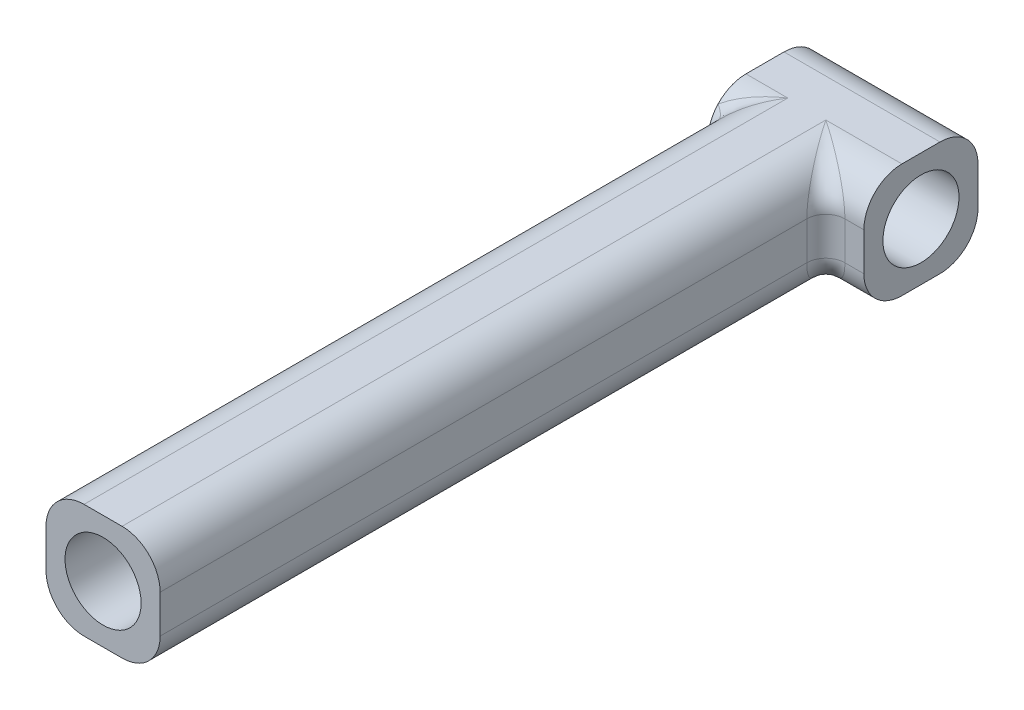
ISO-10303-21;
HEADER;
FILE_DESCRIPTION(('STEP AP214'),'2;1');
FILE_NAME('part.step','',(''),(''),'','','');
FILE_SCHEMA(('AUTOMOTIVE_DESIGN { 1 0 10303 214 1 1 1 1 }'));
ENDSEC;
DATA;
#1=APPLICATION_CONTEXT('core data for automotive mechanical design processes');
#2=APPLICATION_PROTOCOL_DEFINITION('international standard','automotive_design',2000,#1);
#3=PRODUCT_CONTEXT('',#1,'mechanical');
#4=PRODUCT('Part','Part','',(#3));
#5=PRODUCT_RELATED_PRODUCT_CATEGORY('part','',(#4));
#6=PRODUCT_DEFINITION_FORMATION('','',#4);
#7=PRODUCT_DEFINITION_CONTEXT('part definition',#1,'design');
#8=PRODUCT_DEFINITION('design','',#6,#7);
#9=PRODUCT_DEFINITION_SHAPE('','',#8);
#10=(LENGTH_UNIT() NAMED_UNIT(*) SI_UNIT(.MILLI.,.METRE.));
#11=(NAMED_UNIT(*) PLANE_ANGLE_UNIT() SI_UNIT($,.RADIAN.));
#12=(NAMED_UNIT(*) SI_UNIT($,.STERADIAN.) SOLID_ANGLE_UNIT());
#13=UNCERTAINTY_MEASURE_WITH_UNIT(LENGTH_MEASURE(1.E-05),#10,'distance_accuracy_value','');
#14=(GEOMETRIC_REPRESENTATION_CONTEXT(3) GLOBAL_UNCERTAINTY_ASSIGNED_CONTEXT((#13)) GLOBAL_UNIT_ASSIGNED_CONTEXT((#10,
#11,#12)) REPRESENTATION_CONTEXT('',''));
#15=CARTESIAN_POINT('',(0.,0.,0.));
#16=DIRECTION('',(0.,0.,1.));
#17=DIRECTION('',(1.,0.,0.));
#18=AXIS2_PLACEMENT_3D('',#15,#16,#17);
#19=CARTESIAN_POINT('',(-3.175,3.175,60.325));
#20=DIRECTION('',(0.,0.,-1.));
#21=DIRECTION('',(-1.,0.,0.));
#22=AXIS2_PLACEMENT_3D('',#19,#20,#21);
#23=CYLINDRICAL_SURFACE('',#22,6.35);
#24=DIRECTION('',(0.,0.,-1.));
#25=VECTOR('',#24,1.);
#26=CARTESIAN_POINT('',(-3.175,9.525,60.325));
#27=LINE('',#26,#25);
#28=CARTESIAN_POINT('',(-3.175,9.525,60.325));
#29=VERTEX_POINT('',#28);
#30=CARTESIAN_POINT('',(-3.175,9.525,-57.15));
#31=VERTEX_POINT('',#30);
#32=EDGE_CURVE('E278',#29,#31,#27,.T.);
#33=ORIENTED_EDGE('',*,*,#32,.T.);
#34=CARTESIAN_POINT('',(-3.175,3.17500000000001,-57.15));
#35=DIRECTION('',(-0.832050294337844,0.,-0.554700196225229));
#36=DIRECTION('',(0.554700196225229,0.,-0.832050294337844));
#37=AXIS2_PLACEMENT_3D('',#34,#35,#36);
#38=ELLIPSE('',#37,11.4476252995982,6.35);
#39=CARTESIAN_POINT('',(-7.83166666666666,7.4921698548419,-50.165));
#40=VERTEX_POINT('',#39);
#41=EDGE_CURVE('E55',#31,#40,#38,.F.);
#42=ORIENTED_EDGE('',*,*,#41,.T.);
#43=CARTESIAN_POINT('',(-7.29424979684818,8.00762672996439,-51.1327473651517));
#44=CARTESIAN_POINT('',(-8.45959802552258,7.01430348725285,-52.5320924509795));
#45=CARTESIAN_POINT('',(-10.16,8.06099638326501,-53.0941968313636));
#46=CARTESIAN_POINT('',(-7.33649706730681,7.97161377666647,-51.0416196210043));
#47=CARTESIAN_POINT('',(-8.46579769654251,6.99145541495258,-52.4625079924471));
#48=CARTESIAN_POINT('',(-10.16,8.01595011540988,-53.0399379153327));
#49=CARTESIAN_POINT('',(-7.37960669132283,7.93391221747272,-50.9529388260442));
#50=CARTESIAN_POINT('',(-8.47266347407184,6.96774692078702,-52.3941153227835));
#51=CARTESIAN_POINT('',(-10.16,7.97036519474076,-52.9868528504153));
#52=CARTESIAN_POINT('',(-7.46721410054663,7.85505151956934,-50.7807447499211));
#53=CARTESIAN_POINT('',(-8.48777909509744,6.91862622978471,-52.259919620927));
#54=CARTESIAN_POINT('',(-10.16,7.87804928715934,-52.8828374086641));
#55=CARTESIAN_POINT('',(-7.51171177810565,7.81389264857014,-50.6972310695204));
#56=CARTESIAN_POINT('',(-8.49602385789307,6.89322066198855,-52.1941090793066));
#57=CARTESIAN_POINT('',(-10.16,7.83131838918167,-52.8319068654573));
#58=CARTESIAN_POINT('',(-7.64684377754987,7.68505161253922,-50.4547378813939));
#59=CARTESIAN_POINT('',(-8.52289080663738,6.81448360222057,-52.0007493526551));
#60=CARTESIAN_POINT('',(-10.16,7.68923879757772,-52.681988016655));
#61=CARTESIAN_POINT('',(-7.73906790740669,7.59204608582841,-50.3039112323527));
#62=CARTESIAN_POINT('',(-8.54369899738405,6.75842898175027,-51.8766463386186));
#63=CARTESIAN_POINT('',(-10.16,7.5920546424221,-52.5859341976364));
#64=CARTESIAN_POINT('',(-7.89370332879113,7.42525764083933,-50.0719362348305));
#65=CARTESIAN_POINT('',(-8.58363952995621,6.65823356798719,-51.6778728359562));
#66=CARTESIAN_POINT('',(-10.16,7.42525190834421,-52.4312952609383));
#67=CARTESIAN_POINT('',(-7.95590813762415,7.35526161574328,-49.9842205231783));
#68=CARTESIAN_POINT('',(-8.60100467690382,6.61638040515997,-51.6005614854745));
#69=CARTESIAN_POINT('',(-10.16,7.35712182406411,-52.3708069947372));
#70=CARTESIAN_POINT('',(-8.07971552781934,7.20928001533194,-49.819618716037));
#71=CARTESIAN_POINT('',(-8.63855275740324,6.52873494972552,-51.4505629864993));
#72=CARTESIAN_POINT('',(-10.16,7.21804248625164,-52.2525886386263));
#73=CARTESIAN_POINT('',(-8.14131803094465,7.13329367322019,-49.7427340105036));
#74=CARTESIAN_POINT('',(-8.65871620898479,6.48297501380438,-51.3778746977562));
#75=CARTESIAN_POINT('',(-10.16,7.14709287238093,-52.194858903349));
#76=CARTESIAN_POINT('',(-8.26288456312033,6.97576620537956,-49.5999423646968));
#77=CARTESIAN_POINT('',(-8.70177101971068,6.38703783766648,-51.2373170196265));
#78=CARTESIAN_POINT('',(-10.16,7.00208879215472,-52.0820295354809));
#79=CARTESIAN_POINT('',(-8.32284982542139,6.89422943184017,-49.5340269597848));
#80=CARTESIAN_POINT('',(-8.72463866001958,6.33690327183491,-51.169440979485));
#81=CARTESIAN_POINT('',(-10.16,6.92803677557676,-52.0269278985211));
#82=CARTESIAN_POINT('',(-8.44032491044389,6.72596945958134,-49.4129039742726));
#83=CARTESIAN_POINT('',(-8.77289350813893,6.23157091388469,-51.038601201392));
#84=CARTESIAN_POINT('',(-10.16,6.77634258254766,-51.9191789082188));
#85=CARTESIAN_POINT('',(-8.49783385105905,6.63924442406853,-49.3577002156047));
#86=CARTESIAN_POINT('',(-8.79826016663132,6.17641567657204,-50.9756312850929));
#87=CARTESIAN_POINT('',(-10.16,6.69869913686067,-51.8665324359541));
#88=CARTESIAN_POINT('',(-8.60972796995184,6.46093066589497,-49.2575244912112));
#89=CARTESIAN_POINT('',(-8.85115538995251,6.06031627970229,-50.8547210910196));
#90=CARTESIAN_POINT('',(-10.16,6.53921923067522,-51.7635762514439));
#91=CARTESIAN_POINT('',(-8.66410457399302,6.36932980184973,-49.2125796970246));
#92=CARTESIAN_POINT('',(-8.8786707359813,5.9994045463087,-50.7967784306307));
#93=CARTESIAN_POINT('',(-10.16,6.45737232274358,-51.7132730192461));
#94=CARTESIAN_POINT('',(-8.76891387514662,6.18201699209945,-49.1325099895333));
#95=CARTESIAN_POINT('',(-8.9351984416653,5.87136947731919,-50.6863660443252));
#96=CARTESIAN_POINT('',(-10.16,6.28921862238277,-51.6152355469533));
#97=CARTESIAN_POINT('',(-8.81934506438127,6.08630349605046,-49.0973888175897));
#98=CARTESIAN_POINT('',(-8.96419766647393,5.80429183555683,-50.6338745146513));
#99=CARTESIAN_POINT('',(-10.16,6.20291014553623,-51.5675022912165));
#100=CARTESIAN_POINT('',(-8.91572707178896,5.89131877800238,-49.0361921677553));
#101=CARTESIAN_POINT('',(-9.02291423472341,5.66350377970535,-50.5346237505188));
#102=CARTESIAN_POINT('',(-10.16,6.02538895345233,-51.4748070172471));
#103=CARTESIAN_POINT('',(-8.9616746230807,5.7920450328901,-49.0101232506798));
#104=CARTESIAN_POINT('',(-9.05262645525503,5.58983202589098,-50.4878358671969));
#105=CARTESIAN_POINT('',(-10.16,5.93417273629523,-51.4298470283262));
#106=CARTESIAN_POINT('',(-9.04863325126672,5.59057061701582,-48.9660937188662));
#107=CARTESIAN_POINT('',(-9.11182601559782,5.43568998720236,-50.4002446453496));
#108=CARTESIAN_POINT('',(-10.16,5.74652098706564,-51.3430672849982));
#109=CARTESIAN_POINT('',(-9.08964317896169,5.48836927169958,-48.9481349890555));
#110=CARTESIAN_POINT('',(-9.14131752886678,5.3552515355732,-50.3594024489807));
#111=CARTESIAN_POINT('',(-10.16,5.65008424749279,-51.301248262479));
#112=CARTESIAN_POINT('',(-9.18455040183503,5.23270707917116,-48.9123579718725));
#113=CARTESIAN_POINT('',(-9.21262578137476,5.14819363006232,-50.2661109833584));
#114=CARTESIAN_POINT('',(-10.16,5.40479603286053,-51.2022835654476));
#115=CARTESIAN_POINT('',(-9.23538027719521,5.07784492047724,-48.898616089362));
#116=CARTESIAN_POINT('',(-9.25386439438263,5.01734184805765,-50.2169877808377));
#117=CARTESIAN_POINT('',(-10.16,5.2527101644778,-51.1472333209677));
#118=CARTESIAN_POINT('',(-9.32503186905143,4.76440868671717,-48.881917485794));
#119=CARTESIAN_POINT('',(-9.33035877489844,4.74168946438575,-50.1320127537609));
#120=CARTESIAN_POINT('',(-10.16,4.93612034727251,-51.0468433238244));
#121=CARTESIAN_POINT('',(-9.36384697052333,4.60583261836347,-48.8789666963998));
#122=CARTESIAN_POINT('',(-9.36570018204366,4.59682971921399,-50.0960192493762));
#123=CARTESIAN_POINT('',(-10.16,4.77160961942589,-51.0015089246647));
#124=CARTESIAN_POINT('',(-9.42922656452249,4.28580487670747,-48.8787959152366));
#125=CARTESIAN_POINT('',(-9.42733587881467,4.29499146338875,-50.0366050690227));
#126=CARTESIAN_POINT('',(-10.16,4.43056648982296,-50.9229065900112));
#127=CARTESIAN_POINT('',(-9.45576190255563,4.12434729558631,-48.8815894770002));
#128=CARTESIAN_POINT('',(-9.45371815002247,4.13779374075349,-50.0130851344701));
#129=CARTESIAN_POINT('',(-10.16,4.25400660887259,-50.8896674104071));
#130=CARTESIAN_POINT('',(-9.49628917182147,3.79991720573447,-48.8878150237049));
#131=CARTESIAN_POINT('',(-9.49474166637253,3.81520708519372,-49.9777312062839));
#132=CARTESIAN_POINT('',(-10.16,3.89195749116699,-50.8379615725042));
#133=CARTESIAN_POINT('',(-9.51028436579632,3.63694510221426,-48.891246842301));
#134=CARTESIAN_POINT('',(-9.50948016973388,3.64948799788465,-49.9658066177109));
#135=CARTESIAN_POINT('',(-10.16,3.70647059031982,-50.8194910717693));
#136=CARTESIAN_POINT('',(-9.52589085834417,3.30549229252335,-48.8951508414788));
#137=CARTESIAN_POINT('',(-9.52590238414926,3.30991222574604,-49.9525642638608));
#138=CARTESIAN_POINT('',(-10.16,3.32597499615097,-50.7988570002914));
#139=CARTESIAN_POINT('',(-9.5271184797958,3.13699286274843,-48.8955312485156));
#140=CARTESIAN_POINT('',(-9.52722774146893,3.13548372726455,-49.9515377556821));
#141=CARTESIAN_POINT('',(-10.16,3.13084753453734,-50.7971986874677));
#142=CARTESIAN_POINT('',(-9.51617716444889,2.80039874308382,-48.8926920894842));
#143=CARTESIAN_POINT('',(-9.51567145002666,2.78971719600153,-49.9607974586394));
#144=CARTESIAN_POINT('',(-10.16,2.74345114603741,-50.8117135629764));
#145=CARTESIAN_POINT('',(-9.50400584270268,2.63230413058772,-48.8894718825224));
#146=CARTESIAN_POINT('',(-9.50275447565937,2.61789272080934,-49.9711118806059));
#147=CARTESIAN_POINT('',(-10.16,2.55118273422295,-50.8278899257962));
#148=CARTESIAN_POINT('',(-9.47578081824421,2.38144008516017,-48.8845749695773));
#149=CARTESIAN_POINT('',(-9.47397820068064,2.36706695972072,-49.995570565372));
#150=CARTESIAN_POINT('',(-10.16,2.2695423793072,-50.8641696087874));
#151=CARTESIAN_POINT('',(-9.46472020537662,2.29807850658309,-48.8829325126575));
#152=CARTESIAN_POINT('',(-9.46279727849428,2.28446270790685,-50.005240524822));
#153=CARTESIAN_POINT('',(-10.16,2.17683983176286,-50.8782540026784));
#154=CARTESIAN_POINT('',(-9.4392966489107,2.13185357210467,-48.8802996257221));
#155=CARTESIAN_POINT('',(-9.43761154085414,2.12188150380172,-50.0277231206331));
#156=CARTESIAN_POINT('',(-10.16,1.99408530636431,-50.9100861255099));
#157=CARTESIAN_POINT('',(-9.42493384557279,2.04899019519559,-48.8793091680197));
#158=CARTESIAN_POINT('',(-9.42359278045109,2.04186598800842,-50.0405497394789));
#159=CARTESIAN_POINT('',(-10.16,1.90403321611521,-50.9278336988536));
#160=CARTESIAN_POINT('',(-9.39292831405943,1.88390137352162,-48.878670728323));
#161=CARTESIAN_POINT('',(-9.39308586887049,1.88492145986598,-50.0694728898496));
#162=CARTESIAN_POINT('',(-10.16,1.7269382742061,-50.9666480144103));
#163=CARTESIAN_POINT('',(-9.37528580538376,1.80167588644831,-48.879022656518));
#164=CARTESIAN_POINT('',(-9.37658303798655,1.80796386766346,-50.0855860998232));
#165=CARTESIAN_POINT('',(-10.16,1.63989522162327,-50.9877145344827));
#166=CARTESIAN_POINT('',(-9.33675162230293,1.63799240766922,-48.8817716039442));
#167=CARTESIAN_POINT('',(-9.34150824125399,1.6574162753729,-50.121185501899));
#168=CARTESIAN_POINT('',(-10.16,1.46896201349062,-51.0328313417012));
#169=CARTESIAN_POINT('',(-9.31585942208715,1.55653454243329,-48.8841689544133));
#170=CARTESIAN_POINT('',(-9.32292168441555,1.58380849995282,-50.1406911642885));
#171=CARTESIAN_POINT('',(-10.16,1.385072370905,-51.0568821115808));
#172=CARTESIAN_POINT('',(-9.29336093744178,1.47554142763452,-48.8879405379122));
#173=CARTESIAN_POINT('',(-9.30354547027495,1.51220760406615,-50.1618943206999));
#174=CARTESIAN_POINT('',(-10.16,1.30284856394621,-51.0822533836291));
#175=(BOUNDED_SURFACE() B_SPLINE_SURFACE(3,2,((#43,#44,#45),(#46,#47,#48),(#49,#50,#51),(#52,
#53,#54),(#55,#56,#57),(#58,#59,#60),(#61,#62,#63),(#64,#65,#66),(#67,#68,#69),(#70,#71,#72),
(#73,#74,#75),(#76,#77,#78),(#79,#80,#81),(#82,#83,#84),(#85,#86,#87),(#88,#89,#90),(#91,#92,
#93),(#94,#95,#96),(#97,#98,#99),(#100,#101,#102),(#103,#104,#105),(#106,#107,#108),(#109,#110,
#111),(#112,#113,#114),(#115,#116,#117),(#118,#119,#120),(#121,#122,#123),(#124,#125,#126),
(#127,#128,#129),(#130,#131,#132),(#133,#134,#135),(#136,#137,#138),(#139,#140,#141),(#142,#143,
#144),(#145,#146,#147),(#148,#149,#150),(#151,#152,#153),(#154,#155,#156),(#157,#158,#159),
(#160,#161,#162),(#163,#164,#165),(#166,#167,#168),(#169,#170,#171),(#172,#173,#174)),
.UNSPECIFIED.,.F.,.F.,.F.) B_SPLINE_SURFACE_WITH_KNOTS((4,2,2,2,2,2,2,2,2,2,2,2,2,2,2,2,2,2,2,2,
2,4),(3,3),(0.,0.370201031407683,0.740373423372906,1.48114228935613,1.97742137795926,
2.47376409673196,2.96972201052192,3.46585655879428,3.96329028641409,4.46091320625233,
4.95889603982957,5.45699455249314,6.19046344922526,6.92433545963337,7.65994099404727,
8.39535508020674,9.15280737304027,9.91039451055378,10.2887602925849,10.6671100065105,
11.0454344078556,11.4238200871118),(0.,1.),
.UNSPECIFIED.) GEOMETRIC_REPRESENTATION_ITEM() RATIONAL_B_SPLINE_SURFACE(((1.,0.837165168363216,
1.),(1.,0.838624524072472,1.),(1.,0.840080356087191,1.),(1.,0.843002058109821,1.),(1.,
0.844467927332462,1.),(1.,0.84890824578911,1.),(1.,0.85192377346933,1.),(1.,0.857145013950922,
1.),(1.,0.859289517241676,1.),(1.,0.863705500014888,1.),(1.,0.86597699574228,1.),(1.,
0.870656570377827,1.),(1.,0.873064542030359,1.),(1.,0.87801564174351,1.),(1.,0.880558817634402,
1.),(1.,0.88576531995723,1.),(1.,0.888428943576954,1.),(1.,0.89383328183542,1.),(1.,
0.896574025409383,1.),(1.,0.902080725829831,1.),(1.,0.904846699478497,1.),(1.,0.910336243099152,
1.),(1.,0.913059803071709,1.),(1.,0.919648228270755,1.),(1.,0.923444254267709,1.),(1.,
0.930510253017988,1.),(1.,0.933779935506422,1.),(1.,0.939514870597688,1.),(1.,0.941978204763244,
1.),(1.,0.945829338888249,1.),(1.,0.947217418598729,1.),(1.,0.948768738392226,1.),(1.,
0.948894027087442,1.),(1.,0.947801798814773,1.),(1.,0.946584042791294,1.),(1.,0.943876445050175,
1.),(1.,0.942827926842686,1.),(1.,0.940470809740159,1.),(1.,0.93916222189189,1.),(1.,
0.936320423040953,1.),(1.,0.934787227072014,1.),(1.,0.931534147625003,1.),(1.,0.929814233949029,
1.),(1.,0.928020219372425,1.))) REPRESENTATION_ITEM('') SURFACE());
#176=CARTESIAN_POINT('',(-7.29424979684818,8.00762672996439,-51.1327473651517));
#177=CARTESIAN_POINT('',(-7.33649706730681,7.97161377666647,-51.0416196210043));
#178=CARTESIAN_POINT('',(-7.37960669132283,7.93391221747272,-50.9529388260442));
#179=CARTESIAN_POINT('',(-7.46721410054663,7.85505151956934,-50.7807447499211));
#180=CARTESIAN_POINT('',(-7.51171177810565,7.81389264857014,-50.6972310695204));
#181=CARTESIAN_POINT('',(-7.64684377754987,7.68505161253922,-50.4547378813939));
#182=CARTESIAN_POINT('',(-7.73906790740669,7.59204608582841,-50.3039112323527));
#183=CARTESIAN_POINT('',(-7.89370332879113,7.42525764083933,-50.0719362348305));
#184=CARTESIAN_POINT('',(-7.95590813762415,7.35526161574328,-49.9842205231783));
#185=CARTESIAN_POINT('',(-8.07971552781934,7.20928001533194,-49.819618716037));
#186=CARTESIAN_POINT('',(-8.14131803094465,7.13329367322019,-49.7427340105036));
#187=CARTESIAN_POINT('',(-8.26288456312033,6.97576620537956,-49.5999423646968));
#188=CARTESIAN_POINT('',(-8.32284982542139,6.89422943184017,-49.5340269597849));
#189=CARTESIAN_POINT('',(-8.44032491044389,6.72596945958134,-49.4129039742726));
#190=CARTESIAN_POINT('',(-8.49783385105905,6.63924442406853,-49.3577002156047));
#191=CARTESIAN_POINT('',(-8.60972796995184,6.46093066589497,-49.2575244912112));
#192=CARTESIAN_POINT('',(-8.66410457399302,6.36932980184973,-49.2125796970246));
#193=CARTESIAN_POINT('',(-8.76891387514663,6.18201699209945,-49.1325099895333));
#194=CARTESIAN_POINT('',(-8.81934506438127,6.08630349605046,-49.0973888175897));
#195=CARTESIAN_POINT('',(-8.91572707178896,5.89131877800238,-49.0361921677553));
#196=CARTESIAN_POINT('',(-8.9616746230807,5.7920450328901,-49.0101232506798));
#197=CARTESIAN_POINT('',(-9.04863325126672,5.59057061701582,-48.9660937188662));
#198=CARTESIAN_POINT('',(-9.08964317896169,5.48836927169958,-48.9481349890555));
#199=CARTESIAN_POINT('',(-9.18455040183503,5.23270707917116,-48.9123579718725));
#200=CARTESIAN_POINT('',(-9.23538027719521,5.07784492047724,-48.898616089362));
#201=CARTESIAN_POINT('',(-9.32503186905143,4.76440868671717,-48.881917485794));
#202=CARTESIAN_POINT('',(-9.36384697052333,4.60583261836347,-48.8789666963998));
#203=CARTESIAN_POINT('',(-9.42922656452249,4.28580487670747,-48.8787959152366));
#204=CARTESIAN_POINT('',(-9.45576190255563,4.12434729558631,-48.8815894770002));
#205=CARTESIAN_POINT('',(-9.49628917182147,3.79991720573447,-48.8878150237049));
#206=CARTESIAN_POINT('',(-9.51028436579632,3.63694510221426,-48.891246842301));
#207=CARTESIAN_POINT('',(-9.52589085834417,3.30549229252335,-48.8951508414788));
#208=CARTESIAN_POINT('',(-9.5271184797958,3.13699286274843,-48.8955312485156));
#209=CARTESIAN_POINT('',(-9.51617716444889,2.80039874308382,-48.8926920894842));
#210=CARTESIAN_POINT('',(-9.50400584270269,2.63230413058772,-48.8894718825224));
#211=CARTESIAN_POINT('',(-9.47578081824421,2.38144008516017,-48.8845749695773));
#212=CARTESIAN_POINT('',(-9.46472020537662,2.29807850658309,-48.8829325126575));
#213=CARTESIAN_POINT('',(-9.4392966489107,2.13185357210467,-48.8802996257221));
#214=CARTESIAN_POINT('',(-9.42493384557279,2.04899019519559,-48.8793091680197));
#215=CARTESIAN_POINT('',(-9.39292831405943,1.88390137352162,-48.878670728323));
#216=CARTESIAN_POINT('',(-9.37528580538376,1.80167588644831,-48.879022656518));
#217=CARTESIAN_POINT('',(-9.33675162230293,1.63799240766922,-48.8817716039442));
#218=CARTESIAN_POINT('',(-9.31585942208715,1.55653454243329,-48.8841689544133));
#219=CARTESIAN_POINT('',(-9.29336093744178,1.47554142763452,-48.8879405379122));
#220=B_SPLINE_CURVE_WITH_KNOTS('',3,(#176,#177,#178,#179,#180,#181,#182,#183,#184,#185,#186,
#187,#188,#189,#190,#191,#192,#193,#194,#195,#196,#197,#198,#199,#200,#201,#202,#203,#204,#205,
#206,#207,#208,#209,#210,#211,#212,#213,#214,#215,#216,#217,#218,#219),.UNSPECIFIED.,.F.,.F.,(4,
2,2,2,2,2,2,2,2,2,2,2,2,2,2,2,2,2,2,2,2,4),(0.,0.370201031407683,0.740373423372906,
1.48114228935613,1.97742137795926,2.47376409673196,2.96972201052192,3.46585655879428,
3.96329028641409,4.46091320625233,4.95889603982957,5.45699455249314,6.19046344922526,
6.92433545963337,7.65994099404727,8.39535508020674,9.15280737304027,9.91039451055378,
10.2887602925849,10.6671100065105,11.0454344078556,11.4238200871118),.UNSPECIFIED.);
#221=CARTESIAN_POINT('',(-9.525,3.175,-48.895));
#222=VERTEX_POINT('',#221);
#223=EDGE_CURVE('E60',#40,#222,#220,.T.);
#224=ORIENTED_EDGE('',*,*,#223,.T.);
#225=DIRECTION('',(0.,0.,-1.));
#226=VECTOR('',#225,1.);
#227=CARTESIAN_POINT('',(-9.525,3.175,60.325));
#228=LINE('',#227,#226);
#229=CARTESIAN_POINT('',(-9.525,3.175,60.325));
#230=VERTEX_POINT('',#229);
#231=EDGE_CURVE('E279',#230,#222,#228,.T.);
#232=ORIENTED_EDGE('',*,*,#231,.F.);
#233=CARTESIAN_POINT('',(-3.175,3.175,60.325));
#234=DIRECTION('',(0.,0.,-1.));
#235=DIRECTION('',(-1.,0.,0.));
#236=AXIS2_PLACEMENT_3D('',#233,#234,#235);
#237=CIRCLE('',#236,6.35);
#238=EDGE_CURVE('E243',#230,#29,#237,.T.);
#239=ORIENTED_EDGE('',*,*,#238,.T.);
#240=EDGE_LOOP('',(#33,#42,#224,#232,#239));
#241=FACE_BOUND('',#240,.T.);
#242=ADVANCED_FACE('F34',(#241),#23,.T.);
#243=CARTESIAN_POINT('',(-9.525,-3.175,60.325));
#244=DIRECTION('',(-1.,0.,0.));
#245=DIRECTION('',(0.,0.,1.));
#246=AXIS2_PLACEMENT_3D('',#243,#244,#245);
#247=PLANE('',#246);
#248=ORIENTED_EDGE('',*,*,#231,.T.);
#249=DIRECTION('',(0.,1.,0.));
#250=VECTOR('',#249,1.);
#251=CARTESIAN_POINT('',(-9.525,3.17500000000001,-48.8950000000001));
#252=LINE('',#251,#250);
#253=CARTESIAN_POINT('',(-9.525,-3.175,-48.895));
#254=VERTEX_POINT('',#253);
#255=EDGE_CURVE('E447',#222,#254,#252,.F.);
#256=ORIENTED_EDGE('',*,*,#255,.T.);
#257=DIRECTION('',(0.,0.,-1.));
#258=VECTOR('',#257,1.);
#259=CARTESIAN_POINT('',(-9.525,-3.175,60.325));
#260=LINE('',#259,#258);
#261=CARTESIAN_POINT('',(-9.525,-3.175,60.325));
#262=VERTEX_POINT('',#261);
#263=EDGE_CURVE('E282',#262,#254,#260,.T.);
#264=ORIENTED_EDGE('',*,*,#263,.F.);
#265=DIRECTION('',(0.,1.,0.));
#266=VECTOR('',#265,1.);
#267=CARTESIAN_POINT('',(-9.525,-3.175,60.325));
#268=LINE('',#267,#266);
#269=EDGE_CURVE('E275',#262,#230,#268,.T.);
#270=ORIENTED_EDGE('',*,*,#269,.T.);
#271=EDGE_LOOP('',(#248,#256,#264,#270));
#272=FACE_BOUND('',#271,.T.);
#273=ADVANCED_FACE('F331',(#272),#247,.T.);
#274=CARTESIAN_POINT('',(-3.175,-3.175,60.325));
#275=DIRECTION('',(0.,0.,-1.));
#276=DIRECTION('',(-1.,0.,0.));
#277=AXIS2_PLACEMENT_3D('',#274,#275,#276);
#278=CYLINDRICAL_SURFACE('',#277,6.35);
#279=ORIENTED_EDGE('',*,*,#263,.T.);
#280=CARTESIAN_POINT('',(-10.16,-8.06099637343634,-53.0941968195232));
#281=CARTESIAN_POINT('',(-8.45959802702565,-7.01430348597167,-52.5320924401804));
#282=CARTESIAN_POINT('',(-7.29424979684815,-8.00762672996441,-51.1327473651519));
#283=CARTESIAN_POINT('',(-10.16,-8.01595011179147,-53.039937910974));
#284=CARTESIAN_POINT('',(-8.4657976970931,-6.9914554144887,-52.4625079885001));
#285=CARTESIAN_POINT('',(-7.33649706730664,-7.97161377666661,-51.0416196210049));
#286=CARTESIAN_POINT('',(-10.16,-7.97036519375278,-52.9868528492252));
#287=CARTESIAN_POINT('',(-8.47266347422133,-6.96774692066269,-52.3941153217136));
#288=CARTESIAN_POINT('',(-7.3796066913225,-7.93391221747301,-50.952938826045));
#289=CARTESIAN_POINT('',(-10.16,-7.87804928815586,-52.882837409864));
#290=CARTESIAN_POINT('',(-8.48777909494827,-6.91862622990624,-52.2599196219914));
#291=CARTESIAN_POINT('',(-7.46721410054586,-7.85505151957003,-50.7807447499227));
#292=CARTESIAN_POINT('',(-10.16,-7.83131838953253,-52.8319068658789));
#293=CARTESIAN_POINT('',(-8.49602385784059,-6.89322066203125,-52.1941090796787));
#294=CARTESIAN_POINT('',(-7.5117117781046,-7.81389264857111,-50.6972310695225));
#295=CARTESIAN_POINT('',(-10.16,-7.68923879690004,-52.6819880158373));
#296=CARTESIAN_POINT('',(-8.52289080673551,-6.81448360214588,-52.0007493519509));
#297=CARTESIAN_POINT('',(-7.64684377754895,-7.68505161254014,-50.4547378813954));
#298=CARTESIAN_POINT('',(-10.16,-7.59205464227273,-52.5859341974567));
#299=CARTESIAN_POINT('',(-8.54369899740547,-6.75842898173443,-51.8766463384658));
#300=CARTESIAN_POINT('',(-7.73906790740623,-7.5920460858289,-50.3039112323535));
#301=CARTESIAN_POINT('',(-10.16,-7.42525190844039,-52.4312952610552));
#302=CARTESIAN_POINT('',(-8.58363952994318,-6.65823356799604,-51.6778728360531));
#303=CARTESIAN_POINT('',(-7.89370332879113,-7.42525764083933,-50.0719362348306));
#304=CARTESIAN_POINT('',(-10.16,-7.35712182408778,-52.3708069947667));
#305=CARTESIAN_POINT('',(-8.60100467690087,-6.61638040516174,-51.6005614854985));
#306=CARTESIAN_POINT('',(-7.95590813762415,-7.35526161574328,-49.9842205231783));
#307=CARTESIAN_POINT('',(-10.16,-7.21804248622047,-52.2525886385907));
#308=CARTESIAN_POINT('',(-8.63855275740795,-6.52873494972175,-51.4505629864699));
#309=CARTESIAN_POINT('',(-8.07971552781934,-7.20928001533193,-49.8196187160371));
#310=CARTESIAN_POINT('',(-10.16,-7.14709287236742,-52.1948589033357));
#311=CARTESIAN_POINT('',(-8.65871620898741,-6.48297501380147,-51.3778746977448));
#312=CARTESIAN_POINT('',(-8.14131803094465,-7.13329367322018,-49.7427340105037));
#313=CARTESIAN_POINT('',(-10.16,-7.00208879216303,-52.0820295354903));
#314=CARTESIAN_POINT('',(-8.70177101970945,-6.38703783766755,-51.237317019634));
#315=CARTESIAN_POINT('',(-8.26288456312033,-6.97576620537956,-49.5999423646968));
#316=CARTESIAN_POINT('',(-10.16,-6.92803677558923,-52.0269278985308));
#317=CARTESIAN_POINT('',(-8.72463866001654,-6.33690327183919,-51.1694409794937));
#318=CARTESIAN_POINT('',(-8.32284982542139,-6.89422943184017,-49.5340269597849));
#319=CARTESIAN_POINT('',(-10.16,-6.77634258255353,-51.9191789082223));
#320=CARTESIAN_POINT('',(-8.77289350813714,-6.23157091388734,-51.0386012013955));
#321=CARTESIAN_POINT('',(-8.4403249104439,-6.72596945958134,-49.4129039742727));
#322=CARTESIAN_POINT('',(-10.16,-6.69869913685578,-51.866532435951));
#323=CARTESIAN_POINT('',(-8.79826016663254,-6.17641567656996,-50.9756312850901));
#324=CARTESIAN_POINT('',(-8.49783385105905,-6.63924442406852,-49.3577002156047));
#325=CARTESIAN_POINT('',(-10.16,-6.53921923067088,-51.7635762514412));
#326=CARTESIAN_POINT('',(-8.85115538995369,-6.06031627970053,-50.8547210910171));
#327=CARTESIAN_POINT('',(-8.60972796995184,-6.46093066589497,-49.2575244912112));
#328=CARTESIAN_POINT('',(-10.16,-6.45737232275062,-51.7132730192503));
#329=CARTESIAN_POINT('',(-8.87867073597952,-5.99940454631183,-50.7967784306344));
#330=CARTESIAN_POINT('',(-8.66410457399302,-6.36932980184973,-49.2125796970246));
#331=CARTESIAN_POINT('',(-10.16,-6.2892186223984,-51.6152355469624));
#332=CARTESIAN_POINT('',(-8.93519844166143,-5.87136947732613,-50.6863660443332));
#333=CARTESIAN_POINT('',(-8.76891387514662,-6.18201699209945,-49.1325099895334));
#334=CARTESIAN_POINT('',(-10.16,-6.20291014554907,-51.5675022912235));
#335=CARTESIAN_POINT('',(-8.96419766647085,-5.80429183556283,-50.6338745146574));
#336=CARTESIAN_POINT('',(-8.81934506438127,-6.08630349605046,-49.0973888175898));
#337=CARTESIAN_POINT('',(-10.16,-6.02538895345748,-51.4748070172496));
#338=CARTESIAN_POINT('',(-9.02291423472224,-5.66350377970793,-50.534623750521));
#339=CARTESIAN_POINT('',(-8.91572707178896,-5.89131877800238,-49.0361921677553));
#340=CARTESIAN_POINT('',(-10.16,-5.93417273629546,-51.4298470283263));
#341=CARTESIAN_POINT('',(-9.05262645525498,-5.58983202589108,-50.487835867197));
#342=CARTESIAN_POINT('',(-8.9616746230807,-5.7920450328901,-49.0101232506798));
#343=CARTESIAN_POINT('',(-10.16,-5.74652098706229,-51.3430672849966));
#344=CARTESIAN_POINT('',(-9.11182601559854,-5.43568998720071,-50.4002446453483));
#345=CARTESIAN_POINT('',(-9.04863325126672,-5.59057061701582,-48.9660937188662));
#346=CARTESIAN_POINT('',(-10.16,-5.65008424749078,-51.3012482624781));
#347=CARTESIAN_POINT('',(-9.1413175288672,-5.35525153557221,-50.35940244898));
#348=CARTESIAN_POINT('',(-9.08964317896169,-5.48836927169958,-48.9481349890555));
#349=CARTESIAN_POINT('',(-10.16,-5.40479603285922,-51.2022835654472));
#350=CARTESIAN_POINT('',(-9.21262578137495,-5.14819363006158,-50.2661109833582));
#351=CARTESIAN_POINT('',(-9.18455040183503,-5.23270707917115,-48.9123579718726));
#352=CARTESIAN_POINT('',(-10.16,-5.25271016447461,-51.1472333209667));
#353=CARTESIAN_POINT('',(-9.25386439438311,-5.01734184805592,-50.216987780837));
#354=CARTESIAN_POINT('',(-9.23538027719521,-5.07784492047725,-48.8986160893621));
#355=CARTESIAN_POINT('',(-10.16,-4.93612034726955,-51.0468433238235));
#356=CARTESIAN_POINT('',(-9.33035877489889,-4.74168946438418,-50.1320127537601));
#357=CARTESIAN_POINT('',(-9.32503186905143,-4.76440868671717,-48.881917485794));
#358=CARTESIAN_POINT('',(-10.16,-4.77160961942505,-51.0015089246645));
#359=CARTESIAN_POINT('',(-9.36570018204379,-4.59682971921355,-50.096019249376));
#360=CARTESIAN_POINT('',(-9.36384697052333,-4.60583261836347,-48.8789666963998));
#361=CARTESIAN_POINT('',(-10.16,-4.43056648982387,-50.9229065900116));
#362=CARTESIAN_POINT('',(-9.42733587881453,-4.29499146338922,-50.0366050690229));
#363=CARTESIAN_POINT('',(-9.42922656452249,-4.28580487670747,-48.8787959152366));
#364=CARTESIAN_POINT('',(-10.16,-4.25400660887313,-50.8896674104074));
#365=CARTESIAN_POINT('',(-9.45371815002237,-4.13779374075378,-50.0130851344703));
#366=CARTESIAN_POINT('',(-9.45576190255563,-4.12434729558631,-48.8815894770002));
#367=CARTESIAN_POINT('',(-10.16,-3.89195749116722,-50.8379615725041));
#368=CARTESIAN_POINT('',(-9.49474166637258,-3.81520708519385,-49.9777312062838));
#369=CARTESIAN_POINT('',(-9.49628917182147,-3.79991720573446,-48.8878150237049));
#370=CARTESIAN_POINT('',(-10.16,-3.70647059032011,-50.819491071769));
#371=CARTESIAN_POINT('',(-9.50948016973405,-3.64948799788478,-49.9658066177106));
#372=CARTESIAN_POINT('',(-9.51028436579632,-3.63694510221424,-48.891246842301));
#373=CARTESIAN_POINT('',(-10.16,-3.32597499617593,-50.7988570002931));
#374=CARTESIAN_POINT('',(-9.52590238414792,-3.30991222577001,-49.9525642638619));
#375=CARTESIAN_POINT('',(-9.52589085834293,-3.30549229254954,-48.8951508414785));
#376=CARTESIAN_POINT('',(-10.16,-3.13084753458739,-50.7971986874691));
#377=CARTESIAN_POINT('',(-9.52722774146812,-3.13548372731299,-49.9515377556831));
#378=CARTESIAN_POINT('',(-9.52711847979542,-3.13699286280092,-48.8955312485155));
#379=CARTESIAN_POINT('',(-10.16,-2.74345114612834,-50.8117135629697));
#380=CARTESIAN_POINT('',(-9.5156714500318,-2.78971719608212,-49.9607974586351));
#381=CARTESIAN_POINT('',(-9.51617716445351,-2.80039874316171,-48.8926920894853));
#382=CARTESIAN_POINT('',(-10.16,-2.55118273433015,-50.8278899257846));
#383=CARTESIAN_POINT('',(-9.50275447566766,-2.61789272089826,-49.9711118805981));
#384=CARTESIAN_POINT('',(-9.50400584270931,-2.63230413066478,-48.8894718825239));
#385=CARTESIAN_POINT('',(-10.16,-2.26954237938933,-50.8641696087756));
#386=CARTESIAN_POINT('',(-9.47397820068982,-2.36706695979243,-49.9955705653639));
#387=CARTESIAN_POINT('',(-9.47578081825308,-2.38144008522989,-48.8845749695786));
#388=CARTESIAN_POINT('',(-10.16,-2.1768398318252,-50.8782540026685));
#389=CARTESIAN_POINT('',(-9.46279727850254,-2.28446270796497,-50.0052405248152));
#390=CARTESIAN_POINT('',(-9.46472020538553,-2.29807850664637,-48.8829325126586));
#391=CARTESIAN_POINT('',(-10.16,-1.99408530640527,-50.9100861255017));
#392=CARTESIAN_POINT('',(-9.43761154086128,-2.12188150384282,-50.0277231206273));
#393=CARTESIAN_POINT('',(-9.43929664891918,-2.13185357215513,-48.8802996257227));
#394=CARTESIAN_POINT('',(-10.16,-1.90403321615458,-50.9278336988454));
#395=CARTESIAN_POINT('',(-9.42359278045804,-2.04186598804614,-50.0405497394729));
#396=CARTESIAN_POINT('',(-9.42493384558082,-2.04899019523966,-48.87930916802));
#397=CARTESIAN_POINT('',(-10.16,-1.72693827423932,-50.9666480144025));
#398=CARTESIAN_POINT('',(-9.39308586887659,-1.88492145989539,-50.0694728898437));
#399=CARTESIAN_POINT('',(-9.39292831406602,-1.88390137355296,-48.8786707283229));
#400=CARTESIAN_POINT('',(-10.16,-1.63989522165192,-50.9877145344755));
#401=CARTESIAN_POINT('',(-9.37658303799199,-1.80796386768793,-50.0855860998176));
#402=CARTESIAN_POINT('',(-9.37528580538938,-1.8016758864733,-48.8790226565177));
#403=CARTESIAN_POINT('',(-10.16,-1.46896201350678,-51.0328313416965));
#404=CARTESIAN_POINT('',(-9.3415082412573,-1.65741627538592,-50.1211855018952));
#405=CARTESIAN_POINT('',(-9.33675162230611,-1.63799240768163,-48.8817716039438));
#406=CARTESIAN_POINT('',(-10.16,-1.38507237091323,-51.0568821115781));
#407=CARTESIAN_POINT('',(-9.32292168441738,-1.5838084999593,-50.1406911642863));
#408=CARTESIAN_POINT('',(-9.31585942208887,-1.55653454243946,-48.884168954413));
#409=CARTESIAN_POINT('',(-10.16,-1.30284856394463,-51.0822533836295));
#410=CARTESIAN_POINT('',(-9.30354547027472,-1.5122076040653,-50.1618943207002));
#411=CARTESIAN_POINT('',(-9.29336093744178,-1.47554142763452,-48.8879405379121));
#412=(BOUNDED_SURFACE() B_SPLINE_SURFACE(3,2,((#280,#281,#282),(#283,#284,#285),(#286,#287,
#288),(#289,#290,#291),(#292,#293,#294),(#295,#296,#297),(#298,#299,#300),(#301,#302,#303),
(#304,#305,#306),(#307,#308,#309),(#310,#311,#312),(#313,#314,#315),(#316,#317,#318),(#319,#320,
#321),(#322,#323,#324),(#325,#326,#327),(#328,#329,#330),(#331,#332,#333),(#334,#335,#336),
(#337,#338,#339),(#340,#341,#342),(#343,#344,#345),(#346,#347,#348),(#349,#350,#351),(#352,#353,
#354),(#355,#356,#357),(#358,#359,#360),(#361,#362,#363),(#364,#365,#366),(#367,#368,#369),
(#370,#371,#372),(#373,#374,#375),(#376,#377,#378),(#379,#380,#381),(#382,#383,#384),(#385,#386,
#387),(#388,#389,#390),(#391,#392,#393),(#394,#395,#396),(#397,#398,#399),(#400,#401,#402),
(#403,#404,#405),(#406,#407,#408),(#409,#410,#411)),.UNSPECIFIED.,.F.,.F.,
.F.) B_SPLINE_SURFACE_WITH_KNOTS((4,2,2,2,2,2,2,2,2,2,2,2,2,2,2,2,2,2,2,2,2,4),(3,3),(0.,
0.370201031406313,0.740373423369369,1.48114228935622,1.97742137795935,2.47376409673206,
2.96972201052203,3.46585655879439,3.9632902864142,4.46091320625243,4.95889603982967,
5.45699455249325,6.19046344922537,6.92433545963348,7.6599409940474,8.39535508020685,
9.15280737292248,9.910394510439,10.2887602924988,10.667110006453,11.045434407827,
11.423820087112),(0.,1.),
.UNSPECIFIED.) GEOMETRIC_REPRESENTATION_ITEM() RATIONAL_B_SPLINE_SURFACE(((1.,0.837165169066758,
1.),(1.,0.838624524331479,1.),(1.,0.840080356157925,1.),(1.,0.84300205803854,1.),(1.,
0.844467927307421,1.),(1.,0.848908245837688,1.),(1.,0.851923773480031,1.),(1.,0.857145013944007,
1.),(1.,0.859289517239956,1.),(1.,0.863705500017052,1.),(1.,0.865976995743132,1.),(1.,
0.870656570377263,1.),(1.,0.873064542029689,1.),(1.,0.878015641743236,1.),(1.,0.880558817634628,
1.),(1.,0.885765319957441,1.),(1.,0.888428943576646,1.),(1.,0.893833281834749,1.),(1.,
0.896574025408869,1.),(1.,0.902080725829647,1.),(1.,0.904846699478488,1.),(1.,0.910336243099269,
1.),(1.,0.913059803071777,1.),(1.,0.919648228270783,1.),(1.,0.923444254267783,1.),(1.,
0.930510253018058,1.),(1.,0.933779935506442,1.),(1.,0.939514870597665,1.),(1.,0.941978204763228,
1.),(1.,0.945829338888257,1.),(1.,0.947217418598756,1.),(1.,0.948768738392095,1.),(1.,
0.94889402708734,1.),(1.,0.947801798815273,1.),(1.,0.946584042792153,1.),(1.,0.943876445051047,
1.),(1.,0.942827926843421,1.),(1.,0.94047080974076,1.),(1.,0.939162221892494,1.),(1.,
0.936320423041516,1.),(1.,0.934787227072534,1.),(1.,0.931534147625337,1.),(1.,0.929814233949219,
1.),(1.,0.92802021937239,1.))) REPRESENTATION_ITEM('') SURFACE());
#413=CARTESIAN_POINT('',(-9.29336093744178,-1.47554142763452,-48.8879405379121));
#414=CARTESIAN_POINT('',(-9.31585942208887,-1.55653454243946,-48.884168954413));
#415=CARTESIAN_POINT('',(-9.33675162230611,-1.63799240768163,-48.8817716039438));
#416=CARTESIAN_POINT('',(-9.37528580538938,-1.8016758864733,-48.8790226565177));
#417=CARTESIAN_POINT('',(-9.39292831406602,-1.88390137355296,-48.8786707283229));
#418=CARTESIAN_POINT('',(-9.42493384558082,-2.04899019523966,-48.87930916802));
#419=CARTESIAN_POINT('',(-9.43929664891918,-2.13185357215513,-48.8802996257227));
#420=CARTESIAN_POINT('',(-9.46472020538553,-2.29807850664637,-48.8829325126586));
#421=CARTESIAN_POINT('',(-9.47578081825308,-2.38144008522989,-48.8845749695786));
#422=CARTESIAN_POINT('',(-9.50400584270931,-2.63230413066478,-48.8894718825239));
#423=CARTESIAN_POINT('',(-9.51617716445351,-2.80039874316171,-48.8926920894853));
#424=CARTESIAN_POINT('',(-9.52711847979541,-3.13699286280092,-48.8955312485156));
#425=CARTESIAN_POINT('',(-9.52589085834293,-3.30549229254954,-48.8951508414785));
#426=CARTESIAN_POINT('',(-9.51028436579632,-3.63694510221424,-48.891246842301));
#427=CARTESIAN_POINT('',(-9.49628917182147,-3.79991720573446,-48.8878150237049));
#428=CARTESIAN_POINT('',(-9.45576190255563,-4.12434729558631,-48.8815894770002));
#429=CARTESIAN_POINT('',(-9.42922656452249,-4.28580487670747,-48.8787959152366));
#430=CARTESIAN_POINT('',(-9.36384697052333,-4.60583261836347,-48.8789666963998));
#431=CARTESIAN_POINT('',(-9.32503186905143,-4.76440868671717,-48.881917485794));
#432=CARTESIAN_POINT('',(-9.23538027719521,-5.07784492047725,-48.8986160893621));
#433=CARTESIAN_POINT('',(-9.18455040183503,-5.23270707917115,-48.9123579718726));
#434=CARTESIAN_POINT('',(-9.08964317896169,-5.48836927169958,-48.9481349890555));
#435=CARTESIAN_POINT('',(-9.04863325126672,-5.59057061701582,-48.9660937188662));
#436=CARTESIAN_POINT('',(-8.9616746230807,-5.7920450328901,-49.0101232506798));
#437=CARTESIAN_POINT('',(-8.91572707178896,-5.89131877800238,-49.0361921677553));
#438=CARTESIAN_POINT('',(-8.81934506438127,-6.08630349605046,-49.0973888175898));
#439=CARTESIAN_POINT('',(-8.76891387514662,-6.18201699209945,-49.1325099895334));
#440=CARTESIAN_POINT('',(-8.66410457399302,-6.36932980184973,-49.2125796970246));
#441=CARTESIAN_POINT('',(-8.60972796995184,-6.46093066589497,-49.2575244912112));
#442=CARTESIAN_POINT('',(-8.49783385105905,-6.63924442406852,-49.3577002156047));
#443=CARTESIAN_POINT('',(-8.4403249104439,-6.72596945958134,-49.4129039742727));
#444=CARTESIAN_POINT('',(-8.32284982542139,-6.89422943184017,-49.5340269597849));
#445=CARTESIAN_POINT('',(-8.26288456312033,-6.97576620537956,-49.5999423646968));
#446=CARTESIAN_POINT('',(-8.14131803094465,-7.13329367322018,-49.7427340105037));
#447=CARTESIAN_POINT('',(-8.07971552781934,-7.20928001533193,-49.8196187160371));
#448=CARTESIAN_POINT('',(-7.95590813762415,-7.35526161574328,-49.9842205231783));
#449=CARTESIAN_POINT('',(-7.89370332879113,-7.42525764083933,-50.0719362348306));
#450=CARTESIAN_POINT('',(-7.73906790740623,-7.5920460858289,-50.3039112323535));
#451=CARTESIAN_POINT('',(-7.64684377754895,-7.68505161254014,-50.4547378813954));
#452=CARTESIAN_POINT('',(-7.5117117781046,-7.81389264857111,-50.6972310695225));
#453=CARTESIAN_POINT('',(-7.46721410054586,-7.85505151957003,-50.7807447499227));
#454=CARTESIAN_POINT('',(-7.3796066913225,-7.933912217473,-50.952938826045));
#455=CARTESIAN_POINT('',(-7.33649706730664,-7.97161377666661,-51.0416196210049));
#456=CARTESIAN_POINT('',(-7.29424979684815,-8.00762672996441,-51.1327473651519));
#457=B_SPLINE_CURVE_WITH_KNOTS('',3,(#413,#414,#415,#416,#417,#418,#419,#420,#421,#422,#423,
#424,#425,#426,#427,#428,#429,#430,#431,#432,#433,#434,#435,#436,#437,#438,#439,#440,#441,#442,
#443,#444,#445,#446,#447,#448,#449,#450,#451,#452,#453,#454,#455,#456),.UNSPECIFIED.,.F.,.F.,(4,
2,2,2,2,2,2,2,2,2,2,2,2,2,2,2,2,2,2,2,2,4),(0.,0.378385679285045,0.756710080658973,
1.13505979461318,1.513425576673,2.27101271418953,3.02846500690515,3.76387909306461,
4.49948462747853,5.23335663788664,5.96682553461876,6.46492404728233,6.96290688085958,
7.4605298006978,7.95796352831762,8.45409807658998,8.95005599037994,9.44639870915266,
9.94267779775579,10.6834466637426,11.0536190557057,11.423820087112),.UNSPECIFIED.);
#458=CARTESIAN_POINT('',(-7.83166666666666,-7.49216985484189,-50.1650000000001));
#459=VERTEX_POINT('',#458);
#460=EDGE_CURVE('E313',#254,#459,#457,.T.);
#461=ORIENTED_EDGE('',*,*,#460,.T.);
#462=CARTESIAN_POINT('',(-3.175,-3.17499999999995,-57.15));
#463=DIRECTION('',(-0.832050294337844,0.,-0.554700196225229));
#464=DIRECTION('',(0.554700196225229,0.,-0.832050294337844));
#465=AXIS2_PLACEMENT_3D('',#462,#463,#464);
#466=ELLIPSE('',#465,11.4476252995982,6.35);
#467=CARTESIAN_POINT('',(-3.175,-9.525,-57.15));
#468=VERTEX_POINT('',#467);
#469=EDGE_CURVE('E311',#459,#468,#466,.F.);
#470=ORIENTED_EDGE('',*,*,#469,.T.);
#471=DIRECTION('',(0.,0.,-1.));
#472=VECTOR('',#471,1.);
#473=CARTESIAN_POINT('',(-3.175,-9.525,60.325));
#474=LINE('',#473,#472);
#475=CARTESIAN_POINT('',(-3.175,-9.525,60.325));
#476=VERTEX_POINT('',#475);
#477=EDGE_CURVE('E285',#476,#468,#474,.T.);
#478=ORIENTED_EDGE('',*,*,#477,.F.);
#479=CARTESIAN_POINT('',(-3.175,-3.175,60.325));
#480=DIRECTION('',(0.,0.,-1.));
#481=DIRECTION('',(-1.,0.,0.));
#482=AXIS2_PLACEMENT_3D('',#479,#480,#481);
#483=CIRCLE('',#482,6.35);
#484=EDGE_CURVE('E272',#476,#262,#483,.T.);
#485=ORIENTED_EDGE('',*,*,#484,.T.);
#486=EDGE_LOOP('',(#279,#461,#470,#478,#485));
#487=FACE_BOUND('',#486,.T.);
#488=ADVANCED_FACE('F325',(#487),#278,.T.);
#489=CARTESIAN_POINT('',(-3.175,-9.525,60.325));
#490=DIRECTION('',(0.,1.,0.));
#491=DIRECTION('',(0.,0.,1.));
#492=AXIS2_PLACEMENT_3D('',#489,#490,#491);
#493=PLANE('',#492);
#494=ORIENTED_EDGE('',*,*,#477,.T.);
#495=DIRECTION('',(1.,0.,0.));
#496=VECTOR('',#495,1.);
#497=CARTESIAN_POINT('',(-10.16,-9.52499999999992,-57.15));
#498=LINE('',#497,#496);
#499=CARTESIAN_POINT('',(-10.16,-9.52499999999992,-57.15));
#500=VERTEX_POINT('',#499);
#501=EDGE_CURVE('E248',#500,#468,#498,.T.);
#502=ORIENTED_EDGE('',*,*,#501,.F.);
#503=DIRECTION('',(0.,0.,-1.));
#504=VECTOR('',#503,1.);
#505=CARTESIAN_POINT('',(-10.16,-9.52499999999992,-57.15));
#506=LINE('',#505,#504);
#507=CARTESIAN_POINT('',(-10.16,-9.52499999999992,-63.5));
#508=VERTEX_POINT('',#507);
#509=EDGE_CURVE('E233',#500,#508,#506,.T.);
#510=ORIENTED_EDGE('',*,*,#509,.T.);
#511=DIRECTION('',(1.,0.,0.));
#512=VECTOR('',#511,1.);
#513=CARTESIAN_POINT('',(-10.16,-9.52499999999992,-63.5));
#514=LINE('',#513,#512);
#515=CARTESIAN_POINT('',(15.875,-9.52499999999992,-63.5));
#516=VERTEX_POINT('',#515);
#517=EDGE_CURVE('E246',#508,#516,#514,.T.);
#518=ORIENTED_EDGE('',*,*,#517,.T.);
#519=DIRECTION('',(0.,0.,-1.));
#520=VECTOR('',#519,1.);
#521=CARTESIAN_POINT('',(15.875,-9.52499999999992,-57.15));
#522=LINE('',#521,#520);
#523=CARTESIAN_POINT('',(15.875,-9.52499999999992,-57.15));
#524=VERTEX_POINT('',#523);
#525=EDGE_CURVE('E213',#524,#516,#522,.T.);
#526=ORIENTED_EDGE('',*,*,#525,.F.);
#527=CARTESIAN_POINT('',(3.175,-9.525,-57.15));
#528=VERTEX_POINT('',#527);
#529=EDGE_CURVE('E251',#528,#524,#498,.T.);
#530=ORIENTED_EDGE('',*,*,#529,.F.);
#531=DIRECTION('',(0.,0.,-1.));
#532=VECTOR('',#531,1.);
#533=CARTESIAN_POINT('',(3.175,-9.525,60.325));
#534=LINE('',#533,#532);
#535=CARTESIAN_POINT('',(3.175,-9.525,60.325));
#536=VERTEX_POINT('',#535);
#537=EDGE_CURVE('E288',#536,#528,#534,.T.);
#538=ORIENTED_EDGE('',*,*,#537,.F.);
#539=DIRECTION('',(1.,0.,0.));
#540=VECTOR('',#539,1.);
#541=CARTESIAN_POINT('',(-3.175,-9.525,60.325));
#542=LINE('',#541,#540);
#543=EDGE_CURVE('E270',#476,#536,#542,.T.);
#544=ORIENTED_EDGE('',*,*,#543,.F.);
#545=EDGE_LOOP('',(#494,#502,#510,#518,#526,#530,#538,#544));
#546=FACE_BOUND('',#545,.T.);
#547=ADVANCED_FACE('F330',(#546),#493,.F.);
#548=CARTESIAN_POINT('',(3.175,-3.175,60.325));
#549=DIRECTION('',(0.,0.,-1.));
#550=DIRECTION('',(-1.,0.,0.));
#551=AXIS2_PLACEMENT_3D('',#548,#549,#550);
#552=CYLINDRICAL_SURFACE('',#551,6.35);
#553=ORIENTED_EDGE('',*,*,#537,.T.);
#554=CARTESIAN_POINT('',(3.175,-3.17499999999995,-57.15));
#555=DIRECTION('',(-0.832050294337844,0.,0.554700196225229));
#556=DIRECTION('',(-0.554700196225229,0.,-0.832050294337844));
#557=AXIS2_PLACEMENT_3D('',#554,#555,#556);
#558=ELLIPSE('',#557,11.4476252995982,6.35);
#559=CARTESIAN_POINT('',(9.525,-3.175,-47.625));
#560=VERTEX_POINT('',#559);
#561=EDGE_CURVE('E281',#528,#560,#558,.T.);
#562=ORIENTED_EDGE('',*,*,#561,.T.);
#563=DIRECTION('',(0.,0.,-1.));
#564=VECTOR('',#563,1.);
#565=CARTESIAN_POINT('',(9.525,-3.175,60.325));
#566=LINE('',#565,#564);
#567=CARTESIAN_POINT('',(9.525,-3.175,60.325));
#568=VERTEX_POINT('',#567);
#569=EDGE_CURVE('E291',#568,#560,#566,.T.);
#570=ORIENTED_EDGE('',*,*,#569,.F.);
#571=CARTESIAN_POINT('',(3.175,-3.175,60.325));
#572=DIRECTION('',(0.,0.,1.));
#573=DIRECTION('',(1.,0.,0.));
#574=AXIS2_PLACEMENT_3D('',#571,#572,#573);
#575=CIRCLE('',#574,6.35);
#576=EDGE_CURVE('E268',#536,#568,#575,.T.);
#577=ORIENTED_EDGE('',*,*,#576,.F.);
#578=EDGE_LOOP('',(#553,#562,#570,#577));
#579=FACE_BOUND('',#578,.T.);
#580=ADVANCED_FACE('F461',(#579),#552,.T.);
#581=CARTESIAN_POINT('',(9.525,-3.175,60.325));
#582=DIRECTION('',(-1.,0.,0.));
#583=DIRECTION('',(0.,0.,1.));
#584=AXIS2_PLACEMENT_3D('',#581,#582,#583);
#585=PLANE('',#584);
#586=ORIENTED_EDGE('',*,*,#569,.T.);
#587=DIRECTION('',(0.,1.,0.));
#588=VECTOR('',#587,1.);
#589=CARTESIAN_POINT('',(9.525,-3.175,-47.625));
#590=LINE('',#589,#588);
#591=CARTESIAN_POINT('',(9.525,3.175,-47.625));
#592=VERTEX_POINT('',#591);
#593=EDGE_CURVE('E47',#560,#592,#590,.T.);
#594=ORIENTED_EDGE('',*,*,#593,.T.);
#595=DIRECTION('',(0.,0.,-1.));
#596=VECTOR('',#595,1.);
#597=CARTESIAN_POINT('',(9.525,3.175,60.325));
#598=LINE('',#597,#596);
#599=CARTESIAN_POINT('',(9.525,3.175,60.325));
#600=VERTEX_POINT('',#599);
#601=EDGE_CURVE('E294',#600,#592,#598,.T.);
#602=ORIENTED_EDGE('',*,*,#601,.F.);
#603=DIRECTION('',(0.,1.,0.));
#604=VECTOR('',#603,1.);
#605=CARTESIAN_POINT('',(9.525,-3.175,60.325));
#606=LINE('',#605,#604);
#607=EDGE_CURVE('E266',#568,#600,#606,.T.);
#608=ORIENTED_EDGE('',*,*,#607,.F.);
#609=EDGE_LOOP('',(#586,#594,#602,#608));
#610=FACE_BOUND('',#609,.T.);
#611=ADVANCED_FACE('F427',(#610),#585,.F.);
#612=CARTESIAN_POINT('',(3.175,3.175,60.325));
#613=DIRECTION('',(0.,0.,-1.));
#614=DIRECTION('',(-1.,0.,0.));
#615=AXIS2_PLACEMENT_3D('',#612,#613,#614);
#616=CYLINDRICAL_SURFACE('',#615,6.35);
#617=ORIENTED_EDGE('',*,*,#601,.T.);
#618=CARTESIAN_POINT('',(3.175,3.17500000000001,-57.15));
#619=DIRECTION('',(-0.832050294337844,0.,0.554700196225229));
#620=DIRECTION('',(0.554700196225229,0.,0.832050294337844));
#621=AXIS2_PLACEMENT_3D('',#618,#619,#620);
#622=ELLIPSE('',#621,11.4476252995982,6.35);
#623=CARTESIAN_POINT('',(3.175,9.525,-57.15));
#624=VERTEX_POINT('',#623);
#625=EDGE_CURVE('E306',#592,#624,#622,.T.);
#626=ORIENTED_EDGE('',*,*,#625,.T.);
#627=DIRECTION('',(0.,0.,-1.));
#628=VECTOR('',#627,1.);
#629=CARTESIAN_POINT('',(3.175,9.525,60.325));
#630=LINE('',#629,#628);
#631=CARTESIAN_POINT('',(3.175,9.525,60.325));
#632=VERTEX_POINT('',#631);
#633=EDGE_CURVE('E297',#632,#624,#630,.T.);
#634=ORIENTED_EDGE('',*,*,#633,.F.);
#635=CARTESIAN_POINT('',(3.175,3.175,60.325));
#636=DIRECTION('',(0.,0.,-1.));
#637=DIRECTION('',(-1.,0.,0.));
#638=AXIS2_PLACEMENT_3D('',#635,#636,#637);
#639=CIRCLE('',#638,6.35);
#640=EDGE_CURVE('E263',#632,#600,#639,.T.);
#641=ORIENTED_EDGE('',*,*,#640,.T.);
#642=EDGE_LOOP('',(#617,#626,#634,#641));
#643=FACE_BOUND('',#642,.T.);
#644=ADVANCED_FACE('F423',(#643),#616,.T.);
#645=CARTESIAN_POINT('',(-3.175,9.525,60.325));
#646=DIRECTION('',(0.,1.,0.));
#647=DIRECTION('',(0.,0.,1.));
#648=AXIS2_PLACEMENT_3D('',#645,#646,#647);
#649=PLANE('',#648);
#650=DIRECTION('',(1.,0.,0.));
#651=VECTOR('',#650,1.);
#652=CARTESIAN_POINT('',(-10.16,9.525,-57.1500000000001));
#653=LINE('',#652,#651);
#654=CARTESIAN_POINT('',(-10.16,9.525,-57.1500000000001));
#655=VERTEX_POINT('',#654);
#656=EDGE_CURVE('E256',#655,#31,#653,.T.);
#657=ORIENTED_EDGE('',*,*,#656,.T.);
#658=ORIENTED_EDGE('',*,*,#32,.F.);
#659=DIRECTION('',(1.,0.,0.));
#660=VECTOR('',#659,1.);
#661=CARTESIAN_POINT('',(-3.175,9.525,60.325));
#662=LINE('',#661,#660);
#663=EDGE_CURVE('E260',#29,#632,#662,.T.);
#664=ORIENTED_EDGE('',*,*,#663,.T.);
#665=ORIENTED_EDGE('',*,*,#633,.T.);
#666=CARTESIAN_POINT('',(15.875,9.525,-57.1500000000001));
#667=VERTEX_POINT('',#666);
#668=EDGE_CURVE('E180',#624,#667,#653,.T.);
#669=ORIENTED_EDGE('',*,*,#668,.T.);
#670=DIRECTION('',(0.,0.,1.));
#671=VECTOR('',#670,1.);
#672=CARTESIAN_POINT('',(15.875,9.525,-57.1500000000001));
#673=LINE('',#672,#671);
#674=CARTESIAN_POINT('',(15.875,9.525,-63.5));
#675=VERTEX_POINT('',#674);
#676=EDGE_CURVE('E184',#675,#667,#673,.T.);
#677=ORIENTED_EDGE('',*,*,#676,.F.);
#678=DIRECTION('',(1.,0.,0.));
#679=VECTOR('',#678,1.);
#680=CARTESIAN_POINT('',(-10.16,9.525,-63.5));
#681=LINE('',#680,#679);
#682=CARTESIAN_POINT('',(-10.16,9.525,-63.5));
#683=VERTEX_POINT('',#682);
#684=EDGE_CURVE('E170',#683,#675,#681,.T.);
#685=ORIENTED_EDGE('',*,*,#684,.F.);
#686=DIRECTION('',(0.,0.,1.));
#687=VECTOR('',#686,1.);
#688=CARTESIAN_POINT('',(-10.16,9.525,-57.1500000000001));
#689=LINE('',#688,#687);
#690=EDGE_CURVE('E220',#683,#655,#689,.T.);
#691=ORIENTED_EDGE('',*,*,#690,.T.);
#692=EDGE_LOOP('',(#657,#658,#664,#665,#669,#677,#685,#691));
#693=FACE_BOUND('',#692,.T.);
#694=ADVANCED_FACE('F186',(#693),#649,.T.);
#695=CARTESIAN_POINT('',(-3.175,3.175,60.325));
#696=DIRECTION('',(0.,0.,-1.));
#697=DIRECTION('',(-1.,0.,0.));
#698=AXIS2_PLACEMENT_3D('',#695,#696,#697);
#699=PLANE('',#698);
#700=CARTESIAN_POINT('',(0.,0.,60.325));
#701=DIRECTION('',(0.,0.,1.));
#702=DIRECTION('',(1.,0.,0.));
#703=AXIS2_PLACEMENT_3D('',#700,#701,#702);
#704=CIRCLE('',#703,6.35);
#705=CARTESIAN_POINT('',(6.34999999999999,0.,60.325));
#706=VERTEX_POINT('',#705);
#707=EDGE_CURVE('E744',#706,#706,#704,.T.);
#708=ORIENTED_EDGE('',*,*,#707,.F.);
#709=EDGE_LOOP('',(#708));
#710=FACE_BOUND('',#709,.T.);
#711=ORIENTED_EDGE('',*,*,#238,.F.);
#712=ORIENTED_EDGE('',*,*,#269,.F.);
#713=ORIENTED_EDGE('',*,*,#484,.F.);
#714=ORIENTED_EDGE('',*,*,#543,.T.);
#715=ORIENTED_EDGE('',*,*,#576,.T.);
#716=ORIENTED_EDGE('',*,*,#607,.T.);
#717=ORIENTED_EDGE('',*,*,#640,.F.);
#718=ORIENTED_EDGE('',*,*,#663,.F.);
#719=EDGE_LOOP('',(#711,#712,#713,#714,#715,#716,#717,#718));
#720=FACE_BOUND('',#719,.T.);
#721=ADVANCED_FACE('F430',(#710,#720),#699,.F.);
#722=CARTESIAN_POINT('',(-10.16,-3.17499999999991,-57.15));
#723=DIRECTION('',(1.,0.,0.));
#724=DIRECTION('',(0.,0.,-1.));
#725=AXIS2_PLACEMENT_3D('',#722,#723,#724);
#726=CYLINDRICAL_SURFACE('',#725,6.35);
#727=DIRECTION('',(1.,0.,0.));
#728=VECTOR('',#727,1.);
#729=CARTESIAN_POINT('',(-10.16,-3.17499999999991,-50.8));
#730=LINE('',#729,#728);
#731=CARTESIAN_POINT('',(12.7,-3.17499999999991,-50.8));
#732=VERTEX_POINT('',#731);
#733=CARTESIAN_POINT('',(15.875,-3.17499999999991,-50.8));
#734=VERTEX_POINT('',#733);
#735=EDGE_CURVE('E252',#732,#734,#730,.T.);
#736=ORIENTED_EDGE('',*,*,#735,.F.);
#737=CARTESIAN_POINT('',(3.175,-3.17499999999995,-57.15));
#738=DIRECTION('',(-0.554700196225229,0.,0.832050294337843));
#739=DIRECTION('',(-0.832050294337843,0.,-0.554700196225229));
#740=AXIS2_PLACEMENT_3D('',#737,#738,#739);
#741=ELLIPSE('',#740,11.4476252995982,6.35);
#742=EDGE_CURVE('E302',#732,#528,#741,.F.);
#743=ORIENTED_EDGE('',*,*,#742,.T.);
#744=ORIENTED_EDGE('',*,*,#529,.T.);
#745=CARTESIAN_POINT('',(15.875,-3.17499999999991,-57.15));
#746=DIRECTION('',(1.,0.,0.));
#747=DIRECTION('',(0.,0.,-1.));
#748=AXIS2_PLACEMENT_3D('',#745,#746,#747);
#749=CIRCLE('',#748,6.35);
#750=EDGE_CURVE('E210',#734,#524,#749,.T.);
#751=ORIENTED_EDGE('',*,*,#750,.F.);
#752=EDGE_LOOP('',(#736,#743,#744,#751));
#753=FACE_BOUND('',#752,.T.);
#754=ADVANCED_FACE('F434',(#753),#726,.T.);
#755=CARTESIAN_POINT('',(-10.16,3.17500000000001,-50.8));
#756=DIRECTION('',(0.,0.,1.));
#757=DIRECTION('',(1.,0.,0.));
#758=AXIS2_PLACEMENT_3D('',#755,#756,#757);
#759=PLANE('',#758);
#760=DIRECTION('',(1.,0.,0.));
#761=VECTOR('',#760,1.);
#762=CARTESIAN_POINT('',(-10.16,3.17500000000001,-50.8000000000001));
#763=LINE('',#762,#761);
#764=CARTESIAN_POINT('',(12.7,3.17500000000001,-50.8000000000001));
#765=VERTEX_POINT('',#764);
#766=CARTESIAN_POINT('',(15.875,3.17500000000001,-50.8000000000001));
#767=VERTEX_POINT('',#766);
#768=EDGE_CURVE('E254',#765,#767,#763,.T.);
#769=ORIENTED_EDGE('',*,*,#768,.F.);
#770=DIRECTION('',(0.,1.,0.));
#771=VECTOR('',#770,1.);
#772=CARTESIAN_POINT('',(12.7,3.17500000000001,-50.8));
#773=LINE('',#772,#771);
#774=EDGE_CURVE('E11',#765,#732,#773,.F.);
#775=ORIENTED_EDGE('',*,*,#774,.T.);
#776=ORIENTED_EDGE('',*,*,#735,.T.);
#777=DIRECTION('',(0.,-1.,0.));
#778=VECTOR('',#777,1.);
#779=CARTESIAN_POINT('',(15.875,3.17500000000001,-50.8));
#780=LINE('',#779,#778);
#781=EDGE_CURVE('E207',#767,#734,#780,.T.);
#782=ORIENTED_EDGE('',*,*,#781,.F.);
#783=EDGE_LOOP('',(#769,#775,#776,#782));
#784=FACE_BOUND('',#783,.T.);
#785=ADVANCED_FACE('F470',(#784),#759,.T.);
#786=CARTESIAN_POINT('',(-10.16,3.17500000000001,-57.1500000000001));
#787=DIRECTION('',(1.,0.,0.));
#788=DIRECTION('',(0.,0.,-1.));
#789=AXIS2_PLACEMENT_3D('',#786,#787,#788);
#790=CYLINDRICAL_SURFACE('',#789,6.35);
#791=CARTESIAN_POINT('',(-10.16,3.17500000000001,-57.1500000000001));
#792=DIRECTION('',(1.,0.,0.));
#793=DIRECTION('',(0.,0.,-1.));
#794=AXIS2_PLACEMENT_3D('',#791,#792,#793);
#795=CIRCLE('',#794,6.35);
#796=CARTESIAN_POINT('',(-10.16,7.49216985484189,-52.4933333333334));
#797=VERTEX_POINT('',#796);
#798=EDGE_CURVE('E223',#655,#797,#795,.T.);
#799=ORIENTED_EDGE('',*,*,#798,.T.);
#800=CARTESIAN_POINT('',(-3.175,3.17500000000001,-57.15));
#801=DIRECTION('',(-0.554700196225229,0.,-0.832050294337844));
#802=DIRECTION('',(0.832050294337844,0.,-0.554700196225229));
#803=AXIS2_PLACEMENT_3D('',#800,#801,#802);
#804=ELLIPSE('',#803,11.4476252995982,6.35);
#805=EDGE_CURVE('E320',#797,#31,#804,.T.);
#806=ORIENTED_EDGE('',*,*,#805,.T.);
#807=ORIENTED_EDGE('',*,*,#656,.F.);
#808=EDGE_LOOP('',(#799,#806,#807));
#809=FACE_BOUND('',#808,.T.);
#810=ADVANCED_FACE('F474',(#809),#790,.T.);
#811=CARTESIAN_POINT('',(-10.16,3.17500000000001,-63.5));
#812=DIRECTION('',(1.,0.,0.));
#813=DIRECTION('',(0.,0.,-1.));
#814=AXIS2_PLACEMENT_3D('',#811,#812,#813);
#815=CYLINDRICAL_SURFACE('',#814,6.35);
#816=ORIENTED_EDGE('',*,*,#684,.T.);
#817=CARTESIAN_POINT('',(15.875,3.17500000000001,-63.5));
#818=DIRECTION('',(1.,0.,0.));
#819=DIRECTION('',(0.,0.,1.));
#820=AXIS2_PLACEMENT_3D('',#817,#818,#819);
#821=CIRCLE('',#820,6.35);
#822=CARTESIAN_POINT('',(15.875,3.17500000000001,-69.85));
#823=VERTEX_POINT('',#822);
#824=EDGE_CURVE('E174',#823,#675,#821,.T.);
#825=ORIENTED_EDGE('',*,*,#824,.F.);
#826=DIRECTION('',(1.,0.,0.));
#827=VECTOR('',#826,1.);
#828=CARTESIAN_POINT('',(-10.16,3.17500000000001,-69.85));
#829=LINE('',#828,#827);
#830=CARTESIAN_POINT('',(-10.16,3.17500000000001,-69.85));
#831=VERTEX_POINT('',#830);
#832=EDGE_CURVE('E241',#831,#823,#829,.T.);
#833=ORIENTED_EDGE('',*,*,#832,.F.);
#834=CARTESIAN_POINT('',(-10.16,3.17500000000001,-63.5));
#835=DIRECTION('',(1.,0.,0.));
#836=DIRECTION('',(0.,0.,1.));
#837=AXIS2_PLACEMENT_3D('',#834,#835,#836);
#838=CIRCLE('',#837,6.35);
#839=EDGE_CURVE('E176',#831,#683,#838,.T.);
#840=ORIENTED_EDGE('',*,*,#839,.T.);
#841=EDGE_LOOP('',(#816,#825,#833,#840));
#842=FACE_BOUND('',#841,.T.);
#843=ADVANCED_FACE('F172',(#842),#815,.T.);
#844=CARTESIAN_POINT('',(-10.16,3.17500000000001,-69.85));
#845=DIRECTION('',(0.,0.,-1.));
#846=DIRECTION('',(-1.,0.,0.));
#847=AXIS2_PLACEMENT_3D('',#844,#845,#846);
#848=PLANE('',#847);
#849=ORIENTED_EDGE('',*,*,#832,.T.);
#850=DIRECTION('',(0.,1.,0.));
#851=VECTOR('',#850,1.);
#852=CARTESIAN_POINT('',(15.875,3.17500000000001,-69.85));
#853=LINE('',#852,#851);
#854=CARTESIAN_POINT('',(15.875,-3.17499999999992,-69.85));
#855=VERTEX_POINT('',#854);
#856=EDGE_CURVE('E198',#855,#823,#853,.T.);
#857=ORIENTED_EDGE('',*,*,#856,.F.);
#858=DIRECTION('',(1.,0.,0.));
#859=VECTOR('',#858,1.);
#860=CARTESIAN_POINT('',(-10.16,-3.17499999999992,-69.85));
#861=LINE('',#860,#859);
#862=CARTESIAN_POINT('',(-10.16,-3.17499999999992,-69.85));
#863=VERTEX_POINT('',#862);
#864=EDGE_CURVE('E244',#863,#855,#861,.T.);
#865=ORIENTED_EDGE('',*,*,#864,.F.);
#866=DIRECTION('',(0.,1.,0.));
#867=VECTOR('',#866,1.);
#868=CARTESIAN_POINT('',(-10.16,3.17500000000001,-69.85));
#869=LINE('',#868,#867);
#870=EDGE_CURVE('E181',#863,#831,#869,.T.);
#871=ORIENTED_EDGE('',*,*,#870,.T.);
#872=EDGE_LOOP('',(#849,#857,#865,#871));
#873=FACE_BOUND('',#872,.T.);
#874=ADVANCED_FACE('F509',(#873),#848,.T.);
#875=CARTESIAN_POINT('',(-10.16,-3.17499999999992,-63.5));
#876=DIRECTION('',(1.,0.,0.));
#877=DIRECTION('',(0.,0.,-1.));
#878=AXIS2_PLACEMENT_3D('',#875,#876,#877);
#879=CYLINDRICAL_SURFACE('',#878,6.34999999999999);
#880=ORIENTED_EDGE('',*,*,#864,.T.);
#881=CARTESIAN_POINT('',(15.875,-3.17499999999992,-63.5));
#882=DIRECTION('',(1.,0.,0.));
#883=DIRECTION('',(0.,0.,-1.));
#884=AXIS2_PLACEMENT_3D('',#881,#882,#883);
#885=CIRCLE('',#884,6.34999999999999);
#886=EDGE_CURVE('E216',#516,#855,#885,.T.);
#887=ORIENTED_EDGE('',*,*,#886,.F.);
#888=ORIENTED_EDGE('',*,*,#517,.F.);
#889=CARTESIAN_POINT('',(-10.16,-3.17499999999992,-63.5));
#890=DIRECTION('',(1.,0.,0.));
#891=DIRECTION('',(0.,0.,-1.));
#892=AXIS2_PLACEMENT_3D('',#889,#890,#891);
#893=CIRCLE('',#892,6.34999999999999);
#894=EDGE_CURVE('E236',#508,#863,#893,.T.);
#895=ORIENTED_EDGE('',*,*,#894,.T.);
#896=EDGE_LOOP('',(#880,#887,#888,#895));
#897=FACE_BOUND('',#896,.T.);
#898=ADVANCED_FACE('F467',(#897),#879,.T.);
#899=ORIENTED_EDGE('',*,*,#501,.T.);
#900=CARTESIAN_POINT('',(-3.175,-3.17499999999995,-57.15));
#901=DIRECTION('',(-0.554700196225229,0.,-0.832050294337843));
#902=DIRECTION('',(0.832050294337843,0.,-0.554700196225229));
#903=AXIS2_PLACEMENT_3D('',#900,#901,#902);
#904=ELLIPSE('',#903,11.4476252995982,6.35);
#905=CARTESIAN_POINT('',(-10.16,-7.49216985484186,-52.4933333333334));
#906=VERTEX_POINT('',#905);
#907=EDGE_CURVE('E308',#468,#906,#904,.T.);
#908=ORIENTED_EDGE('',*,*,#907,.T.);
#909=CARTESIAN_POINT('',(-10.16,-3.17499999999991,-57.15));
#910=DIRECTION('',(1.,0.,0.));
#911=DIRECTION('',(0.,0.,-1.));
#912=AXIS2_PLACEMENT_3D('',#909,#910,#911);
#913=CIRCLE('',#912,6.35);
#914=EDGE_CURVE('E229',#906,#500,#913,.T.);
#915=ORIENTED_EDGE('',*,*,#914,.T.);
#916=EDGE_LOOP('',(#899,#908,#915));
#917=FACE_BOUND('',#916,.T.);
#918=ADVANCED_FACE('F463',(#917),#726,.T.);
#919=ORIENTED_EDGE('',*,*,#668,.F.);
#920=CARTESIAN_POINT('',(3.175,3.17500000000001,-57.15));
#921=DIRECTION('',(-0.554700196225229,0.,0.832050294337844));
#922=DIRECTION('',(0.832050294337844,0.,0.554700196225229));
#923=AXIS2_PLACEMENT_3D('',#920,#921,#922);
#924=ELLIPSE('',#923,11.4476252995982,6.35);
#925=EDGE_CURVE('E304',#624,#765,#924,.F.);
#926=ORIENTED_EDGE('',*,*,#925,.T.);
#927=ORIENTED_EDGE('',*,*,#768,.T.);
#928=CARTESIAN_POINT('',(15.875,3.17500000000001,-57.1500000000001));
#929=DIRECTION('',(1.,0.,0.));
#930=DIRECTION('',(0.,0.,-1.));
#931=AXIS2_PLACEMENT_3D('',#928,#929,#930);
#932=CIRCLE('',#931,6.35);
#933=EDGE_CURVE('E192',#667,#767,#932,.T.);
#934=ORIENTED_EDGE('',*,*,#933,.F.);
#935=EDGE_LOOP('',(#919,#926,#927,#934));
#936=FACE_BOUND('',#935,.T.);
#937=ADVANCED_FACE('F419',(#936),#790,.T.);
#938=CARTESIAN_POINT('',(-10.16,3.17500000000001,-63.5));
#939=DIRECTION('',(-1.,0.,0.));
#940=DIRECTION('',(0.,0.,1.));
#941=AXIS2_PLACEMENT_3D('',#938,#939,#940);
#942=PLANE('',#941);
#943=CARTESIAN_POINT('',(-10.16,0.,-60.325));
#944=DIRECTION('',(1.,0.,0.));
#945=DIRECTION('',(0.,0.,-1.));
#946=AXIS2_PLACEMENT_3D('',#943,#944,#945);
#947=CIRCLE('',#946,6.35000000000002);
#948=CARTESIAN_POINT('',(-10.16,0.,-66.675));
#949=VERTEX_POINT('',#948);
#950=EDGE_CURVE('E199',#949,#949,#947,.T.);
#951=ORIENTED_EDGE('',*,*,#950,.T.);
#952=EDGE_LOOP('',(#951));
#953=FACE_BOUND('',#952,.T.);
#954=ORIENTED_EDGE('',*,*,#839,.F.);
#955=ORIENTED_EDGE('',*,*,#870,.F.);
#956=ORIENTED_EDGE('',*,*,#894,.F.);
#957=ORIENTED_EDGE('',*,*,#509,.F.);
#958=ORIENTED_EDGE('',*,*,#914,.F.);
#959=CARTESIAN_POINT('',(-10.16,-3.17499999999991,-50.8));
#960=VERTEX_POINT('',#959);
#961=EDGE_CURVE('E230',#960,#906,#913,.T.);
#962=ORIENTED_EDGE('',*,*,#961,.F.);
#963=DIRECTION('',(0.,-1.,0.));
#964=VECTOR('',#963,1.);
#965=CARTESIAN_POINT('',(-10.16,3.17500000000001,-50.8));
#966=LINE('',#965,#964);
#967=CARTESIAN_POINT('',(-10.16,3.17500000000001,-50.8000000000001));
#968=VERTEX_POINT('',#967);
#969=EDGE_CURVE('E226',#968,#960,#966,.T.);
#970=ORIENTED_EDGE('',*,*,#969,.F.);
#971=EDGE_CURVE('E222',#797,#968,#795,.T.);
#972=ORIENTED_EDGE('',*,*,#971,.F.);
#973=ORIENTED_EDGE('',*,*,#798,.F.);
#974=ORIENTED_EDGE('',*,*,#690,.F.);
#975=EDGE_LOOP('',(#954,#955,#956,#957,#958,#962,#970,#972,#973,#974));
#976=FACE_BOUND('',#975,.T.);
#977=ADVANCED_FACE('F511',(#953,#976),#942,.T.);
#978=CARTESIAN_POINT('',(15.875,3.17500000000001,-63.5));
#979=DIRECTION('',(-1.,0.,0.));
#980=DIRECTION('',(0.,0.,1.));
#981=AXIS2_PLACEMENT_3D('',#978,#979,#980);
#982=PLANE('',#981);
#983=CARTESIAN_POINT('',(15.875,0.,-60.325));
#984=DIRECTION('',(1.,0.,0.));
#985=DIRECTION('',(0.,0.,-1.));
#986=AXIS2_PLACEMENT_3D('',#983,#984,#985);
#987=CIRCLE('',#986,6.35000000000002);
#988=CARTESIAN_POINT('',(15.875,0.,-66.675));
#989=VERTEX_POINT('',#988);
#990=EDGE_CURVE('E202',#989,#989,#987,.T.);
#991=ORIENTED_EDGE('',*,*,#990,.F.);
#992=EDGE_LOOP('',(#991));
#993=FACE_BOUND('',#992,.T.);
#994=ORIENTED_EDGE('',*,*,#824,.T.);
#995=ORIENTED_EDGE('',*,*,#676,.T.);
#996=ORIENTED_EDGE('',*,*,#933,.T.);
#997=ORIENTED_EDGE('',*,*,#781,.T.);
#998=ORIENTED_EDGE('',*,*,#750,.T.);
#999=ORIENTED_EDGE('',*,*,#525,.T.);
#1000=ORIENTED_EDGE('',*,*,#886,.T.);
#1001=ORIENTED_EDGE('',*,*,#856,.T.);
#1002=EDGE_LOOP('',(#994,#995,#996,#997,#998,#999,#1000,#1001));
#1003=FACE_BOUND('',#1002,.T.);
#1004=ADVANCED_FACE('F195',(#993,#1003),#982,.F.);
#1005=CARTESIAN_POINT('',(-10.16,0.,-60.325));
#1006=DIRECTION('',(1.,0.,0.));
#1007=DIRECTION('',(0.,0.,-1.));
#1008=AXIS2_PLACEMENT_3D('',#1005,#1006,#1007);
#1009=CYLINDRICAL_SURFACE('',#1008,6.35000000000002);
#1010=ORIENTED_EDGE('',*,*,#950,.F.);
#1011=EDGE_LOOP('',(#1010));
#1012=FACE_BOUND('',#1011,.T.);
#1013=ORIENTED_EDGE('',*,*,#990,.T.);
#1014=EDGE_LOOP('',(#1013));
#1015=FACE_BOUND('',#1014,.T.);
#1016=ADVANCED_FACE('F416',(#1012,#1015),#1009,.F.);
#1017=CARTESIAN_POINT('',(3.175,9.52500000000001,-57.15));
#1018=CARTESIAN_POINT('',(3.175,9.52500000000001,-57.15));
#1019=CARTESIAN_POINT('',(3.175,9.525,-57.15));
#1020=CARTESIAN_POINT('',(3.38251866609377,9.52499203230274,-57.0116542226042));
#1021=CARTESIAN_POINT('',(3.34793198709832,9.52501851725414,-56.9770680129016));
#1022=CARTESIAN_POINT('',(3.31334577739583,9.52499203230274,-56.9424813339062));
#1023=CARTESIAN_POINT('',(3.5900074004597,9.52047897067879,-56.8733283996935));
#1024=CARTESIAN_POINT('',(3.52096196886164,9.51821188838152,-56.8040380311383));
#1025=CARTESIAN_POINT('',(3.45167160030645,9.52047897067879,-56.7349925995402));
#1026=CARTESIAN_POINT('',(4.004556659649,9.5023889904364,-56.5969622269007));
#1027=CARTESIAN_POINT('',(3.86597688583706,9.49108525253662,-56.4590231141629));
#1028=CARTESIAN_POINT('',(3.72803777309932,9.5023889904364,-56.320443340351));
#1029=CARTESIAN_POINT('',(4.21161714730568,9.48881131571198,-56.4589219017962));
#1030=CARTESIAN_POINT('',(4.03820622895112,9.47072548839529,-56.2867937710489));
#1031=CARTESIAN_POINT('',(3.86607809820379,9.48881131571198,-56.1133828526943));
#1032=CARTESIAN_POINT('',(4.82791142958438,9.43472146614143,-56.0480590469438));
#1033=CARTESIAN_POINT('',(4.54983671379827,9.38968537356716,-55.7751632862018));
#1034=CARTESIAN_POINT('',(4.27694095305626,9.43472146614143,-55.4970885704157));
#1035=CARTESIAN_POINT('',(5.23592742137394,9.38085278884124,-55.7760483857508));
#1036=CARTESIAN_POINT('',(4.88723497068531,9.30878390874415,-55.4377650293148));
#1037=CARTESIAN_POINT('',(4.54895161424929,9.38085278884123,-55.0890725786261));
#1038=CARTESIAN_POINT('',(6.0377936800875,9.23761661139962,-55.2414708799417));
#1039=CARTESIAN_POINT('',(5.54119473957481,9.09651615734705,-54.7838052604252));
#1040=CARTESIAN_POINT('',(5.08352912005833,9.23761661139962,-54.2872063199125));
#1041=CARTESIAN_POINT('',(6.43176676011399,9.1488596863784,-54.9788221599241));
#1042=CARTESIAN_POINT('',(5.8596929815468,8.96484284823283,-54.4653070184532));
#1043=CARTESIAN_POINT('',(5.34617784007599,9.1488596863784,-53.893233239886));
#1044=CARTESIAN_POINT('',(7.19878726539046,8.93705179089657,-54.4674751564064));
#1045=CARTESIAN_POINT('',(6.46688422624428,8.65619640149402,-53.8581157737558));
#1046=CARTESIAN_POINT('',(5.85752484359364,8.93705179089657,-53.1262127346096));
#1047=CARTESIAN_POINT('',(7.57211109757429,8.8148994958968,-54.2185926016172));
#1048=CARTESIAN_POINT('',(6.75745121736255,8.47877002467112,-53.5675487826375));
#1049=CARTESIAN_POINT('',(6.10640739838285,8.8148994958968,-52.7528889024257));
#1050=CARTESIAN_POINT('',(8.29125854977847,8.53809965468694,-53.7391609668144));
#1051=CARTESIAN_POINT('',(7.3003374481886,8.08625909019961,-53.0246625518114));
#1052=CARTESIAN_POINT('',(6.58583903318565,8.53809965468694,-52.0337414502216));
#1053=CARTESIAN_POINT('',(8.63757926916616,8.38461019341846,-53.5082804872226));
#1054=CARTESIAN_POINT('',(7.55441714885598,7.87059899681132,-52.7705828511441));
#1055=CARTESIAN_POINT('',(6.81671951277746,8.38461019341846,-51.6874207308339));
#1056=CARTESIAN_POINT('',(9.29656493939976,8.04750514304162,-53.0689567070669));
#1057=CARTESIAN_POINT('',(8.01709149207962,7.41215475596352,-52.3079085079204));
#1058=CARTESIAN_POINT('',(7.25604329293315,8.04750514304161,-51.0284350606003));
#1059=CARTESIAN_POINT('',(9.61000867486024,7.86525571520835,-52.85999421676));
#1060=CARTESIAN_POINT('',(8.22726257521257,7.16872828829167,-52.0977374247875));
#1061=CARTESIAN_POINT('',(7.46500578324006,7.86525571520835,-50.7149913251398));
#1062=CARTESIAN_POINT('',(10.1975870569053,7.47352626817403,-52.4682752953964));
#1063=CARTESIAN_POINT('',(8.59702917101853,6.66843601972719,-51.7279708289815));
#1064=CARTESIAN_POINT('',(7.85672470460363,7.47352626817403,-50.1274129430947));
#1065=CARTESIAN_POINT('',(10.4728274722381,7.26553710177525,-52.2847816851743));
#1066=CARTESIAN_POINT('',(8.75793683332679,6.4109628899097,-51.5670631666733));
#1067=CARTESIAN_POINT('',(8.04021831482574,7.26553710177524,-49.8521725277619));
#1068=CARTESIAN_POINT('',(10.9789182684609,6.82584195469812,-51.9473878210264));
#1069=CARTESIAN_POINT('',(9.02775064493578,5.8990121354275,-51.2972493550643));
#1070=CARTESIAN_POINT('',(8.37761217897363,6.82584195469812,-49.3460817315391));
#1071=CARTESIAN_POINT('',(11.2112078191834,6.59562220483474,-51.7925281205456));
#1072=CARTESIAN_POINT('',(9.13763356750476,5.64411799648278,-51.1873664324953));
#1073=CARTESIAN_POINT('',(8.53247187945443,6.59562220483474,-49.1137921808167));
#1074=CARTESIAN_POINT('',(11.6271831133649,6.11522548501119,-51.5152112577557));
#1075=CARTESIAN_POINT('',(9.30945956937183,5.15453410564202,-51.0155404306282));
#1076=CARTESIAN_POINT('',(8.80978874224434,6.11522548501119,-48.6978168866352));
#1077=CARTESIAN_POINT('',(11.8125623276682,5.86637894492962,-51.391625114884));
#1078=CARTESIAN_POINT('',(9.37201945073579,4.91979739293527,-50.9529805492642));
#1079=CARTESIAN_POINT('',(8.9333748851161,5.86637894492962,-48.5124376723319));
#1080=CARTESIAN_POINT('',(12.0530383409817,5.4793741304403,-51.2313077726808));
#1081=CARTESIAN_POINT('',(9.43808178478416,4.59278974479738,-50.8869182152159));
#1082=CARTESIAN_POINT('',(9.09369222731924,5.4793741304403,-48.2719616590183));
#1083=CARTESIAN_POINT('',(12.1258086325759,5.35081993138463,-51.1827942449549));
#1084=CARTESIAN_POINT('',(9.45539795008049,4.48901750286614,-50.8696020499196));
#1085=CARTESIAN_POINT('',(9.14220575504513,5.35081993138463,-48.1991913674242));
#1086=CARTESIAN_POINT('',(12.2596555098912,5.08843608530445,-51.0935629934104));
#1087=CARTESIAN_POINT('',(9.48314791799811,4.28853688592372,-50.8418520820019));
#1088=CARTESIAN_POINT('',(9.23143700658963,5.08843608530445,-48.0653444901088));
#1089=CARTESIAN_POINT('',(12.3207377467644,4.95460902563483,-51.0528415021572));
#1090=CARTESIAN_POINT('',(9.49347870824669,4.19207361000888,-50.8315212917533));
#1091=CARTESIAN_POINT('',(9.27215849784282,4.95460902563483,-48.0042622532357));
#1092=CARTESIAN_POINT('',(12.4285384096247,4.68640060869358,-50.9809743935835));
#1093=CARTESIAN_POINT('',(9.50870948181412,4.00958322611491,-50.8162905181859));
#1094=CARTESIAN_POINT('',(9.34402560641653,4.68640060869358,-47.8964615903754));
#1095=CARTESIAN_POINT('',(12.4756268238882,4.55215160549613,-50.9495821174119));
#1096=CARTESIAN_POINT('',(9.51369688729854,3.92356052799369,-50.8113031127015));
#1097=CARTESIAN_POINT('',(9.3754178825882,4.55215160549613,-47.8493731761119));
#1098=CARTESIAN_POINT('',(12.5569040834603,4.28027900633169,-50.8953972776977));
#1099=CARTESIAN_POINT('',(9.52053149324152,3.75834550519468,-50.8044685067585));
#1100=CARTESIAN_POINT('',(9.42960272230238,4.28027900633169,-47.7680959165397));
#1101=CARTESIAN_POINT('',(12.5910991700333,4.14265707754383,-50.8726005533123));
#1102=CARTESIAN_POINT('',(9.52234666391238,3.67940045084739,-50.8026533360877));
#1103=CARTESIAN_POINT('',(9.45239944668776,4.14265707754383,-47.7339008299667));
#1104=CARTESIAN_POINT('',(12.645484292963,3.86725945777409,-50.8363438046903));
#1105=CARTESIAN_POINT('',(9.52445501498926,3.52801653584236,-50.8005449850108));
#1106=CARTESIAN_POINT('',(9.48865619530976,3.86725945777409,-47.6795157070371));
#1107=CARTESIAN_POINT('',(12.6658908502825,3.72952188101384,-50.822739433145));
#1108=CARTESIAN_POINT('',(9.52476139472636,3.45571298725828,-50.8002386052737));
#1109=CARTESIAN_POINT('',(9.50226056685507,3.72952188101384,-47.6591091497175));
#1110=CARTESIAN_POINT('',(12.6931485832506,3.4528561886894,-50.8045676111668));
#1111=CARTESIAN_POINT('',(9.52503456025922,3.31383469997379,-50.7999654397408));
#1112=CARTESIAN_POINT('',(9.52043238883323,3.4528561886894,-47.6318514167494));
#1113=CARTESIAN_POINT('',(12.7,3.31392809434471,-50.8000000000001));
#1114=CARTESIAN_POINT('',(9.52499999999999,3.24446739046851,-50.8));
#1115=CARTESIAN_POINT('',(9.525,3.3139280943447,-47.625));
#1116=CARTESIAN_POINT('',(12.7,3.03607190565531,-50.8000000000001));
#1117=CARTESIAN_POINT('',(9.525,3.1055326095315,-50.8));
#1118=CARTESIAN_POINT('',(9.525,3.03607190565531,-47.625));
#1119=CARTESIAN_POINT('',(12.6931485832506,2.89714381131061,-50.8045676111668));
#1120=CARTESIAN_POINT('',(9.52503456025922,3.03616530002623,-50.7999654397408));
#1121=CARTESIAN_POINT('',(9.52043238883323,2.89714381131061,-47.6318514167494));
#1122=CARTESIAN_POINT('',(12.6658908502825,2.62047811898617,-50.822739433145));
#1123=CARTESIAN_POINT('',(9.52476139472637,2.89428701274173,-50.8002386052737));
#1124=CARTESIAN_POINT('',(9.50226056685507,2.62047811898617,-47.6591091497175));
#1125=CARTESIAN_POINT('',(12.645484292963,2.48274054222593,-50.8363438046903));
#1126=CARTESIAN_POINT('',(9.52445501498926,2.82198346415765,-50.8005449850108));
#1127=CARTESIAN_POINT('',(9.48865619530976,2.48274054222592,-47.6795157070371));
#1128=CARTESIAN_POINT('',(12.5910991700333,2.20734292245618,-50.8726005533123));
#1129=CARTESIAN_POINT('',(9.52234666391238,2.67059954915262,-50.8026533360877));
#1130=CARTESIAN_POINT('',(9.45239944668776,2.20734292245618,-47.7339008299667));
#1131=CARTESIAN_POINT('',(12.5569040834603,2.06972099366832,-50.8953972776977));
#1132=CARTESIAN_POINT('',(9.52053149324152,2.59165449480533,-50.8044685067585));
#1133=CARTESIAN_POINT('',(9.42960272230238,2.06972099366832,-47.7680959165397));
#1134=CARTESIAN_POINT('',(12.4756268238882,1.79784839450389,-50.9495821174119));
#1135=CARTESIAN_POINT('',(9.51369688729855,2.42643947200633,-50.8113031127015));
#1136=CARTESIAN_POINT('',(9.3754178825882,1.79784839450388,-47.8493731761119));
#1137=CARTESIAN_POINT('',(12.4285384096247,1.66359939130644,-50.9809743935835));
#1138=CARTESIAN_POINT('',(9.50870948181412,2.34041677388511,-50.8162905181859));
#1139=CARTESIAN_POINT('',(9.34402560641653,1.66359939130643,-47.8964615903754));
#1140=CARTESIAN_POINT('',(12.3207377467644,1.39539097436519,-51.0528415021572));
#1141=CARTESIAN_POINT('',(9.49347870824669,2.15792638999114,-50.8315212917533));
#1142=CARTESIAN_POINT('',(9.27215849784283,1.39539097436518,-48.0042622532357));
#1143=CARTESIAN_POINT('',(12.2596555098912,1.26156391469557,-51.0935629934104));
#1144=CARTESIAN_POINT('',(9.48314791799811,2.06146311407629,-50.8418520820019));
#1145=CARTESIAN_POINT('',(9.23143700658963,1.26156391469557,-48.0653444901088));
#1146=CARTESIAN_POINT('',(12.1258086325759,0.999180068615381,-51.1827942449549));
#1147=CARTESIAN_POINT('',(9.4553979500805,1.86098249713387,-50.8696020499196));
#1148=CARTESIAN_POINT('',(9.14220575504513,0.999180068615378,-48.1991913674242));
#1149=CARTESIAN_POINT('',(12.0530383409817,0.870625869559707,-51.2313077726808));
#1150=CARTESIAN_POINT('',(9.43808178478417,1.75721025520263,-50.8869182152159));
#1151=CARTESIAN_POINT('',(9.09369222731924,0.870625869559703,-48.2719616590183));
#1152=CARTESIAN_POINT('',(11.8125623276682,0.483621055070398,-51.3916251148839));
#1153=CARTESIAN_POINT('',(9.37201945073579,1.43020260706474,-50.9529805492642));
#1154=CARTESIAN_POINT('',(8.93337488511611,0.483621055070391,-48.5124376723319));
#1155=CARTESIAN_POINT('',(11.6271831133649,0.234774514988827,-51.5152112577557));
#1156=CARTESIAN_POINT('',(9.30945956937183,1.195465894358,-51.0155404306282));
#1157=CARTESIAN_POINT('',(8.80978874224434,0.23477451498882,-48.6978168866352));
#1158=CARTESIAN_POINT('',(11.2112078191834,-0.245622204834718,-51.7925281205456));
#1159=CARTESIAN_POINT('',(9.13763356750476,0.705882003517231,-51.1873664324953));
#1160=CARTESIAN_POINT('',(8.53247187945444,-0.245622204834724,-49.1137921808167));
#1161=CARTESIAN_POINT('',(10.9789182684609,-0.4758419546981,-51.9473878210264));
#1162=CARTESIAN_POINT('',(9.02775064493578,0.450987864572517,-51.2972493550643));
#1163=CARTESIAN_POINT('',(8.37761217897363,-0.475841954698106,-49.3460817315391));
#1164=CARTESIAN_POINT('',(10.4728274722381,-0.915537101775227,-52.2847816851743));
#1165=CARTESIAN_POINT('',(8.75793683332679,-0.0609628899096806,-51.5670631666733));
#1166=CARTESIAN_POINT('',(8.04021831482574,-0.915537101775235,-49.8521725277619));
#1167=CARTESIAN_POINT('',(10.1975870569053,-1.12352626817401,-52.4682752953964));
#1168=CARTESIAN_POINT('',(8.59702917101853,-0.318436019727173,-51.7279708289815));
#1169=CARTESIAN_POINT('',(7.85672470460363,-1.12352626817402,-50.1274129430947));
#1170=CARTESIAN_POINT('',(9.61000867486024,-1.51525571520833,-52.85999421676));
#1171=CARTESIAN_POINT('',(8.22726257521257,-0.81872828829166,-52.0977374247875));
#1172=CARTESIAN_POINT('',(7.46500578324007,-1.51525571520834,-50.7149913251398));
#1173=CARTESIAN_POINT('',(9.29656493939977,-1.69750514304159,-53.0689567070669));
#1174=CARTESIAN_POINT('',(8.01709149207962,-1.0621547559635,-52.3079085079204));
#1175=CARTESIAN_POINT('',(7.25604329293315,-1.6975051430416,-51.0284350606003));
#1176=CARTESIAN_POINT('',(8.63757926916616,-2.03461019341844,-53.5082804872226));
#1177=CARTESIAN_POINT('',(7.55441714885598,-1.52059899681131,-52.7705828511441));
#1178=CARTESIAN_POINT('',(6.81671951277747,-2.03461019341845,-51.6874207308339));
#1179=CARTESIAN_POINT('',(8.29125854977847,-2.18809965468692,-53.7391609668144));
#1180=CARTESIAN_POINT('',(7.3003374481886,-1.7362590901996,-53.0246625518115));
#1181=CARTESIAN_POINT('',(6.58583903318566,-2.18809965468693,-52.0337414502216));
#1182=CARTESIAN_POINT('',(7.57211109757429,-2.46489949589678,-54.2185926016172));
#1183=CARTESIAN_POINT('',(6.75745121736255,-2.12877002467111,-53.5675487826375));
#1184=CARTESIAN_POINT('',(6.10640739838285,-2.46489949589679,-52.7528889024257));
#1185=CARTESIAN_POINT('',(7.19878726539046,-2.58705179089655,-54.4674751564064));
#1186=CARTESIAN_POINT('',(6.46688422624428,-2.30619640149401,-53.8581157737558));
#1187=CARTESIAN_POINT('',(5.85752484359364,-2.58705179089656,-53.1262127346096));
#1188=CARTESIAN_POINT('',(6.431766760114,-2.79885968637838,-54.9788221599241));
#1189=CARTESIAN_POINT('',(5.85969298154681,-2.61484284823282,-54.4653070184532));
#1190=CARTESIAN_POINT('',(5.346177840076,-2.79885968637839,-53.893233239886));
#1191=CARTESIAN_POINT('',(6.03779368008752,-2.8876166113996,-55.2414708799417));
#1192=CARTESIAN_POINT('',(5.54119473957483,-2.74651615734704,-54.7838052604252));
#1193=CARTESIAN_POINT('',(5.08352912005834,-2.88761661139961,-54.2872063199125));
#1194=CARTESIAN_POINT('',(5.23592742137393,-3.03085278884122,-55.7760483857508));
#1195=CARTESIAN_POINT('',(4.8872349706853,-2.95878390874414,-55.4377650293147));
#1196=CARTESIAN_POINT('',(4.54895161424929,-3.03085278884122,-55.0890725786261));
#1197=CARTESIAN_POINT('',(4.82791142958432,-3.08472146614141,-56.0480590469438));
#1198=CARTESIAN_POINT('',(4.54983671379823,-3.03968537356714,-55.7751632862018));
#1199=CARTESIAN_POINT('',(4.27694095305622,-3.08472146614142,-55.4970885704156));
#1200=CARTESIAN_POINT('',(4.21161714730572,-3.13881131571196,-56.4589219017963));
#1201=CARTESIAN_POINT('',(4.03820622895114,-3.12072548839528,-56.2867937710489));
#1202=CARTESIAN_POINT('',(3.86607809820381,-3.13881131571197,-56.1133828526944));
#1203=CARTESIAN_POINT('',(4.00455665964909,-3.15238899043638,-56.5969622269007));
#1204=CARTESIAN_POINT('',(3.86597688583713,-3.1410852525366,-56.459023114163));
#1205=CARTESIAN_POINT('',(3.72803777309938,-3.15238899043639,-56.320443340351));
#1206=CARTESIAN_POINT('',(3.59000740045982,-3.17047897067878,-56.8733283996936));
#1207=CARTESIAN_POINT('',(3.52096196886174,-3.1682118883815,-56.8040380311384));
#1208=CARTESIAN_POINT('',(3.45167160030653,-3.17047897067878,-56.7349925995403));
#1209=CARTESIAN_POINT('',(3.38251866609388,-3.17499203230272,-57.0116542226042));
#1210=CARTESIAN_POINT('',(3.34793198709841,-3.17501851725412,-56.9770680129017));
#1211=CARTESIAN_POINT('',(3.31334577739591,-3.17499203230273,-56.9424813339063));
#1212=CARTESIAN_POINT('',(3.175,-3.17499999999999,-57.15));
#1213=CARTESIAN_POINT('',(3.175,-3.17499999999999,-57.15));
#1214=CARTESIAN_POINT('',(3.175,-3.175,-57.15));
#1215=(BOUNDED_SURFACE() B_SPLINE_SURFACE(3,2,((#1017,#1018,#1019),(#1020,#1021,#1022),(#1023,
#1024,#1025),(#1026,#1027,#1028),(#1029,#1030,#1031),(#1032,#1033,#1034),(#1035,#1036,#1037),
(#1038,#1039,#1040),(#1041,#1042,#1043),(#1044,#1045,#1046),(#1047,#1048,#1049),(#1050,#1051,
#1052),(#1053,#1054,#1055),(#1056,#1057,#1058),(#1059,#1060,#1061),(#1062,#1063,#1064),(#1065,
#1066,#1067),(#1068,#1069,#1070),(#1071,#1072,#1073),(#1074,#1075,#1076),(#1077,#1078,#1079),
(#1080,#1081,#1082),(#1083,#1084,#1085),(#1086,#1087,#1088),(#1089,#1090,#1091),(#1092,#1093,
#1094),(#1095,#1096,#1097),(#1098,#1099,#1100),(#1101,#1102,#1103),(#1104,#1105,#1106),(#1107,
#1108,#1109),(#1110,#1111,#1112),(#1113,#1114,#1115),(#1116,#1117,#1118),(#1119,#1120,#1121),
(#1122,#1123,#1124),(#1125,#1126,#1127),(#1128,#1129,#1130),(#1131,#1132,#1133),(#1134,#1135,
#1136),(#1137,#1138,#1139),(#1140,#1141,#1142),(#1143,#1144,#1145),(#1146,#1147,#1148),(#1149,
#1150,#1151),(#1152,#1153,#1154),(#1155,#1156,#1157),(#1158,#1159,#1160),(#1161,#1162,#1163),
(#1164,#1165,#1166),(#1167,#1168,#1169),(#1170,#1171,#1172),(#1173,#1174,#1175),(#1176,#1177,
#1178),(#1179,#1180,#1181),(#1182,#1183,#1184),(#1185,#1186,#1187),(#1188,#1189,#1190),(#1191,
#1192,#1193),(#1194,#1195,#1196),(#1197,#1198,#1199),(#1200,#1201,#1202),(#1203,#1204,#1205),
(#1206,#1207,#1208),(#1209,#1210,#1211),(#1212,#1213,#1214)),.UNSPECIFIED.,.F.,.F.,
.F.) B_SPLINE_SURFACE_WITH_KNOTS((4,2,2,2,2,2,2,2,2,2,2,2,2,2,2,2,2,2,2,2,2,2,2,2,2,2,2,2,2,2,2,
2,4),(3,3),(0.,0.880262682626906,1.76059879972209,3.50576319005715,5.22165601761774,
6.89527886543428,8.51563018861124,10.0744186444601,11.5667994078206,12.9921005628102,
14.3544545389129,15.0095462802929,15.6643204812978,16.2998145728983,16.9350006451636,
17.5599649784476,18.1849181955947,18.8098714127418,19.4348357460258,20.0700218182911,
20.7055159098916,21.3602901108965,22.0153818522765,23.3777358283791,24.8030369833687,
26.2954177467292,27.8542062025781,29.4745575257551,31.1481803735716,32.8640732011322,
34.6092375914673,35.4895737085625,36.3698363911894),(0.,1.),
.UNSPECIFIED.) GEOMETRIC_REPRESENTATION_ITEM() RATIONAL_B_SPLINE_SURFACE(((1.,1.,1.),(1.,
0.999999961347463,1.),(1.,0.999643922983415,1.),(1.,0.998220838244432,1.),(1.,0.9971537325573,
1.),(1.,0.992912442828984,1.),(1.,0.988698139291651,1.),(1.,0.977616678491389,1.),(1.,
0.970795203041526,1.),(1.,0.954789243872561,1.),(1.,0.945667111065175,1.),(1.,0.925487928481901,
1.),(1.,0.914501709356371,1.),(1.,0.891170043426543,1.),(1.,0.878892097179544,1.),(1.,
0.853706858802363,1.),(1.,0.840848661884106,1.),(1.,0.815387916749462,1.),(1.,0.802799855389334,
1.),(1.,0.778879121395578,1.),(1.,0.767515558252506,1.),(1.,0.752114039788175,1.),(1.,
0.747335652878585,1.),(1.,0.738380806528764,1.),(1.,0.734204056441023,1.),(1.,0.726720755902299,
1.),(1.,0.723392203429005,1.),(1.,0.717584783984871,1.),(1.,0.715105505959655,1.),(1.,
0.711136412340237,1.),(1.,0.709631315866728,1.),(1.,0.707616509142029,1.),(1.,0.707106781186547,
1.),(1.,0.707106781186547,1.),(1.,0.707616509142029,1.),(1.,0.709631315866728,1.),(1.,
0.711136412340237,1.),(1.,0.715105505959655,1.),(1.,0.717584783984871,1.),(1.,0.723392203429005,
1.),(1.,0.726720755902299,1.),(1.,0.734204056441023,1.),(1.,0.738380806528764,1.),(1.,
0.747335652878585,1.),(1.,0.752114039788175,1.),(1.,0.767515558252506,1.),(1.,0.778879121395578,
1.),(1.,0.802799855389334,1.),(1.,0.815387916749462,1.),(1.,0.840848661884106,1.),(1.,
0.853706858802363,1.),(1.,0.878892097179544,1.),(1.,0.891170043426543,1.),(1.,0.914501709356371,
1.),(1.,0.925487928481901,1.),(1.,0.945667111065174,1.),(1.,0.954789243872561,1.),(1.,
0.970795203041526,1.),(1.,0.977616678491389,1.),(1.,0.988698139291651,1.),(1.,0.992912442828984,
1.),(1.,0.9971537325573,1.),(1.,0.998220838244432,1.),(1.,0.999643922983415,1.),(1.,
0.999999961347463,1.),(1.,1.,1.))) REPRESENTATION_ITEM('') SURFACE());
#1216=ORIENTED_EDGE('',*,*,#925,.F.);
#1217=ORIENTED_EDGE('',*,*,#625,.F.);
#1218=CARTESIAN_POINT('',(12.7,3.17500000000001,-47.6250000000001));
#1219=DIRECTION('',(0.,1.,0.));
#1220=DIRECTION('',(-1.,0.,0.));
#1221=AXIS2_PLACEMENT_3D('',#1218,#1219,#1220);
#1222=CIRCLE('',#1221,3.175);
#1223=EDGE_CURVE('E392',#765,#592,#1222,.T.);
#1224=ORIENTED_EDGE('',*,*,#1223,.F.);
#1225=EDGE_LOOP('',(#1216,#1217,#1224));
#1226=FACE_BOUND('',#1225,.T.);
#1227=ADVANCED_FACE('F409',(#1226),#1215,.F.);
#1228=CARTESIAN_POINT('',(12.7,-3.175,-47.625));
#1229=DIRECTION('',(0.,1.,0.));
#1230=DIRECTION('',(0.,0.,1.));
#1231=AXIS2_PLACEMENT_3D('',#1228,#1229,#1230);
#1232=CYLINDRICAL_SURFACE('',#1231,3.175);
#1233=ORIENTED_EDGE('',*,*,#1223,.T.);
#1234=ORIENTED_EDGE('',*,*,#593,.F.);
#1235=CARTESIAN_POINT('',(12.7,-3.17499999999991,-47.625));
#1236=DIRECTION('',(0.,1.,0.));
#1237=DIRECTION('',(-1.,0.,0.));
#1238=AXIS2_PLACEMENT_3D('',#1235,#1236,#1237);
#1239=CIRCLE('',#1238,3.175);
#1240=EDGE_CURVE('E390',#732,#560,#1239,.T.);
#1241=ORIENTED_EDGE('',*,*,#1240,.F.);
#1242=ORIENTED_EDGE('',*,*,#774,.F.);
#1243=EDGE_LOOP('',(#1233,#1234,#1241,#1242));
#1244=FACE_BOUND('',#1243,.T.);
#1245=ADVANCED_FACE('F415',(#1244),#1232,.F.);
#1246=CARTESIAN_POINT('',(3.175,3.1750000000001,-57.15));
#1247=CARTESIAN_POINT('',(3.175,3.17500000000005,-57.15));
#1248=CARTESIAN_POINT('',(3.175,3.175,-57.15));
#1249=CARTESIAN_POINT('',(3.38251866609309,3.17499203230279,-57.0116542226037));
#1250=CARTESIAN_POINT('',(3.34793198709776,3.17501851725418,-56.9770680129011));
#1251=CARTESIAN_POINT('',(3.31334577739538,3.17499203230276,-56.9424813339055));
#1252=CARTESIAN_POINT('',(3.59000740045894,3.17047897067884,-56.873328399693));
#1253=CARTESIAN_POINT('',(3.520961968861,3.16821188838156,-56.8040380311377));
#1254=CARTESIAN_POINT('',(3.45167160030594,3.17047897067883,-56.7349925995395));
#1255=CARTESIAN_POINT('',(4.00455665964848,3.15238899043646,-56.5969622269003));
#1256=CARTESIAN_POINT('',(3.86597688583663,3.14108525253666,-56.4590231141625));
#1257=CARTESIAN_POINT('',(3.72803777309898,3.15238899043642,-56.3204433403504));
#1258=CARTESIAN_POINT('',(4.21161714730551,3.13881131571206,-56.4589219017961));
#1259=CARTESIAN_POINT('',(4.03820622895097,3.12072548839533,-56.2867937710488));
#1260=CARTESIAN_POINT('',(3.86607809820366,3.13881131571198,-56.1133828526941));
#1261=CARTESIAN_POINT('',(4.82791142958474,3.08472146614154,-56.0480590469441));
#1262=CARTESIAN_POINT('',(4.54983671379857,3.03968537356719,-55.7751632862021));
#1263=CARTESIAN_POINT('',(4.27694095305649,3.08472146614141,-55.4970885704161));
#1264=CARTESIAN_POINT('',(5.23592742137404,3.03085278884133,-55.7760483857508));
#1265=CARTESIAN_POINT('',(4.88723497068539,2.95878390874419,-55.4377650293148));
#1266=CARTESIAN_POINT('',(4.54895161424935,3.03085278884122,-55.0890725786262));
#1267=CARTESIAN_POINT('',(6.0377936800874,2.8876166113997,-55.2414708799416));
#1268=CARTESIAN_POINT('',(5.54119473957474,2.74651615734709,-54.7838052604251));
#1269=CARTESIAN_POINT('',(5.08352912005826,2.88761661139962,-54.2872063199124));
#1270=CARTESIAN_POINT('',(6.43176676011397,2.79885968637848,-54.978822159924));
#1271=CARTESIAN_POINT('',(5.85969298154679,2.61484284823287,-54.4653070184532));
#1272=CARTESIAN_POINT('',(5.34617784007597,2.7988596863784,-53.893233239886));
#1273=CARTESIAN_POINT('',(7.19878726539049,2.58705179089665,-54.4674751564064));
#1274=CARTESIAN_POINT('',(6.4668842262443,2.30619640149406,-53.8581157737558));
#1275=CARTESIAN_POINT('',(5.85752484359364,2.58705179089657,-53.1262127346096));
#1276=CARTESIAN_POINT('',(7.57211109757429,2.46489949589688,-54.2185926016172));
#1277=CARTESIAN_POINT('',(6.75745121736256,2.12877002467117,-53.5675487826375));
#1278=CARTESIAN_POINT('',(6.10640739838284,2.46489949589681,-52.7528889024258));
#1279=CARTESIAN_POINT('',(8.29125854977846,2.18809965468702,-53.7391609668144));
#1280=CARTESIAN_POINT('',(7.3003374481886,1.73625909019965,-53.0246625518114));
#1281=CARTESIAN_POINT('',(6.58583903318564,2.18809965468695,-52.0337414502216));
#1282=CARTESIAN_POINT('',(8.63757926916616,2.03461019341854,-53.5082804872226));
#1283=CARTESIAN_POINT('',(7.55441714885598,1.52059899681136,-52.7705828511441));
#1284=CARTESIAN_POINT('',(6.81671951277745,2.03461019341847,-51.6874207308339));
#1285=CARTESIAN_POINT('',(9.29656493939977,1.69750514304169,-53.0689567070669));
#1286=CARTESIAN_POINT('',(8.01709149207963,1.06215475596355,-52.3079085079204));
#1287=CARTESIAN_POINT('',(7.25604329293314,1.69750514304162,-51.0284350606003));
#1288=CARTESIAN_POINT('',(9.61000867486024,1.51525571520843,-52.85999421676));
#1289=CARTESIAN_POINT('',(8.22726257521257,0.818728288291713,-52.0977374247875));
#1290=CARTESIAN_POINT('',(7.46500578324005,1.51525571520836,-50.7149913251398));
#1291=CARTESIAN_POINT('',(10.1975870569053,1.1235262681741,-52.4682752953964));
#1292=CARTESIAN_POINT('',(8.59702917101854,0.318436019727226,-51.7279708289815));
#1293=CARTESIAN_POINT('',(7.85672470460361,1.12352626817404,-50.1274129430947));
#1294=CARTESIAN_POINT('',(10.4728274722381,0.915537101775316,-52.2847816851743));
#1295=CARTESIAN_POINT('',(8.75793683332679,0.0609628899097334,-51.5670631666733));
#1296=CARTESIAN_POINT('',(8.04021831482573,0.915537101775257,-49.8521725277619));
#1297=CARTESIAN_POINT('',(10.9789182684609,0.475841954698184,-51.9473878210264));
#1298=CARTESIAN_POINT('',(9.02775064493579,-0.450987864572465,-51.2972493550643));
#1299=CARTESIAN_POINT('',(8.37761217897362,0.475841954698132,-49.3460817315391));
#1300=CARTESIAN_POINT('',(11.2112078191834,0.245622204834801,-51.7925281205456));
#1301=CARTESIAN_POINT('',(9.13763356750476,-0.705882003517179,-51.1873664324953));
#1302=CARTESIAN_POINT('',(8.53247187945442,0.245622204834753,-49.1137921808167));
#1303=CARTESIAN_POINT('',(11.6271831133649,-0.234774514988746,-51.5152112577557));
#1304=CARTESIAN_POINT('',(9.30945956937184,-1.19546589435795,-51.0155404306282));
#1305=CARTESIAN_POINT('',(8.80978874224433,-0.234774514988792,-48.6978168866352));
#1306=CARTESIAN_POINT('',(11.8125623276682,-0.483621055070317,-51.3916251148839));
#1307=CARTESIAN_POINT('',(9.37201945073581,-1.43020260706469,-50.9529805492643));
#1308=CARTESIAN_POINT('',(8.93337488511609,-0.483621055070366,-48.5124376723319));
#1309=CARTESIAN_POINT('',(12.0530383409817,-0.870625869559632,-51.2313077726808));
#1310=CARTESIAN_POINT('',(9.43808178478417,-1.75721025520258,-50.8869182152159));
#1311=CARTESIAN_POINT('',(9.09369222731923,-0.870625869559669,-48.2719616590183));
#1312=CARTESIAN_POINT('',(12.1258086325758,-0.99918006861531,-51.1827942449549));
#1313=CARTESIAN_POINT('',(9.45539795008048,-1.86098249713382,-50.8696020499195));
#1314=CARTESIAN_POINT('',(9.14220575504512,-0.99918006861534,-48.1991913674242));
#1315=CARTESIAN_POINT('',(12.2596555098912,-1.2615639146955,-51.0935629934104));
#1316=CARTESIAN_POINT('',(9.4831479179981,-2.06146311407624,-50.8418520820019));
#1317=CARTESIAN_POINT('',(9.23143700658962,-1.26156391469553,-48.0653444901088));
#1318=CARTESIAN_POINT('',(12.3207377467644,-1.39539097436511,-51.0528415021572));
#1319=CARTESIAN_POINT('',(9.49347870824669,-2.15792638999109,-50.8315212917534));
#1320=CARTESIAN_POINT('',(9.27215849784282,-1.39539097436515,-48.0042622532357));
#1321=CARTESIAN_POINT('',(12.4285384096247,-1.66359939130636,-50.9809743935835));
#1322=CARTESIAN_POINT('',(9.50870948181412,-2.34041677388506,-50.8162905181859));
#1323=CARTESIAN_POINT('',(9.34402560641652,-1.6635993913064,-47.8964615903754));
#1324=CARTESIAN_POINT('',(12.4756268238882,-1.79784839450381,-50.9495821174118));
#1325=CARTESIAN_POINT('',(9.51369688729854,-2.42643947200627,-50.8113031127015));
#1326=CARTESIAN_POINT('',(9.37541788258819,-1.79784839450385,-47.8493731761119));
#1327=CARTESIAN_POINT('',(12.5569040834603,-2.06972099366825,-50.8953972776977));
#1328=CARTESIAN_POINT('',(9.52053149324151,-2.59165449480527,-50.8044685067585));
#1329=CARTESIAN_POINT('',(9.42960272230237,-2.06972099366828,-47.7680959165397));
#1330=CARTESIAN_POINT('',(12.5910991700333,-2.20734292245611,-50.8726005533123));
#1331=CARTESIAN_POINT('',(9.52234666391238,-2.67059954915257,-50.8026533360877));
#1332=CARTESIAN_POINT('',(9.45239944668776,-2.20734292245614,-47.7339008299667));
#1333=CARTESIAN_POINT('',(12.645484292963,-2.48274054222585,-50.8363438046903));
#1334=CARTESIAN_POINT('',(9.52445501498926,-2.8219834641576,-50.8005449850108));
#1335=CARTESIAN_POINT('',(9.48865619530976,-2.48274054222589,-47.6795157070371));
#1336=CARTESIAN_POINT('',(12.6658908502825,-2.6204781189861,-50.822739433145));
#1337=CARTESIAN_POINT('',(9.52476139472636,-2.89428701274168,-50.8002386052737));
#1338=CARTESIAN_POINT('',(9.50226056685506,-2.62047811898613,-47.6591091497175));
#1339=CARTESIAN_POINT('',(12.6931485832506,-2.89714381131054,-50.8045676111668));
#1340=CARTESIAN_POINT('',(9.52503456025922,-3.03616530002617,-50.7999654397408));
#1341=CARTESIAN_POINT('',(9.52043238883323,-2.89714381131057,-47.6318514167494));
#1342=CARTESIAN_POINT('',(12.7,-3.03607190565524,-50.8));
#1343=CARTESIAN_POINT('',(9.52499999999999,-3.10553260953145,-50.8));
#1344=CARTESIAN_POINT('',(9.525,-3.03607190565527,-47.625));
#1345=CARTESIAN_POINT('',(12.7,-3.31392809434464,-50.8));
#1346=CARTESIAN_POINT('',(9.525,-3.24446739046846,-50.8));
#1347=CARTESIAN_POINT('',(9.525,-3.31392809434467,-47.625));
#1348=CARTESIAN_POINT('',(12.6931485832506,-3.45285618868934,-50.8045676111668));
#1349=CARTESIAN_POINT('',(9.52503456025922,-3.31383469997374,-50.7999654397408));
#1350=CARTESIAN_POINT('',(9.52043238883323,-3.45285618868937,-47.6318514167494));
#1351=CARTESIAN_POINT('',(12.6658908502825,-3.72952188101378,-50.822739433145));
#1352=CARTESIAN_POINT('',(9.52476139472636,-3.45571298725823,-50.8002386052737));
#1353=CARTESIAN_POINT('',(9.50226056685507,-3.72952188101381,-47.6591091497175));
#1354=CARTESIAN_POINT('',(12.645484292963,-3.86725945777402,-50.8363438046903));
#1355=CARTESIAN_POINT('',(9.52445501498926,-3.52801653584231,-50.8005449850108));
#1356=CARTESIAN_POINT('',(9.48865619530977,-3.86725945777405,-47.6795157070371));
#1357=CARTESIAN_POINT('',(12.5910991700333,-4.14265707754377,-50.8726005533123));
#1358=CARTESIAN_POINT('',(9.52234666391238,-3.67940045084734,-50.8026533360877));
#1359=CARTESIAN_POINT('',(9.45239944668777,-4.1426570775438,-47.7339008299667));
#1360=CARTESIAN_POINT('',(12.5569040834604,-4.28027900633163,-50.8953972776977));
#1361=CARTESIAN_POINT('',(9.52053149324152,-3.75834550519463,-50.8044685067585));
#1362=CARTESIAN_POINT('',(9.42960272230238,-4.28027900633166,-47.7680959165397));
#1363=CARTESIAN_POINT('',(12.4756268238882,-4.55215160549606,-50.9495821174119));
#1364=CARTESIAN_POINT('',(9.51369688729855,-3.92356052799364,-50.8113031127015));
#1365=CARTESIAN_POINT('',(9.37541788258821,-4.5521516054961,-47.8493731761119));
#1366=CARTESIAN_POINT('',(12.4285384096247,-4.68640060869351,-50.9809743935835));
#1367=CARTESIAN_POINT('',(9.50870948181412,-4.00958322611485,-50.8162905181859));
#1368=CARTESIAN_POINT('',(9.34402560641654,-4.68640060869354,-47.8964615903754));
#1369=CARTESIAN_POINT('',(12.3207377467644,-4.95460902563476,-51.0528415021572));
#1370=CARTESIAN_POINT('',(9.49347870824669,-4.19207361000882,-50.8315212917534));
#1371=CARTESIAN_POINT('',(9.27215849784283,-4.95460902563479,-48.0042622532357));
#1372=CARTESIAN_POINT('',(12.2596555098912,-5.08843608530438,-51.0935629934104));
#1373=CARTESIAN_POINT('',(9.48314791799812,-4.28853688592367,-50.8418520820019));
#1374=CARTESIAN_POINT('',(9.23143700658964,-5.08843608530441,-48.0653444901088));
#1375=CARTESIAN_POINT('',(12.1258086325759,-5.35081993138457,-51.1827942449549));
#1376=CARTESIAN_POINT('',(9.4553979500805,-4.48901750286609,-50.8696020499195));
#1377=CARTESIAN_POINT('',(9.14220575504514,-5.3508199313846,-48.1991913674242));
#1378=CARTESIAN_POINT('',(12.0530383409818,-5.47937413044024,-51.2313077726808));
#1379=CARTESIAN_POINT('',(9.43808178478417,-4.59278974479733,-50.8869182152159));
#1380=CARTESIAN_POINT('',(9.09369222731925,-5.47937413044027,-48.2719616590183));
#1381=CARTESIAN_POINT('',(11.8125623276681,-5.86637894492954,-51.3916251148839));
#1382=CARTESIAN_POINT('',(9.37201945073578,-4.91979739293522,-50.9529805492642));
#1383=CARTESIAN_POINT('',(8.93337488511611,-5.86637894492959,-48.5124376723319));
#1384=CARTESIAN_POINT('',(11.6271831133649,-6.11522548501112,-51.5152112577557));
#1385=CARTESIAN_POINT('',(9.30945956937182,-5.15453410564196,-51.0155404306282));
#1386=CARTESIAN_POINT('',(8.80978874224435,-6.11522548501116,-48.6978168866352));
#1387=CARTESIAN_POINT('',(11.2112078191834,-6.59562220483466,-51.7925281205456));
#1388=CARTESIAN_POINT('',(9.13763356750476,-5.64411799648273,-51.1873664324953));
#1389=CARTESIAN_POINT('',(8.53247187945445,-6.59562220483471,-49.1137921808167));
#1390=CARTESIAN_POINT('',(10.9789182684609,-6.82584195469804,-51.9473878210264));
#1391=CARTESIAN_POINT('',(9.02775064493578,-5.89901213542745,-51.2972493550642));
#1392=CARTESIAN_POINT('',(8.37761217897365,-6.82584195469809,-49.3460817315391));
#1393=CARTESIAN_POINT('',(10.4728274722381,-7.26553710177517,-52.2847816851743));
#1394=CARTESIAN_POINT('',(8.75793683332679,-6.41096288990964,-51.5670631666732));
#1395=CARTESIAN_POINT('',(8.04021831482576,-7.26553710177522,-49.8521725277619));
#1396=CARTESIAN_POINT('',(10.1975870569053,-7.47352626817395,-52.4682752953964));
#1397=CARTESIAN_POINT('',(8.59702917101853,-6.66843601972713,-51.7279708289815));
#1398=CARTESIAN_POINT('',(7.85672470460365,-7.473526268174,-50.1274129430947));
#1399=CARTESIAN_POINT('',(9.61000867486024,-7.86525571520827,-52.85999421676));
#1400=CARTESIAN_POINT('',(8.22726257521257,-7.16872828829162,-52.0977374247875));
#1401=CARTESIAN_POINT('',(7.46500578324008,-7.86525571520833,-50.7149913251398));
#1402=CARTESIAN_POINT('',(9.29656493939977,-8.04750514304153,-53.0689567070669));
#1403=CARTESIAN_POINT('',(8.01709149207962,-7.41215475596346,-52.3079085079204));
#1404=CARTESIAN_POINT('',(7.25604329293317,-8.04750514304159,-51.0284350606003));
#1405=CARTESIAN_POINT('',(8.63757926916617,-8.38461019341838,-53.5082804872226));
#1406=CARTESIAN_POINT('',(7.55441714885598,-7.87059899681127,-52.7705828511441));
#1407=CARTESIAN_POINT('',(6.81671951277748,-8.38461019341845,-51.6874207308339));
#1408=CARTESIAN_POINT('',(8.29125854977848,-8.53809965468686,-53.7391609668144));
#1409=CARTESIAN_POINT('',(7.30033744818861,-8.08625909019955,-53.0246625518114));
#1410=CARTESIAN_POINT('',(6.58583903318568,-8.53809965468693,-52.0337414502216));
#1411=CARTESIAN_POINT('',(7.57211109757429,-8.81489949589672,-54.2185926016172));
#1412=CARTESIAN_POINT('',(6.75745121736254,-8.47877002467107,-53.5675487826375));
#1413=CARTESIAN_POINT('',(6.10640739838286,-8.81489949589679,-52.7528889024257));
#1414=CARTESIAN_POINT('',(7.19878726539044,-8.93705179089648,-54.4674751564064));
#1415=CARTESIAN_POINT('',(6.46688422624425,-8.65619640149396,-53.8581157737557));
#1416=CARTESIAN_POINT('',(5.85752484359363,-8.93705179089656,-53.1262127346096));
#1417=CARTESIAN_POINT('',(6.43176676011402,-9.14885968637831,-54.9788221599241));
#1418=CARTESIAN_POINT('',(5.85969298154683,-8.96484284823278,-54.4653070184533));
#1419=CARTESIAN_POINT('',(5.34617784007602,-9.14885968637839,-53.8932332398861));
#1420=CARTESIAN_POINT('',(6.0377936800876,-9.23761661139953,-55.2414708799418));
#1421=CARTESIAN_POINT('',(5.5411947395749,-9.096516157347,-54.7838052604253));
#1422=CARTESIAN_POINT('',(5.08352912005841,-9.23761661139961,-54.2872063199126));
#1423=CARTESIAN_POINT('',(5.23592742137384,-9.38085278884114,-55.7760483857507));
#1424=CARTESIAN_POINT('',(4.88723497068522,-9.3087839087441,-55.4377650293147));
#1425=CARTESIAN_POINT('',(4.54895161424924,-9.38085278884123,-55.089072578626));
#1426=CARTESIAN_POINT('',(4.82791142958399,-9.43472146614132,-56.0480590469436));
#1427=CARTESIAN_POINT('',(4.54983671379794,-9.38968537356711,-55.7751632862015));
#1428=CARTESIAN_POINT('',(4.27694095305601,-9.43472146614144,-55.4970885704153));
#1429=CARTESIAN_POINT('',(4.21161714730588,-9.4888113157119,-56.4589219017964));
#1430=CARTESIAN_POINT('',(4.03820622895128,-9.47072548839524,-56.2867937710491));
#1431=CARTESIAN_POINT('',(3.86607809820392,-9.48881131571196,-56.1133828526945));
#1432=CARTESIAN_POINT('',(4.00455665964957,-9.50238899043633,-56.596962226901));
#1433=CARTESIAN_POINT('',(3.86597688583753,-9.49108525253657,-56.4590231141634));
#1434=CARTESIAN_POINT('',(3.72803777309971,-9.50238899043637,-56.3204433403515));
#1435=CARTESIAN_POINT('',(3.59000740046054,-9.52047897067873,-56.8733283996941));
#1436=CARTESIAN_POINT('',(3.52096196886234,-9.51821188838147,-56.804038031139));
#1437=CARTESIAN_POINT('',(3.45167160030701,-9.52047897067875,-56.7349925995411));
#1438=CARTESIAN_POINT('',(3.38251866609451,-9.52499203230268,-57.0116542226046));
#1439=CARTESIAN_POINT('',(3.34793198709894,-9.52501851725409,-56.9770680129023));
#1440=CARTESIAN_POINT('',(3.31334577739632,-9.5249920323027,-56.9424813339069));
#1441=CARTESIAN_POINT('',(3.175,-9.52499999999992,-57.15));
#1442=CARTESIAN_POINT('',(3.175,-9.52499999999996,-57.15));
#1443=CARTESIAN_POINT('',(3.175,-9.525,-57.15));
#1444=(BOUNDED_SURFACE() B_SPLINE_SURFACE(3,2,((#1246,#1247,#1248),(#1249,#1250,#1251),(#1252,
#1253,#1254),(#1255,#1256,#1257),(#1258,#1259,#1260),(#1261,#1262,#1263),(#1264,#1265,#1266),
(#1267,#1268,#1269),(#1270,#1271,#1272),(#1273,#1274,#1275),(#1276,#1277,#1278),(#1279,#1280,
#1281),(#1282,#1283,#1284),(#1285,#1286,#1287),(#1288,#1289,#1290),(#1291,#1292,#1293),(#1294,
#1295,#1296),(#1297,#1298,#1299),(#1300,#1301,#1302),(#1303,#1304,#1305),(#1306,#1307,#1308),
(#1309,#1310,#1311),(#1312,#1313,#1314),(#1315,#1316,#1317),(#1318,#1319,#1320),(#1321,#1322,
#1323),(#1324,#1325,#1326),(#1327,#1328,#1329),(#1330,#1331,#1332),(#1333,#1334,#1335),(#1336,
#1337,#1338),(#1339,#1340,#1341),(#1342,#1343,#1344),(#1345,#1346,#1347),(#1348,#1349,#1350),
(#1351,#1352,#1353),(#1354,#1355,#1356),(#1357,#1358,#1359),(#1360,#1361,#1362),(#1363,#1364,
#1365),(#1366,#1367,#1368),(#1369,#1370,#1371),(#1372,#1373,#1374),(#1375,#1376,#1377),(#1378,
#1379,#1380),(#1381,#1382,#1383),(#1384,#1385,#1386),(#1387,#1388,#1389),(#1390,#1391,#1392),
(#1393,#1394,#1395),(#1396,#1397,#1398),(#1399,#1400,#1401),(#1402,#1403,#1404),(#1405,#1406,
#1407),(#1408,#1409,#1410),(#1411,#1412,#1413),(#1414,#1415,#1416),(#1417,#1418,#1419),(#1420,
#1421,#1422),(#1423,#1424,#1425),(#1426,#1427,#1428),(#1429,#1430,#1431),(#1432,#1433,#1434),
(#1435,#1436,#1437),(#1438,#1439,#1440),(#1441,#1442,#1443)),.UNSPECIFIED.,.F.,.F.,
.F.) B_SPLINE_SURFACE_WITH_KNOTS((4,2,2,2,2,2,2,2,2,2,2,2,2,2,2,2,2,2,2,2,2,2,2,2,2,2,2,2,2,2,2,
2,4),(3,3),(0.,0.880262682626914,1.7605987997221,3.50576319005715,5.22165601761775,
6.89527886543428,8.51563018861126,10.0744186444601,11.5667994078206,12.9921005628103,
14.3544545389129,15.0095462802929,15.6643204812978,16.2998145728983,16.9350006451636,
17.5599649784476,18.1849181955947,18.8098714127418,19.4348357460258,20.0700218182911,
20.7055159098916,21.3602901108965,22.0153818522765,23.3777358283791,24.8030369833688,
26.2954177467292,27.8542062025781,29.4745575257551,31.1481803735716,32.8640732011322,
34.6092375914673,35.4895737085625,36.3698363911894),(0.,1.),
.UNSPECIFIED.) GEOMETRIC_REPRESENTATION_ITEM() RATIONAL_B_SPLINE_SURFACE(((1.,1.,1.),(1.,
0.999999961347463,1.),(1.,0.999643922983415,1.),(1.,0.998220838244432,1.),(1.,0.9971537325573,
1.),(1.,0.992912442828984,1.),(1.,0.988698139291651,1.),(1.,0.977616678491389,1.),(1.,
0.970795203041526,1.),(1.,0.954789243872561,1.),(1.,0.945667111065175,1.),(1.,0.925487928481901,
1.),(1.,0.914501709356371,1.),(1.,0.891170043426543,1.),(1.,0.878892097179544,1.),(1.,
0.853706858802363,1.),(1.,0.840848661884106,1.),(1.,0.815387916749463,1.),(1.,0.802799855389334,
1.),(1.,0.778879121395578,1.),(1.,0.767515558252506,1.),(1.,0.752114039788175,1.),(1.,
0.747335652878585,1.),(1.,0.738380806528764,1.),(1.,0.734204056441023,1.),(1.,0.726720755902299,
1.),(1.,0.723392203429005,1.),(1.,0.717584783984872,1.),(1.,0.715105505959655,1.),(1.,
0.711136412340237,1.),(1.,0.709631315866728,1.),(1.,0.707616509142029,1.),(1.,0.707106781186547,
1.),(1.,0.707106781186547,1.),(1.,0.707616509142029,1.),(1.,0.709631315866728,1.),(1.,
0.711136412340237,1.),(1.,0.715105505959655,1.),(1.,0.717584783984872,1.),(1.,0.723392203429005,
1.),(1.,0.726720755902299,1.),(1.,0.734204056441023,1.),(1.,0.738380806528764,1.),(1.,
0.747335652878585,1.),(1.,0.752114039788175,1.),(1.,0.767515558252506,1.),(1.,0.778879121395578,
1.),(1.,0.802799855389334,1.),(1.,0.815387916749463,1.),(1.,0.840848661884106,1.),(1.,
0.853706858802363,1.),(1.,0.878892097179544,1.),(1.,0.891170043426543,1.),(1.,0.914501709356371,
1.),(1.,0.925487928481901,1.),(1.,0.945667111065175,1.),(1.,0.954789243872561,1.),(1.,
0.970795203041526,1.),(1.,0.97761667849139,1.),(1.,0.988698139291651,1.),(1.,0.992912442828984,
1.),(1.,0.9971537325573,1.),(1.,0.998220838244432,1.),(1.,0.999643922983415,1.),(1.,
0.999999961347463,1.),(1.,1.,1.))) REPRESENTATION_ITEM('') SURFACE());
#1445=ORIENTED_EDGE('',*,*,#561,.F.);
#1446=ORIENTED_EDGE('',*,*,#742,.F.);
#1447=ORIENTED_EDGE('',*,*,#1240,.T.);
#1448=EDGE_LOOP('',(#1445,#1446,#1447));
#1449=FACE_BOUND('',#1448,.T.);
#1450=ADVANCED_FACE('F455',(#1449),#1444,.F.);
#1451=CARTESIAN_POINT('',(-3.175,9.525,-57.15));
#1452=CARTESIAN_POINT('',(-3.175,9.52500000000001,-57.15));
#1453=CARTESIAN_POINT('',(-3.175,9.52500000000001,-57.15));
#1454=CARTESIAN_POINT('',(-3.31334577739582,9.52499203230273,-56.9424813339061));
#1455=CARTESIAN_POINT('',(-3.34793198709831,9.52501851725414,-56.9770680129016));
#1456=CARTESIAN_POINT('',(-3.38251866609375,9.52499203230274,-57.0116542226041));
#1457=CARTESIAN_POINT('',(-3.45167160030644,9.52047897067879,-56.7349925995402));
#1458=CARTESIAN_POINT('',(-3.52096196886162,9.51821188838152,-56.8040380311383));
#1459=CARTESIAN_POINT('',(-3.59000740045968,9.52047897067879,-56.8733283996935));
#1460=CARTESIAN_POINT('',(-3.72803777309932,9.5023889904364,-56.3204433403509));
#1461=CARTESIAN_POINT('',(-3.86597688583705,9.49108525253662,-56.4590231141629));
#1462=CARTESIAN_POINT('',(-4.00455665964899,9.5023889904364,-56.5969622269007));
#1463=CARTESIAN_POINT('',(-3.86607809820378,9.48881131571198,-56.1133828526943));
#1464=CARTESIAN_POINT('',(-4.03820622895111,9.47072548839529,-56.2867937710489));
#1465=CARTESIAN_POINT('',(-4.21161714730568,9.48881131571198,-56.4589219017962));
#1466=CARTESIAN_POINT('',(-4.27694095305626,9.43472146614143,-55.4970885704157));
#1467=CARTESIAN_POINT('',(-4.54983671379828,9.38968537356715,-55.7751632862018));
#1468=CARTESIAN_POINT('',(-4.82791142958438,9.43472146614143,-56.0480590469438));
#1469=CARTESIAN_POINT('',(-4.5489516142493,9.38085278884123,-55.0890725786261));
#1470=CARTESIAN_POINT('',(-4.88723497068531,9.30878390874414,-55.4377650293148));
#1471=CARTESIAN_POINT('',(-5.23592742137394,9.38085278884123,-55.7760483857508));
#1472=CARTESIAN_POINT('',(-5.08352912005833,9.23761661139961,-54.2872063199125));
#1473=CARTESIAN_POINT('',(-5.54119473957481,9.09651615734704,-54.7838052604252));
#1474=CARTESIAN_POINT('',(-6.03779368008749,9.23761661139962,-55.2414708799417));
#1475=CARTESIAN_POINT('',(-5.34617784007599,9.1488596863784,-53.893233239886));
#1476=CARTESIAN_POINT('',(-5.8596929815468,8.96484284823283,-54.4653070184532));
#1477=CARTESIAN_POINT('',(-6.43176676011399,9.1488596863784,-54.9788221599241));
#1478=CARTESIAN_POINT('',(-5.85752484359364,8.93705179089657,-53.1262127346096));
#1479=CARTESIAN_POINT('',(-6.46688422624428,8.65619640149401,-53.8581157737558));
#1480=CARTESIAN_POINT('',(-7.19878726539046,8.93705179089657,-54.4674751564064));
#1481=CARTESIAN_POINT('',(-6.10640739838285,8.8148994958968,-52.7528889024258));
#1482=CARTESIAN_POINT('',(-6.75745121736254,8.47877002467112,-53.5675487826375));
#1483=CARTESIAN_POINT('',(-7.57211109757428,8.8148994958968,-54.2185926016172));
#1484=CARTESIAN_POINT('',(-6.58583903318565,8.53809965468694,-52.0337414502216));
#1485=CARTESIAN_POINT('',(-7.3003374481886,8.08625909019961,-53.0246625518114));
#1486=CARTESIAN_POINT('',(-8.29125854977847,8.53809965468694,-53.7391609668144));
#1487=CARTESIAN_POINT('',(-6.81671951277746,8.38461019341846,-51.6874207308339));
#1488=CARTESIAN_POINT('',(-7.55441714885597,7.87059899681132,-52.7705828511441));
#1489=CARTESIAN_POINT('',(-8.63757926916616,8.38461019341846,-53.5082804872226));
#1490=CARTESIAN_POINT('',(-7.25604329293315,8.04750514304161,-51.0284350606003));
#1491=CARTESIAN_POINT('',(-8.01709149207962,7.41215475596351,-52.3079085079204));
#1492=CARTESIAN_POINT('',(-9.29656493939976,8.04750514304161,-53.0689567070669));
#1493=CARTESIAN_POINT('',(-7.46500578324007,7.86525571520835,-50.7149913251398));
#1494=CARTESIAN_POINT('',(-8.22726257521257,7.16872828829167,-52.0977374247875));
#1495=CARTESIAN_POINT('',(-9.61000867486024,7.86525571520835,-52.85999421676));
#1496=CARTESIAN_POINT('',(-7.85672470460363,7.47352626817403,-50.1274129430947));
#1497=CARTESIAN_POINT('',(-8.59702917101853,6.66843601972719,-51.7279708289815));
#1498=CARTESIAN_POINT('',(-10.1975870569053,7.47352626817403,-52.4682752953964));
#1499=CARTESIAN_POINT('',(-8.04021831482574,7.26553710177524,-49.8521725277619));
#1500=CARTESIAN_POINT('',(-8.75793683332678,6.41096288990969,-51.5670631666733));
#1501=CARTESIAN_POINT('',(-10.4728274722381,7.26553710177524,-52.2847816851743));
#1502=CARTESIAN_POINT('',(-8.37761217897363,6.82584195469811,-49.3460817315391));
#1503=CARTESIAN_POINT('',(-9.02775064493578,5.8990121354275,-51.2972493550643));
#1504=CARTESIAN_POINT('',(-10.9789182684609,6.82584195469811,-51.9473878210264));
#1505=CARTESIAN_POINT('',(-8.53247187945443,6.59562220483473,-49.1137921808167));
#1506=CARTESIAN_POINT('',(-9.13763356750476,5.64411799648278,-51.1873664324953));
#1507=CARTESIAN_POINT('',(-11.2112078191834,6.59562220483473,-51.7925281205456));
#1508=CARTESIAN_POINT('',(-8.80978874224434,6.11522548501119,-48.6978168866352));
#1509=CARTESIAN_POINT('',(-9.30945956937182,5.15453410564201,-51.0155404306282));
#1510=CARTESIAN_POINT('',(-11.6271831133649,6.11522548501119,-51.5152112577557));
#1511=CARTESIAN_POINT('',(-8.9333748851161,5.86637894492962,-48.5124376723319));
#1512=CARTESIAN_POINT('',(-9.37201945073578,4.91979739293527,-50.9529805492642));
#1513=CARTESIAN_POINT('',(-11.8125623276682,5.86637894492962,-51.3916251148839));
#1514=CARTESIAN_POINT('',(-9.09369222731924,5.47937413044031,-48.2719616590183));
#1515=CARTESIAN_POINT('',(-9.43808178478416,4.59278974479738,-50.8869182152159));
#1516=CARTESIAN_POINT('',(-12.0530383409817,5.47937413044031,-51.2313077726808));
#1517=CARTESIAN_POINT('',(-9.14220575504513,5.35081993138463,-48.1991913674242));
#1518=CARTESIAN_POINT('',(-9.45539795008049,4.48901750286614,-50.8696020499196));
#1519=CARTESIAN_POINT('',(-12.1258086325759,5.35081993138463,-51.1827942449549));
#1520=CARTESIAN_POINT('',(-9.23143700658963,5.08843608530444,-48.0653444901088));
#1521=CARTESIAN_POINT('',(-9.48314791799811,4.28853688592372,-50.8418520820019));
#1522=CARTESIAN_POINT('',(-12.2596555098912,5.08843608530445,-51.0935629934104));
#1523=CARTESIAN_POINT('',(-9.27215849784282,4.95460902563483,-48.0042622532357));
#1524=CARTESIAN_POINT('',(-9.49347870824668,4.19207361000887,-50.8315212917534));
#1525=CARTESIAN_POINT('',(-12.3207377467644,4.95460902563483,-51.0528415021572));
#1526=CARTESIAN_POINT('',(-9.34402560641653,4.68640060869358,-47.8964615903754));
#1527=CARTESIAN_POINT('',(-9.50870948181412,4.0095832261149,-50.8162905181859));
#1528=CARTESIAN_POINT('',(-12.4285384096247,4.68640060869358,-50.9809743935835));
#1529=CARTESIAN_POINT('',(-9.3754178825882,4.55215160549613,-47.8493731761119));
#1530=CARTESIAN_POINT('',(-9.51369688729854,3.92356052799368,-50.8113031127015));
#1531=CARTESIAN_POINT('',(-12.4756268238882,4.55215160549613,-50.9495821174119));
#1532=CARTESIAN_POINT('',(-9.42960272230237,4.28027900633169,-47.7680959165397));
#1533=CARTESIAN_POINT('',(-9.52053149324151,3.75834550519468,-50.8044685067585));
#1534=CARTESIAN_POINT('',(-12.5569040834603,4.28027900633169,-50.8953972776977));
#1535=CARTESIAN_POINT('',(-9.45239944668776,4.14265707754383,-47.7339008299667));
#1536=CARTESIAN_POINT('',(-9.52234666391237,3.67940045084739,-50.8026533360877));
#1537=CARTESIAN_POINT('',(-12.5910991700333,4.14265707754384,-50.8726005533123));
#1538=CARTESIAN_POINT('',(-9.48865619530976,3.86725945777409,-47.6795157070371));
#1539=CARTESIAN_POINT('',(-9.52445501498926,3.52801653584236,-50.8005449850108));
#1540=CARTESIAN_POINT('',(-12.645484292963,3.86725945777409,-50.8363438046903));
#1541=CARTESIAN_POINT('',(-9.50226056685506,3.72952188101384,-47.6591091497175));
#1542=CARTESIAN_POINT('',(-9.52476139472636,3.45571298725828,-50.8002386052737));
#1543=CARTESIAN_POINT('',(-12.6658908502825,3.72952188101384,-50.822739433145));
#1544=CARTESIAN_POINT('',(-9.52043238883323,3.4528561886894,-47.6318514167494));
#1545=CARTESIAN_POINT('',(-9.52503456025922,3.31383469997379,-50.7999654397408));
#1546=CARTESIAN_POINT('',(-12.6931485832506,3.45285618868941,-50.8045676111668));
#1547=CARTESIAN_POINT('',(-9.525,3.3139280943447,-47.625));
#1548=CARTESIAN_POINT('',(-9.52499999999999,3.24446739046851,-50.8));
#1549=CARTESIAN_POINT('',(-12.7,3.31392809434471,-50.8000000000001));
#1550=CARTESIAN_POINT('',(-9.525,3.03607190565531,-47.625));
#1551=CARTESIAN_POINT('',(-9.52499999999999,3.1055326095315,-50.8));
#1552=CARTESIAN_POINT('',(-12.7,3.03607190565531,-50.8000000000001));
#1553=CARTESIAN_POINT('',(-9.52043238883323,2.89714381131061,-47.6318514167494));
#1554=CARTESIAN_POINT('',(-9.52503456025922,3.03616530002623,-50.7999654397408));
#1555=CARTESIAN_POINT('',(-12.6931485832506,2.89714381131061,-50.8045676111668));
#1556=CARTESIAN_POINT('',(-9.50226056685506,2.62047811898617,-47.6591091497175));
#1557=CARTESIAN_POINT('',(-9.52476139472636,2.89428701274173,-50.8002386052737));
#1558=CARTESIAN_POINT('',(-12.6658908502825,2.62047811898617,-50.822739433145));
#1559=CARTESIAN_POINT('',(-9.48865619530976,2.48274054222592,-47.6795157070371));
#1560=CARTESIAN_POINT('',(-9.52445501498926,2.82198346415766,-50.8005449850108));
#1561=CARTESIAN_POINT('',(-12.645484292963,2.48274054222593,-50.8363438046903));
#1562=CARTESIAN_POINT('',(-9.45239944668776,2.20734292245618,-47.7339008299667));
#1563=CARTESIAN_POINT('',(-9.52234666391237,2.67059954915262,-50.8026533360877));
#1564=CARTESIAN_POINT('',(-12.5910991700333,2.20734292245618,-50.8726005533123));
#1565=CARTESIAN_POINT('',(-9.42960272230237,2.06972099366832,-47.7680959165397));
#1566=CARTESIAN_POINT('',(-9.52053149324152,2.59165449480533,-50.8044685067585));
#1567=CARTESIAN_POINT('',(-12.5569040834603,2.06972099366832,-50.8953972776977));
#1568=CARTESIAN_POINT('',(-9.3754178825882,1.79784839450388,-47.8493731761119));
#1569=CARTESIAN_POINT('',(-9.51369688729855,2.42643947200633,-50.8113031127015));
#1570=CARTESIAN_POINT('',(-12.4756268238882,1.79784839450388,-50.9495821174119));
#1571=CARTESIAN_POINT('',(-9.34402560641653,1.66359939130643,-47.8964615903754));
#1572=CARTESIAN_POINT('',(-9.50870948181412,2.34041677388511,-50.8162905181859));
#1573=CARTESIAN_POINT('',(-12.4285384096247,1.66359939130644,-50.9809743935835));
#1574=CARTESIAN_POINT('',(-9.27215849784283,1.39539097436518,-48.0042622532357));
#1575=CARTESIAN_POINT('',(-9.49347870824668,2.15792638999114,-50.8315212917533));
#1576=CARTESIAN_POINT('',(-12.3207377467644,1.39539097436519,-51.0528415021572));
#1577=CARTESIAN_POINT('',(-9.23143700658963,1.26156391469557,-48.0653444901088));
#1578=CARTESIAN_POINT('',(-9.48314791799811,2.06146311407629,-50.8418520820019));
#1579=CARTESIAN_POINT('',(-12.2596555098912,1.26156391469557,-51.0935629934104));
#1580=CARTESIAN_POINT('',(-9.14220575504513,0.999180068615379,-48.1991913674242));
#1581=CARTESIAN_POINT('',(-9.45539795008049,1.86098249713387,-50.8696020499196));
#1582=CARTESIAN_POINT('',(-12.1258086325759,0.999180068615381,-51.1827942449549));
#1583=CARTESIAN_POINT('',(-9.09369222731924,0.870625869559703,-48.2719616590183));
#1584=CARTESIAN_POINT('',(-9.43808178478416,1.75721025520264,-50.8869182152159));
#1585=CARTESIAN_POINT('',(-12.0530383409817,0.870625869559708,-51.2313077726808));
#1586=CARTESIAN_POINT('',(-8.9333748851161,0.483621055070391,-48.5124376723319));
#1587=CARTESIAN_POINT('',(-9.37201945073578,1.43020260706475,-50.9529805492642));
#1588=CARTESIAN_POINT('',(-11.8125623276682,0.483621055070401,-51.3916251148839));
#1589=CARTESIAN_POINT('',(-8.80978874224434,0.23477451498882,-48.6978168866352));
#1590=CARTESIAN_POINT('',(-9.30945956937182,1.195465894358,-51.0155404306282));
#1591=CARTESIAN_POINT('',(-11.6271831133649,0.234774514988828,-51.5152112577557));
#1592=CARTESIAN_POINT('',(-8.53247187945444,-0.245622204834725,-49.1137921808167));
#1593=CARTESIAN_POINT('',(-9.13763356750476,0.705882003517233,-51.1873664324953));
#1594=CARTESIAN_POINT('',(-11.2112078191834,-0.245622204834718,-51.7925281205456));
#1595=CARTESIAN_POINT('',(-8.37761217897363,-0.475841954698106,-49.3460817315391));
#1596=CARTESIAN_POINT('',(-9.02775064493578,0.450987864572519,-51.2972493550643));
#1597=CARTESIAN_POINT('',(-10.9789182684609,-0.475841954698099,-51.9473878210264));
#1598=CARTESIAN_POINT('',(-8.04021831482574,-0.915537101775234,-49.8521725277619));
#1599=CARTESIAN_POINT('',(-8.75793683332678,-0.0609628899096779,-51.5670631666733));
#1600=CARTESIAN_POINT('',(-10.4728274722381,-0.915537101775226,-52.2847816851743));
#1601=CARTESIAN_POINT('',(-7.85672470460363,-1.12352626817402,-50.1274129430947));
#1602=CARTESIAN_POINT('',(-8.59702917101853,-0.31843601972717,-51.7279708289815));
#1603=CARTESIAN_POINT('',(-10.1975870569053,-1.12352626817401,-52.4682752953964));
#1604=CARTESIAN_POINT('',(-7.46500578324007,-1.51525571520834,-50.7149913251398));
#1605=CARTESIAN_POINT('',(-8.22726257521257,-0.818728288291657,-52.0977374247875));
#1606=CARTESIAN_POINT('',(-9.61000867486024,-1.51525571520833,-52.85999421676));
#1607=CARTESIAN_POINT('',(-7.25604329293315,-1.6975051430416,-51.0284350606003));
#1608=CARTESIAN_POINT('',(-8.01709149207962,-1.0621547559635,-52.3079085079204));
#1609=CARTESIAN_POINT('',(-9.29656493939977,-1.69750514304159,-53.0689567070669));
#1610=CARTESIAN_POINT('',(-6.81671951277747,-2.03461019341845,-51.6874207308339));
#1611=CARTESIAN_POINT('',(-7.55441714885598,-1.5205989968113,-52.7705828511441));
#1612=CARTESIAN_POINT('',(-8.63757926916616,-2.03461019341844,-53.5082804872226));
#1613=CARTESIAN_POINT('',(-6.58583903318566,-2.18809965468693,-52.0337414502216));
#1614=CARTESIAN_POINT('',(-7.3003374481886,-1.73625909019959,-53.0246625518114));
#1615=CARTESIAN_POINT('',(-8.29125854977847,-2.18809965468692,-53.7391609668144));
#1616=CARTESIAN_POINT('',(-6.10640739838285,-2.46489949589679,-52.7528889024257));
#1617=CARTESIAN_POINT('',(-6.75745121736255,-2.12877002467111,-53.5675487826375));
#1618=CARTESIAN_POINT('',(-7.57211109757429,-2.46489949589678,-54.2185926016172));
#1619=CARTESIAN_POINT('',(-5.85752484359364,-2.58705179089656,-53.1262127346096));
#1620=CARTESIAN_POINT('',(-6.46688422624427,-2.306196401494,-53.8581157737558));
#1621=CARTESIAN_POINT('',(-7.19878726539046,-2.58705179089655,-54.4674751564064));
#1622=CARTESIAN_POINT('',(-5.346177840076,-2.79885968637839,-53.893233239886));
#1623=CARTESIAN_POINT('',(-5.85969298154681,-2.61484284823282,-54.4653070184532));
#1624=CARTESIAN_POINT('',(-6.431766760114,-2.79885968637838,-54.9788221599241));
#1625=CARTESIAN_POINT('',(-5.08352912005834,-2.88761661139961,-54.2872063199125));
#1626=CARTESIAN_POINT('',(-5.54119473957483,-2.74651615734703,-54.7838052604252));
#1627=CARTESIAN_POINT('',(-6.03779368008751,-2.8876166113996,-55.2414708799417));
#1628=CARTESIAN_POINT('',(-4.54895161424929,-3.03085278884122,-55.0890725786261));
#1629=CARTESIAN_POINT('',(-4.88723497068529,-2.95878390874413,-55.4377650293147));
#1630=CARTESIAN_POINT('',(-5.23592742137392,-3.03085278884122,-55.7760483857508));
#1631=CARTESIAN_POINT('',(-4.27694095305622,-3.08472146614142,-55.4970885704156));
#1632=CARTESIAN_POINT('',(-4.54983671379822,-3.03968537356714,-55.7751632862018));
#1633=CARTESIAN_POINT('',(-4.82791142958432,-3.08472146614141,-56.0480590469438));
#1634=CARTESIAN_POINT('',(-3.86607809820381,-3.13881131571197,-56.1133828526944));
#1635=CARTESIAN_POINT('',(-4.03820622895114,-3.12072548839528,-56.2867937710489));
#1636=CARTESIAN_POINT('',(-4.21161714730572,-3.13881131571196,-56.4589219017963));
#1637=CARTESIAN_POINT('',(-3.72803777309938,-3.15238899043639,-56.320443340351));
#1638=CARTESIAN_POINT('',(-3.86597688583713,-3.1410852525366,-56.459023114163));
#1639=CARTESIAN_POINT('',(-4.00455665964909,-3.15238899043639,-56.5969622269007));
#1640=CARTESIAN_POINT('',(-3.45167160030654,-3.17047897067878,-56.7349925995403));
#1641=CARTESIAN_POINT('',(-3.52096196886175,-3.1682118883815,-56.8040380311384));
#1642=CARTESIAN_POINT('',(-3.59000740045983,-3.17047897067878,-56.8733283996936));
#1643=CARTESIAN_POINT('',(-3.31334577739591,-3.17499203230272,-56.9424813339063));
#1644=CARTESIAN_POINT('',(-3.34793198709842,-3.17501851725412,-56.9770680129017));
#1645=CARTESIAN_POINT('',(-3.38251866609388,-3.17499203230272,-57.0116542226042));
#1646=CARTESIAN_POINT('',(-3.175,-3.175,-57.15));
#1647=CARTESIAN_POINT('',(-3.175,-3.17499999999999,-57.15));
#1648=CARTESIAN_POINT('',(-3.175,-3.17499999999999,-57.15));
#1649=(BOUNDED_SURFACE() B_SPLINE_SURFACE(3,2,((#1451,#1452,#1453),(#1454,#1455,#1456),(#1457,
#1458,#1459),(#1460,#1461,#1462),(#1463,#1464,#1465),(#1466,#1467,#1468),(#1469,#1470,#1471),
(#1472,#1473,#1474),(#1475,#1476,#1477),(#1478,#1479,#1480),(#1481,#1482,#1483),(#1484,#1485,
#1486),(#1487,#1488,#1489),(#1490,#1491,#1492),(#1493,#1494,#1495),(#1496,#1497,#1498),(#1499,
#1500,#1501),(#1502,#1503,#1504),(#1505,#1506,#1507),(#1508,#1509,#1510),(#1511,#1512,#1513),
(#1514,#1515,#1516),(#1517,#1518,#1519),(#1520,#1521,#1522),(#1523,#1524,#1525),(#1526,#1527,
#1528),(#1529,#1530,#1531),(#1532,#1533,#1534),(#1535,#1536,#1537),(#1538,#1539,#1540),(#1541,
#1542,#1543),(#1544,#1545,#1546),(#1547,#1548,#1549),(#1550,#1551,#1552),(#1553,#1554,#1555),
(#1556,#1557,#1558),(#1559,#1560,#1561),(#1562,#1563,#1564),(#1565,#1566,#1567),(#1568,#1569,
#1570),(#1571,#1572,#1573),(#1574,#1575,#1576),(#1577,#1578,#1579),(#1580,#1581,#1582),(#1583,
#1584,#1585),(#1586,#1587,#1588),(#1589,#1590,#1591),(#1592,#1593,#1594),(#1595,#1596,#1597),
(#1598,#1599,#1600),(#1601,#1602,#1603),(#1604,#1605,#1606),(#1607,#1608,#1609),(#1610,#1611,
#1612),(#1613,#1614,#1615),(#1616,#1617,#1618),(#1619,#1620,#1621),(#1622,#1623,#1624),(#1625,
#1626,#1627),(#1628,#1629,#1630),(#1631,#1632,#1633),(#1634,#1635,#1636),(#1637,#1638,#1639),
(#1640,#1641,#1642),(#1643,#1644,#1645),(#1646,#1647,#1648)),.UNSPECIFIED.,.F.,.F.,
.F.) B_SPLINE_SURFACE_WITH_KNOTS((4,2,2,2,2,2,2,2,2,2,2,2,2,2,2,2,2,2,2,2,2,2,2,2,2,2,2,2,2,2,2,
2,4),(3,3),(0.,0.88026268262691,1.7605987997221,3.50576319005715,5.22165601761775,
6.89527886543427,8.51563018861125,10.0744186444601,11.5667994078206,12.9921005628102,
14.3544545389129,15.0095462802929,15.6643204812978,16.2998145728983,16.9350006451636,
17.5599649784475,18.1849181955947,18.8098714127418,19.4348357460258,20.0700218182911,
20.7055159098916,21.3602901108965,22.0153818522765,23.3777358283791,24.8030369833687,
26.2954177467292,27.8542062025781,29.4745575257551,31.1481803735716,32.8640732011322,
34.6092375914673,35.4895737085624,36.3698363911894),(0.,1.),
.UNSPECIFIED.) GEOMETRIC_REPRESENTATION_ITEM() RATIONAL_B_SPLINE_SURFACE(((1.,1.,1.),(1.,
0.999999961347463,1.),(1.,0.999643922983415,1.),(1.,0.998220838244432,1.),(1.,0.9971537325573,
1.),(1.,0.992912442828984,1.),(1.,0.988698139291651,1.),(1.,0.977616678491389,1.),(1.,
0.970795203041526,1.),(1.,0.954789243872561,1.),(1.,0.945667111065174,1.),(1.,0.925487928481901,
1.),(1.,0.914501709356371,1.),(1.,0.891170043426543,1.),(1.,0.878892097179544,1.),(1.,
0.853706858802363,1.),(1.,0.840848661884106,1.),(1.,0.815387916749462,1.),(1.,0.802799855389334,
1.),(1.,0.778879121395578,1.),(1.,0.767515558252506,1.),(1.,0.752114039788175,1.),(1.,
0.747335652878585,1.),(1.,0.738380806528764,1.),(1.,0.734204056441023,1.),(1.,0.726720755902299,
1.),(1.,0.723392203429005,1.),(1.,0.717584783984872,1.),(1.,0.715105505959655,1.),(1.,
0.711136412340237,1.),(1.,0.709631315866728,1.),(1.,0.707616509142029,1.),(1.,0.707106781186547,
1.),(1.,0.707106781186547,1.),(1.,0.707616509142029,1.),(1.,0.709631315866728,1.),(1.,
0.711136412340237,1.),(1.,0.715105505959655,1.),(1.,0.717584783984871,1.),(1.,0.723392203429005,
1.),(1.,0.726720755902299,1.),(1.,0.734204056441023,1.),(1.,0.738380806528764,1.),(1.,
0.747335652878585,1.),(1.,0.752114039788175,1.),(1.,0.767515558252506,1.),(1.,0.778879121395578,
1.),(1.,0.802799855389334,1.),(1.,0.815387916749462,1.),(1.,0.840848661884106,1.),(1.,
0.853706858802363,1.),(1.,0.878892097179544,1.),(1.,0.891170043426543,1.),(1.,0.914501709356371,
1.),(1.,0.925487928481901,1.),(1.,0.945667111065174,1.),(1.,0.954789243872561,1.),(1.,
0.970795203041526,1.),(1.,0.977616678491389,1.),(1.,0.988698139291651,1.),(1.,0.992912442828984,
1.),(1.,0.9971537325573,1.),(1.,0.998220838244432,1.),(1.,0.999643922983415,1.),(1.,
0.999999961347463,1.),(1.,1.,1.))) REPRESENTATION_ITEM('') SURFACE());
#1650=ORIENTED_EDGE('',*,*,#41,.F.);
#1651=ORIENTED_EDGE('',*,*,#805,.F.);
#1652=CARTESIAN_POINT('',(-10.16,9.65075478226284,-50.165));
#1653=DIRECTION('',(0.562236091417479,0.606449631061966,-0.562236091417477));
#1654=DIRECTION('',(-0.733333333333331,0.679869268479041,0.));
#1655=AXIS2_PLACEMENT_3D('',#1652,#1653,#1654);
#1656=CIRCLE('',#1655,3.175);
#1657=EDGE_CURVE('E388',#40,#797,#1656,.T.);
#1658=ORIENTED_EDGE('',*,*,#1657,.F.);
#1659=EDGE_LOOP('',(#1650,#1651,#1658));
#1660=FACE_BOUND('',#1659,.T.);
#1661=ADVANCED_FACE('F36',(#1660),#1649,.F.);
#1662=ORIENTED_EDGE('',*,*,#1657,.T.);
#1663=ORIENTED_EDGE('',*,*,#971,.T.);
#1664=CARTESIAN_POINT('',(-12.7,3.17500000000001,-48.8949999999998));
#1665=DIRECTION('',(0.,1.,0.));
#1666=DIRECTION('',(0.,0.,1.));
#1667=AXIS2_PLACEMENT_3D('',#1664,#1665,#1666);
#1668=CIRCLE('',#1667,3.175);
#1669=EDGE_CURVE('E363',#222,#968,#1668,.T.);
#1670=ORIENTED_EDGE('',*,*,#1669,.F.);
#1671=ORIENTED_EDGE('',*,*,#223,.F.);
#1672=EDGE_LOOP('',(#1662,#1663,#1670,#1671));
#1673=FACE_BOUND('',#1672,.T.);
#1674=ADVANCED_FACE('F370',(#1673),#175,.F.);
#1675=CARTESIAN_POINT('',(-12.7,3.17500000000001,-48.8950000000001));
#1676=DIRECTION('',(0.,-1.,0.));
#1677=DIRECTION('',(0.,0.,-1.));
#1678=AXIS2_PLACEMENT_3D('',#1675,#1676,#1677);
#1679=CYLINDRICAL_SURFACE('',#1678,3.175);
#1680=ORIENTED_EDGE('',*,*,#1669,.T.);
#1681=ORIENTED_EDGE('',*,*,#969,.T.);
#1682=CARTESIAN_POINT('',(-12.7,-3.17499999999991,-48.8949999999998));
#1683=DIRECTION('',(0.,1.,0.));
#1684=DIRECTION('',(0.,0.,1.));
#1685=AXIS2_PLACEMENT_3D('',#1682,#1683,#1684);
#1686=CIRCLE('',#1685,3.175);
#1687=EDGE_CURVE('E395',#254,#960,#1686,.T.);
#1688=ORIENTED_EDGE('',*,*,#1687,.F.);
#1689=ORIENTED_EDGE('',*,*,#255,.F.);
#1690=EDGE_LOOP('',(#1680,#1681,#1688,#1689));
#1691=FACE_BOUND('',#1690,.T.);
#1692=ADVANCED_FACE('F349',(#1691),#1679,.F.);
#1693=ORIENTED_EDGE('',*,*,#1687,.T.);
#1694=ORIENTED_EDGE('',*,*,#961,.T.);
#1695=CARTESIAN_POINT('',(-10.16,-9.65075478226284,-50.1650000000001));
#1696=DIRECTION('',(0.562236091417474,-0.606449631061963,-0.562236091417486));
#1697=DIRECTION('',(0.,0.679869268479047,-0.733333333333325));
#1698=AXIS2_PLACEMENT_3D('',#1695,#1696,#1697);
#1699=CIRCLE('',#1698,3.175);
#1700=EDGE_CURVE('E399',#459,#906,#1699,.F.);
#1701=ORIENTED_EDGE('',*,*,#1700,.F.);
#1702=ORIENTED_EDGE('',*,*,#460,.F.);
#1703=EDGE_LOOP('',(#1693,#1694,#1701,#1702));
#1704=FACE_BOUND('',#1703,.T.);
#1705=ADVANCED_FACE('F344',(#1704),#412,.F.);
#1706=CARTESIAN_POINT('',(-3.175,3.175,-57.15));
#1707=CARTESIAN_POINT('',(-3.175,3.17500000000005,-57.15));
#1708=CARTESIAN_POINT('',(-3.175,3.1750000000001,-57.15));
#1709=CARTESIAN_POINT('',(-3.31334577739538,3.17499203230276,-56.9424813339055));
#1710=CARTESIAN_POINT('',(-3.34793198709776,3.17501851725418,-56.9770680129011));
#1711=CARTESIAN_POINT('',(-3.38251866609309,3.17499203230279,-57.0116542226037));
#1712=CARTESIAN_POINT('',(-3.45167160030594,3.17047897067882,-56.7349925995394));
#1713=CARTESIAN_POINT('',(-3.520961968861,3.16821188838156,-56.8040380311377));
#1714=CARTESIAN_POINT('',(-3.59000740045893,3.17047897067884,-56.873328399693));
#1715=CARTESIAN_POINT('',(-3.72803777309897,3.15238899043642,-56.3204433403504));
#1716=CARTESIAN_POINT('',(-3.86597688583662,3.14108525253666,-56.4590231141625));
#1717=CARTESIAN_POINT('',(-4.00455665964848,3.15238899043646,-56.5969622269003));
#1718=CARTESIAN_POINT('',(-3.86607809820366,3.13881131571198,-56.1133828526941));
#1719=CARTESIAN_POINT('',(-4.03820622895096,3.12072548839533,-56.2867937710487));
#1720=CARTESIAN_POINT('',(-4.2116171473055,3.13881131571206,-56.4589219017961));
#1721=CARTESIAN_POINT('',(-4.27694095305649,3.08472146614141,-55.4970885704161));
#1722=CARTESIAN_POINT('',(-4.54983671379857,3.0396853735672,-55.7751632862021));
#1723=CARTESIAN_POINT('',(-4.82791142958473,3.08472146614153,-56.0480590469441));
#1724=CARTESIAN_POINT('',(-4.54895161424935,3.03085278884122,-55.0890725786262));
#1725=CARTESIAN_POINT('',(-4.88723497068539,2.95878390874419,-55.4377650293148));
#1726=CARTESIAN_POINT('',(-5.23592742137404,3.03085278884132,-55.7760483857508));
#1727=CARTESIAN_POINT('',(-5.08352912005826,2.88761661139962,-54.2872063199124));
#1728=CARTESIAN_POINT('',(-5.54119473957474,2.74651615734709,-54.7838052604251));
#1729=CARTESIAN_POINT('',(-6.0377936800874,2.8876166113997,-55.2414708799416));
#1730=CARTESIAN_POINT('',(-5.34617784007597,2.7988596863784,-53.893233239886));
#1731=CARTESIAN_POINT('',(-5.85969298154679,2.61484284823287,-54.4653070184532));
#1732=CARTESIAN_POINT('',(-6.43176676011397,2.79885968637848,-54.978822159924));
#1733=CARTESIAN_POINT('',(-5.85752484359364,2.58705179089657,-53.1262127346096));
#1734=CARTESIAN_POINT('',(-6.4668842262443,2.30619640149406,-53.8581157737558));
#1735=CARTESIAN_POINT('',(-7.19878726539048,2.58705179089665,-54.4674751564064));
#1736=CARTESIAN_POINT('',(-6.10640739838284,2.4648994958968,-52.7528889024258));
#1737=CARTESIAN_POINT('',(-6.75745121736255,2.12877002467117,-53.5675487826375));
#1738=CARTESIAN_POINT('',(-7.57211109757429,2.46489949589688,-54.2185926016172));
#1739=CARTESIAN_POINT('',(-6.58583903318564,2.18809965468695,-52.0337414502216));
#1740=CARTESIAN_POINT('',(-7.3003374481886,1.73625909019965,-53.0246625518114));
#1741=CARTESIAN_POINT('',(-8.29125854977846,2.18809965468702,-53.7391609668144));
#1742=CARTESIAN_POINT('',(-6.81671951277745,2.03461019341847,-51.6874207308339));
#1743=CARTESIAN_POINT('',(-7.55441714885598,1.52059899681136,-52.7705828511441));
#1744=CARTESIAN_POINT('',(-8.63757926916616,2.03461019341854,-53.5082804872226));
#1745=CARTESIAN_POINT('',(-7.25604329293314,1.69750514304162,-51.0284350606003));
#1746=CARTESIAN_POINT('',(-8.01709149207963,1.06215475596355,-52.3079085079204));
#1747=CARTESIAN_POINT('',(-9.29656493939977,1.69750514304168,-53.0689567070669));
#1748=CARTESIAN_POINT('',(-7.46500578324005,1.51525571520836,-50.7149913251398));
#1749=CARTESIAN_POINT('',(-8.22726257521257,0.818728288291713,-52.0977374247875));
#1750=CARTESIAN_POINT('',(-9.61000867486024,1.51525571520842,-52.85999421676));
#1751=CARTESIAN_POINT('',(-7.85672470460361,1.12352626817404,-50.1274129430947));
#1752=CARTESIAN_POINT('',(-8.59702917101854,0.318436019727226,-51.7279708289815));
#1753=CARTESIAN_POINT('',(-10.1975870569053,1.1235262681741,-52.4682752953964));
#1754=CARTESIAN_POINT('',(-8.04021831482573,0.915537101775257,-49.8521725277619));
#1755=CARTESIAN_POINT('',(-8.75793683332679,0.0609628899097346,-51.5670631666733));
#1756=CARTESIAN_POINT('',(-10.4728274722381,0.915537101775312,-52.2847816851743));
#1757=CARTESIAN_POINT('',(-8.37761217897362,0.475841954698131,-49.3460817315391));
#1758=CARTESIAN_POINT('',(-9.02775064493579,-0.450987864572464,-51.2972493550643));
#1759=CARTESIAN_POINT('',(-10.9789182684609,0.475841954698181,-51.9473878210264));
#1760=CARTESIAN_POINT('',(-8.53247187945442,0.245622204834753,-49.1137921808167));
#1761=CARTESIAN_POINT('',(-9.13763356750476,-0.70588200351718,-51.1873664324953));
#1762=CARTESIAN_POINT('',(-11.2112078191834,0.245622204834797,-51.7925281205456));
#1763=CARTESIAN_POINT('',(-8.80978874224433,-0.234774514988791,-48.6978168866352));
#1764=CARTESIAN_POINT('',(-9.30945956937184,-1.19546589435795,-51.0155404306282));
#1765=CARTESIAN_POINT('',(-11.6271831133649,-0.23477451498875,-51.5152112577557));
#1766=CARTESIAN_POINT('',(-8.93337488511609,-0.483621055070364,-48.5124376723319));
#1767=CARTESIAN_POINT('',(-9.37201945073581,-1.43020260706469,-50.9529805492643));
#1768=CARTESIAN_POINT('',(-11.8125623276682,-0.483621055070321,-51.3916251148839));
#1769=CARTESIAN_POINT('',(-9.09369222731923,-0.87062586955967,-48.2719616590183));
#1770=CARTESIAN_POINT('',(-9.43808178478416,-1.75721025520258,-50.8869182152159));
#1771=CARTESIAN_POINT('',(-12.0530383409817,-0.870625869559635,-51.2313077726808));
#1772=CARTESIAN_POINT('',(-9.14220575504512,-0.999180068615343,-48.1991913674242));
#1773=CARTESIAN_POINT('',(-9.45539795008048,-1.86098249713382,-50.8696020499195));
#1774=CARTESIAN_POINT('',(-12.1258086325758,-0.999180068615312,-51.1827942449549));
#1775=CARTESIAN_POINT('',(-9.23143700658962,-1.26156391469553,-48.0653444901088));
#1776=CARTESIAN_POINT('',(-9.4831479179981,-2.06146311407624,-50.8418520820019));
#1777=CARTESIAN_POINT('',(-12.2596555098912,-1.2615639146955,-51.0935629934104));
#1778=CARTESIAN_POINT('',(-9.27215849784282,-1.39539097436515,-48.0042622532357));
#1779=CARTESIAN_POINT('',(-9.49347870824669,-2.15792638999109,-50.8315212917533));
#1780=CARTESIAN_POINT('',(-12.3207377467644,-1.39539097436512,-51.0528415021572));
#1781=CARTESIAN_POINT('',(-9.34402560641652,-1.6635993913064,-47.8964615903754));
#1782=CARTESIAN_POINT('',(-9.50870948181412,-2.34041677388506,-50.8162905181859));
#1783=CARTESIAN_POINT('',(-12.4285384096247,-1.66359939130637,-50.9809743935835));
#1784=CARTESIAN_POINT('',(-9.37541788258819,-1.79784839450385,-47.8493731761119));
#1785=CARTESIAN_POINT('',(-9.51369688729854,-2.42643947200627,-50.8113031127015));
#1786=CARTESIAN_POINT('',(-12.4756268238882,-1.79784839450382,-50.9495821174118));
#1787=CARTESIAN_POINT('',(-9.42960272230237,-2.06972099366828,-47.7680959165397));
#1788=CARTESIAN_POINT('',(-9.52053149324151,-2.59165449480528,-50.8044685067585));
#1789=CARTESIAN_POINT('',(-12.5569040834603,-2.06972099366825,-50.8953972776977));
#1790=CARTESIAN_POINT('',(-9.45239944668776,-2.20734292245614,-47.7339008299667));
#1791=CARTESIAN_POINT('',(-9.52234666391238,-2.67059954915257,-50.8026533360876));
#1792=CARTESIAN_POINT('',(-12.5910991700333,-2.20734292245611,-50.8726005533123));
#1793=CARTESIAN_POINT('',(-9.48865619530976,-2.48274054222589,-47.6795157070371));
#1794=CARTESIAN_POINT('',(-9.52445501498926,-2.8219834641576,-50.8005449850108));
#1795=CARTESIAN_POINT('',(-12.645484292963,-2.48274054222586,-50.8363438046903));
#1796=CARTESIAN_POINT('',(-9.50226056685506,-2.62047811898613,-47.6591091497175));
#1797=CARTESIAN_POINT('',(-9.52476139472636,-2.89428701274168,-50.8002386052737));
#1798=CARTESIAN_POINT('',(-12.6658908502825,-2.6204781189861,-50.822739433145));
#1799=CARTESIAN_POINT('',(-9.52043238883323,-2.89714381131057,-47.6318514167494));
#1800=CARTESIAN_POINT('',(-9.52503456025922,-3.03616530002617,-50.7999654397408));
#1801=CARTESIAN_POINT('',(-12.6931485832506,-2.89714381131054,-50.8045676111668));
#1802=CARTESIAN_POINT('',(-9.525,-3.03607190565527,-47.625));
#1803=CARTESIAN_POINT('',(-9.52499999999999,-3.10553260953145,-50.8));
#1804=CARTESIAN_POINT('',(-12.7,-3.03607190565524,-50.8));
#1805=CARTESIAN_POINT('',(-9.525,-3.31392809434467,-47.625));
#1806=CARTESIAN_POINT('',(-9.525,-3.24446739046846,-50.8));
#1807=CARTESIAN_POINT('',(-12.7,-3.31392809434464,-50.8));
#1808=CARTESIAN_POINT('',(-9.52043238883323,-3.45285618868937,-47.6318514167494));
#1809=CARTESIAN_POINT('',(-9.52503456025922,-3.31383469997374,-50.7999654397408));
#1810=CARTESIAN_POINT('',(-12.6931485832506,-3.45285618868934,-50.8045676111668));
#1811=CARTESIAN_POINT('',(-9.50226056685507,-3.72952188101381,-47.6591091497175));
#1812=CARTESIAN_POINT('',(-9.52476139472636,-3.45571298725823,-50.8002386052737));
#1813=CARTESIAN_POINT('',(-12.6658908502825,-3.72952188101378,-50.822739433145));
#1814=CARTESIAN_POINT('',(-9.48865619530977,-3.86725945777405,-47.6795157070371));
#1815=CARTESIAN_POINT('',(-9.52445501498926,-3.52801653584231,-50.8005449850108));
#1816=CARTESIAN_POINT('',(-12.645484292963,-3.86725945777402,-50.8363438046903));
#1817=CARTESIAN_POINT('',(-9.45239944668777,-4.1426570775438,-47.7339008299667));
#1818=CARTESIAN_POINT('',(-9.52234666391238,-3.67940045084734,-50.8026533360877));
#1819=CARTESIAN_POINT('',(-12.5910991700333,-4.14265707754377,-50.8726005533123));
#1820=CARTESIAN_POINT('',(-9.42960272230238,-4.28027900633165,-47.7680959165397));
#1821=CARTESIAN_POINT('',(-9.52053149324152,-3.75834550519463,-50.8044685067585));
#1822=CARTESIAN_POINT('',(-12.5569040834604,-4.28027900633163,-50.8953972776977));
#1823=CARTESIAN_POINT('',(-9.37541788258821,-4.55215160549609,-47.8493731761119));
#1824=CARTESIAN_POINT('',(-9.51369688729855,-3.92356052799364,-50.8113031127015));
#1825=CARTESIAN_POINT('',(-12.4756268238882,-4.55215160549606,-50.9495821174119));
#1826=CARTESIAN_POINT('',(-9.34402560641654,-4.68640060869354,-47.8964615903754));
#1827=CARTESIAN_POINT('',(-9.50870948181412,-4.00958322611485,-50.8162905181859));
#1828=CARTESIAN_POINT('',(-12.4285384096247,-4.68640060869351,-50.9809743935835));
#1829=CARTESIAN_POINT('',(-9.27215849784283,-4.95460902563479,-48.0042622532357));
#1830=CARTESIAN_POINT('',(-9.49347870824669,-4.19207361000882,-50.8315212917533));
#1831=CARTESIAN_POINT('',(-12.3207377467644,-4.95460902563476,-51.0528415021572));
#1832=CARTESIAN_POINT('',(-9.23143700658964,-5.08843608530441,-48.0653444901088));
#1833=CARTESIAN_POINT('',(-9.48314791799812,-4.28853688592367,-50.8418520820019));
#1834=CARTESIAN_POINT('',(-12.2596555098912,-5.08843608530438,-51.0935629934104));
#1835=CARTESIAN_POINT('',(-9.14220575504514,-5.3508199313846,-48.1991913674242));
#1836=CARTESIAN_POINT('',(-9.4553979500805,-4.48901750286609,-50.8696020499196));
#1837=CARTESIAN_POINT('',(-12.1258086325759,-5.35081993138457,-51.1827942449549));
#1838=CARTESIAN_POINT('',(-9.09369222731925,-5.47937413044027,-48.2719616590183));
#1839=CARTESIAN_POINT('',(-9.43808178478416,-4.59278974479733,-50.8869182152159));
#1840=CARTESIAN_POINT('',(-12.0530383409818,-5.47937413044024,-51.2313077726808));
#1841=CARTESIAN_POINT('',(-8.93337488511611,-5.86637894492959,-48.5124376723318));
#1842=CARTESIAN_POINT('',(-9.37201945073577,-4.91979739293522,-50.9529805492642));
#1843=CARTESIAN_POINT('',(-11.8125623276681,-5.86637894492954,-51.3916251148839));
#1844=CARTESIAN_POINT('',(-8.80978874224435,-6.11522548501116,-48.6978168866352));
#1845=CARTESIAN_POINT('',(-9.30945956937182,-5.15453410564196,-51.0155404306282));
#1846=CARTESIAN_POINT('',(-11.6271831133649,-6.11522548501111,-51.5152112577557));
#1847=CARTESIAN_POINT('',(-8.53247187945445,-6.59562220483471,-49.1137921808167));
#1848=CARTESIAN_POINT('',(-9.13763356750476,-5.64411799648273,-51.1873664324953));
#1849=CARTESIAN_POINT('',(-11.2112078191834,-6.59562220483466,-51.7925281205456));
#1850=CARTESIAN_POINT('',(-8.37761217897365,-6.82584195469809,-49.3460817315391));
#1851=CARTESIAN_POINT('',(-9.02775064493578,-5.89901213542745,-51.2972493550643));
#1852=CARTESIAN_POINT('',(-10.9789182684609,-6.82584195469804,-51.9473878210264));
#1853=CARTESIAN_POINT('',(-8.04021831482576,-7.26553710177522,-49.8521725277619));
#1854=CARTESIAN_POINT('',(-8.75793683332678,-6.41096288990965,-51.5670631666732));
#1855=CARTESIAN_POINT('',(-10.4728274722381,-7.26553710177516,-52.2847816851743));
#1856=CARTESIAN_POINT('',(-7.85672470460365,-7.473526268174,-50.1274129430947));
#1857=CARTESIAN_POINT('',(-8.59702917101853,-6.66843601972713,-51.7279708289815));
#1858=CARTESIAN_POINT('',(-10.1975870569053,-7.47352626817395,-52.4682752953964));
#1859=CARTESIAN_POINT('',(-7.46500578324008,-7.86525571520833,-50.7149913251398));
#1860=CARTESIAN_POINT('',(-8.22726257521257,-7.16872828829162,-52.0977374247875));
#1861=CARTESIAN_POINT('',(-9.61000867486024,-7.86525571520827,-52.85999421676));
#1862=CARTESIAN_POINT('',(-7.25604329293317,-8.04750514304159,-51.0284350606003));
#1863=CARTESIAN_POINT('',(-8.01709149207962,-7.41215475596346,-52.3079085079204));
#1864=CARTESIAN_POINT('',(-9.29656493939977,-8.04750514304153,-53.0689567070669));
#1865=CARTESIAN_POINT('',(-6.81671951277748,-8.38461019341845,-51.6874207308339));
#1866=CARTESIAN_POINT('',(-7.55441714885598,-7.87059899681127,-52.7705828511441));
#1867=CARTESIAN_POINT('',(-8.63757926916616,-8.38461019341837,-53.5082804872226));
#1868=CARTESIAN_POINT('',(-6.58583903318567,-8.53809965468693,-52.0337414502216));
#1869=CARTESIAN_POINT('',(-7.3003374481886,-8.08625909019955,-53.0246625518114));
#1870=CARTESIAN_POINT('',(-8.29125854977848,-8.53809965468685,-53.7391609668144));
#1871=CARTESIAN_POINT('',(-6.10640739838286,-8.81489949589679,-52.7528889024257));
#1872=CARTESIAN_POINT('',(-6.75745121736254,-8.47877002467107,-53.5675487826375));
#1873=CARTESIAN_POINT('',(-7.57211109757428,-8.81489949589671,-54.2185926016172));
#1874=CARTESIAN_POINT('',(-5.85752484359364,-8.93705179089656,-53.1262127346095));
#1875=CARTESIAN_POINT('',(-6.46688422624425,-8.65619640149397,-53.8581157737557));
#1876=CARTESIAN_POINT('',(-7.19878726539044,-8.93705179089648,-54.4674751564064));
#1877=CARTESIAN_POINT('',(-5.34617784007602,-9.14885968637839,-53.8932332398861));
#1878=CARTESIAN_POINT('',(-5.85969298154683,-8.96484284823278,-54.4653070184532));
#1879=CARTESIAN_POINT('',(-6.43176676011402,-9.14885968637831,-54.9788221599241));
#1880=CARTESIAN_POINT('',(-5.0835291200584,-9.23761661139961,-54.2872063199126));
#1881=CARTESIAN_POINT('',(-5.5411947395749,-9.096516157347,-54.7838052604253));
#1882=CARTESIAN_POINT('',(-6.0377936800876,-9.23761661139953,-55.2414708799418));
#1883=CARTESIAN_POINT('',(-4.54895161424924,-9.38085278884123,-55.089072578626));
#1884=CARTESIAN_POINT('',(-4.88723497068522,-9.3087839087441,-55.4377650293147));
#1885=CARTESIAN_POINT('',(-5.23592742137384,-9.38085278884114,-55.7760483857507));
#1886=CARTESIAN_POINT('',(-4.27694095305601,-9.43472146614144,-55.4970885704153));
#1887=CARTESIAN_POINT('',(-4.54983671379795,-9.38968537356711,-55.7751632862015));
#1888=CARTESIAN_POINT('',(-4.827911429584,-9.43472146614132,-56.0480590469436));
#1889=CARTESIAN_POINT('',(-3.86607809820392,-9.48881131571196,-56.1133828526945));
#1890=CARTESIAN_POINT('',(-4.03820622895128,-9.47072548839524,-56.2867937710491));
#1891=CARTESIAN_POINT('',(-4.21161714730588,-9.48881131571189,-56.4589219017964));
#1892=CARTESIAN_POINT('',(-3.7280377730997,-9.50238899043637,-56.3204433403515));
#1893=CARTESIAN_POINT('',(-3.86597688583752,-9.49108525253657,-56.4590231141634));
#1894=CARTESIAN_POINT('',(-4.00455665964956,-9.50238899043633,-56.596962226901));
#1895=CARTESIAN_POINT('',(-3.451671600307,-9.52047897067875,-56.734992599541));
#1896=CARTESIAN_POINT('',(-3.52096196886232,-9.51821188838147,-56.804038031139));
#1897=CARTESIAN_POINT('',(-3.59000740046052,-9.52047897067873,-56.8733283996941));
#1898=CARTESIAN_POINT('',(-3.31334577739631,-9.5249920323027,-56.9424813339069));
#1899=CARTESIAN_POINT('',(-3.34793198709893,-9.52501851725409,-56.9770680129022));
#1900=CARTESIAN_POINT('',(-3.38251866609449,-9.52499203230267,-57.0116542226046));
#1901=CARTESIAN_POINT('',(-3.175,-9.525,-57.15));
#1902=CARTESIAN_POINT('',(-3.175,-9.52499999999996,-57.15));
#1903=CARTESIAN_POINT('',(-3.175,-9.52499999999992,-57.15));
#1904=(BOUNDED_SURFACE() B_SPLINE_SURFACE(3,2,((#1706,#1707,#1708),(#1709,#1710,#1711),(#1712,
#1713,#1714),(#1715,#1716,#1717),(#1718,#1719,#1720),(#1721,#1722,#1723),(#1724,#1725,#1726),
(#1727,#1728,#1729),(#1730,#1731,#1732),(#1733,#1734,#1735),(#1736,#1737,#1738),(#1739,#1740,
#1741),(#1742,#1743,#1744),(#1745,#1746,#1747),(#1748,#1749,#1750),(#1751,#1752,#1753),(#1754,
#1755,#1756),(#1757,#1758,#1759),(#1760,#1761,#1762),(#1763,#1764,#1765),(#1766,#1767,#1768),
(#1769,#1770,#1771),(#1772,#1773,#1774),(#1775,#1776,#1777),(#1778,#1779,#1780),(#1781,#1782,
#1783),(#1784,#1785,#1786),(#1787,#1788,#1789),(#1790,#1791,#1792),(#1793,#1794,#1795),(#1796,
#1797,#1798),(#1799,#1800,#1801),(#1802,#1803,#1804),(#1805,#1806,#1807),(#1808,#1809,#1810),
(#1811,#1812,#1813),(#1814,#1815,#1816),(#1817,#1818,#1819),(#1820,#1821,#1822),(#1823,#1824,
#1825),(#1826,#1827,#1828),(#1829,#1830,#1831),(#1832,#1833,#1834),(#1835,#1836,#1837),(#1838,
#1839,#1840),(#1841,#1842,#1843),(#1844,#1845,#1846),(#1847,#1848,#1849),(#1850,#1851,#1852),
(#1853,#1854,#1855),(#1856,#1857,#1858),(#1859,#1860,#1861),(#1862,#1863,#1864),(#1865,#1866,
#1867),(#1868,#1869,#1870),(#1871,#1872,#1873),(#1874,#1875,#1876),(#1877,#1878,#1879),(#1880,
#1881,#1882),(#1883,#1884,#1885),(#1886,#1887,#1888),(#1889,#1890,#1891),(#1892,#1893,#1894),
(#1895,#1896,#1897),(#1898,#1899,#1900),(#1901,#1902,#1903)),.UNSPECIFIED.,.F.,.F.,
.F.) B_SPLINE_SURFACE_WITH_KNOTS((4,2,2,2,2,2,2,2,2,2,2,2,2,2,2,2,2,2,2,2,2,2,2,2,2,2,2,2,2,2,2,
2,4),(3,3),(0.,0.880262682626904,1.7605987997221,3.50576319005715,5.22165601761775,
6.89527886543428,8.51563018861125,10.0744186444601,11.5667994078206,12.9921005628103,
14.3544545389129,15.0095462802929,15.6643204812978,16.2998145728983,16.9350006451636,
17.5599649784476,18.1849181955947,18.8098714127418,19.4348357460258,20.0700218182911,
20.7055159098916,21.3602901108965,22.0153818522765,23.3777358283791,24.8030369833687,
26.2954177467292,27.8542062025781,29.4745575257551,31.1481803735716,32.8640732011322,
34.6092375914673,35.4895737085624,36.3698363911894),(0.,1.),
.UNSPECIFIED.) GEOMETRIC_REPRESENTATION_ITEM() RATIONAL_B_SPLINE_SURFACE(((1.,1.,1.),(1.,
0.999999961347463,1.),(1.,0.999643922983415,1.),(1.,0.998220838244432,1.),(1.,0.9971537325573,
1.),(1.,0.992912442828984,1.),(1.,0.988698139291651,1.),(1.,0.977616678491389,1.),(1.,
0.970795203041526,1.),(1.,0.954789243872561,1.),(1.,0.945667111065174,1.),(1.,0.925487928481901,
1.),(1.,0.914501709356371,1.),(1.,0.891170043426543,1.),(1.,0.878892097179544,1.),(1.,
0.853706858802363,1.),(1.,0.840848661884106,1.),(1.,0.815387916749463,1.),(1.,0.802799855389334,
1.),(1.,0.778879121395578,1.),(1.,0.767515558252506,1.),(1.,0.752114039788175,1.),(1.,
0.747335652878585,1.),(1.,0.738380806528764,1.),(1.,0.734204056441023,1.),(1.,0.726720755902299,
1.),(1.,0.723392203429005,1.),(1.,0.717584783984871,1.),(1.,0.715105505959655,1.),(1.,
0.711136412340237,1.),(1.,0.709631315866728,1.),(1.,0.707616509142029,1.),(1.,0.707106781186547,
1.),(1.,0.707106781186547,1.),(1.,0.707616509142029,1.),(1.,0.709631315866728,1.),(1.,
0.711136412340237,1.),(1.,0.715105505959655,1.),(1.,0.717584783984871,1.),(1.,0.723392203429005,
1.),(1.,0.726720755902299,1.),(1.,0.734204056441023,1.),(1.,0.738380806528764,1.),(1.,
0.747335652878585,1.),(1.,0.752114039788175,1.),(1.,0.767515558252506,1.),(1.,0.778879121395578,
1.),(1.,0.802799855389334,1.),(1.,0.815387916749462,1.),(1.,0.840848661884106,1.),(1.,
0.853706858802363,1.),(1.,0.878892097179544,1.),(1.,0.891170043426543,1.),(1.,0.914501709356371,
1.),(1.,0.925487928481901,1.),(1.,0.945667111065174,1.),(1.,0.954789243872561,1.),(1.,
0.970795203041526,1.),(1.,0.977616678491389,1.),(1.,0.988698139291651,1.),(1.,0.992912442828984,
1.),(1.,0.9971537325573,1.),(1.,0.998220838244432,1.),(1.,0.999643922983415,1.),(1.,
0.999999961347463,1.),(1.,1.,1.))) REPRESENTATION_ITEM('') SURFACE());
#1905=ORIENTED_EDGE('',*,*,#907,.F.);
#1906=ORIENTED_EDGE('',*,*,#469,.F.);
#1907=ORIENTED_EDGE('',*,*,#1700,.T.);
#1908=EDGE_LOOP('',(#1905,#1906,#1907));
#1909=FACE_BOUND('',#1908,.T.);
#1910=ADVANCED_FACE('F338',(#1909),#1904,.F.);
#1911=CARTESIAN_POINT('',(0.,0.,-50.8));
#1912=DIRECTION('',(0.,0.,1.));
#1913=DIRECTION('',(1.,0.,0.));
#1914=AXIS2_PLACEMENT_3D('',#1911,#1912,#1913);
#1915=CYLINDRICAL_SURFACE('',#1914,6.35);
#1916=CARTESIAN_POINT('',(0.,0.,-50.8));
#1917=DIRECTION('',(0.,0.,1.));
#1918=DIRECTION('',(1.,0.,0.));
#1919=AXIS2_PLACEMENT_3D('',#1916,#1917,#1918);
#1920=CIRCLE('',#1919,6.35);
#1921=CARTESIAN_POINT('',(6.34999999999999,0.,-50.8));
#1922=VERTEX_POINT('',#1921);
#1923=EDGE_CURVE('E402',#1922,#1922,#1920,.T.);
#1924=ORIENTED_EDGE('',*,*,#1923,.F.);
#1925=EDGE_LOOP('',(#1924));
#1926=FACE_BOUND('',#1925,.T.);
#1927=ORIENTED_EDGE('',*,*,#707,.T.);
#1928=EDGE_LOOP('',(#1927));
#1929=FACE_BOUND('',#1928,.T.);
#1930=ADVANCED_FACE('F618',(#1926,#1929),#1915,.F.);
#1931=CARTESIAN_POINT('',(0.,0.,-50.8));
#1932=DIRECTION('',(0.,0.,1.));
#1933=DIRECTION('',(1.,0.,0.));
#1934=AXIS2_PLACEMENT_3D('',#1931,#1932,#1933);
#1935=PLANE('',#1934);
#1936=ORIENTED_EDGE('',*,*,#1923,.T.);
#1937=EDGE_LOOP('',(#1936));
#1938=FACE_BOUND('',#1937,.T.);
#1939=ADVANCED_FACE('F636',(#1938),#1935,.T.);
#1940=CLOSED_SHELL('',(#242,#273,#488,#547,#580,#611,#644,#694,#721,#754,#785,#810,#843,#874,
#898,#918,#937,#977,#1004,#1016,#1227,#1245,#1450,#1661,#1674,#1692,#1705,#1910,#1930,#1939));
#1941=MANIFOLD_SOLID_BREP('B2',#1940);
#1942=ADVANCED_BREP_SHAPE_REPRESENTATION('',(#18,#1941),#14);
#1943=SHAPE_DEFINITION_REPRESENTATION(#9,#1942);
ENDSEC;
END-ISO-10303-21;
